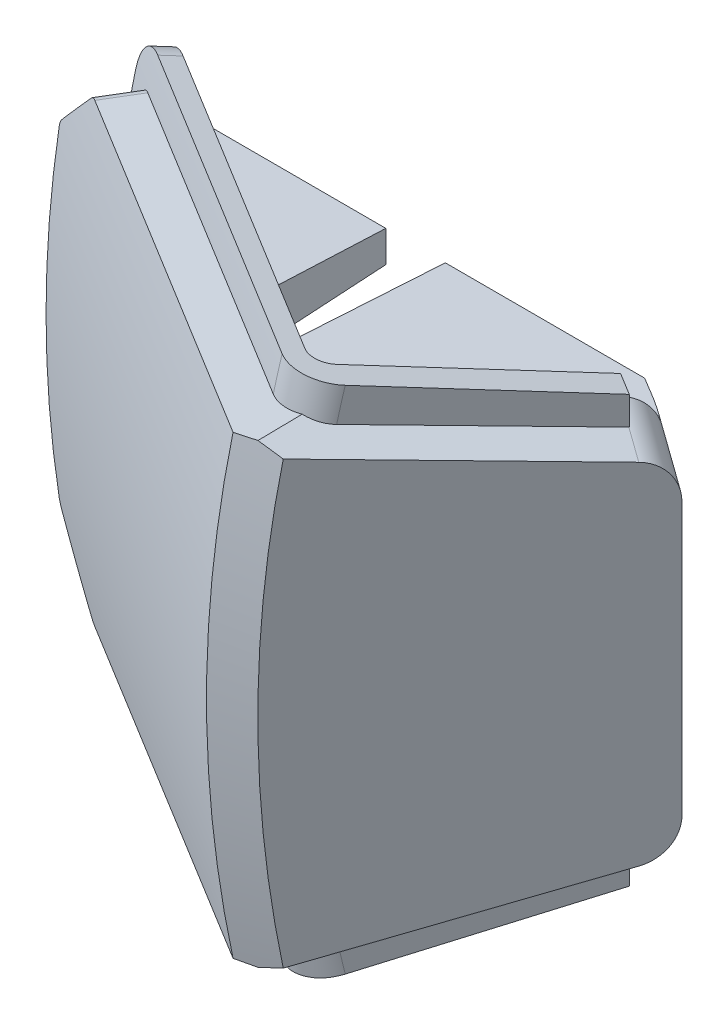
ISO-10303-21;
HEADER;
FILE_DESCRIPTION(('STEP AP214'),'2;1');
FILE_NAME('part.step','',(''),(''),'','','');
FILE_SCHEMA(('AUTOMOTIVE_DESIGN { 1 0 10303 214 1 1 1 1 }'));
ENDSEC;
DATA;
#1=APPLICATION_CONTEXT('core data for automotive mechanical design processes');
#2=APPLICATION_PROTOCOL_DEFINITION('international standard','automotive_design',2000,#1);
#3=PRODUCT_CONTEXT('',#1,'mechanical');
#4=PRODUCT('Part','Part','',(#3));
#5=PRODUCT_RELATED_PRODUCT_CATEGORY('part','',(#4));
#6=PRODUCT_DEFINITION_FORMATION('','',#4);
#7=PRODUCT_DEFINITION_CONTEXT('part definition',#1,'design');
#8=PRODUCT_DEFINITION('design','',#6,#7);
#9=PRODUCT_DEFINITION_SHAPE('','',#8);
#10=(LENGTH_UNIT() NAMED_UNIT(*) SI_UNIT(.MILLI.,.METRE.));
#11=(NAMED_UNIT(*) PLANE_ANGLE_UNIT() SI_UNIT($,.RADIAN.));
#12=(NAMED_UNIT(*) SI_UNIT($,.STERADIAN.) SOLID_ANGLE_UNIT());
#13=UNCERTAINTY_MEASURE_WITH_UNIT(LENGTH_MEASURE(1.E-05),#10,'distance_accuracy_value','');
#14=(GEOMETRIC_REPRESENTATION_CONTEXT(3) GLOBAL_UNCERTAINTY_ASSIGNED_CONTEXT((#13)) GLOBAL_UNIT_ASSIGNED_CONTEXT((#10,
#11,#12)) REPRESENTATION_CONTEXT('',''));
#15=CARTESIAN_POINT('',(0.,0.,0.));
#16=DIRECTION('',(0.,0.,1.));
#17=DIRECTION('',(1.,0.,0.));
#18=AXIS2_PLACEMENT_3D('',#15,#16,#17);
#19=CARTESIAN_POINT('',(2.304700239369,-62.30740122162,2.140921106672));
#20=DIRECTION('',(0.999961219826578,-0.00118592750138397,-0.0087265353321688));
#21=DIRECTION('',(-0.00872654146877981,0.,-0.999961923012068));
#22=AXIS2_PLACEMENT_3D('',#19,#20,#21);
#23=PLANE('',#22);
#24=DIRECTION('',(0.00865281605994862,-0.0521542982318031,0.998601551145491));
#25=VECTOR('',#24,1.);
#26=CARTESIAN_POINT('',(2.28592886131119,-62.724840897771,0.0466653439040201));
#27=LINE('',#26,#25);
#28=CARTESIAN_POINT('',(2.28552451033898,-62.7224036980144,1.30491124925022E-07));
#29=VERTEX_POINT('',#28);
#30=CARTESIAN_POINT('',(2.32378703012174,-62.9530286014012,4.41578931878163));
#31=VERTEX_POINT('',#30);
#32=EDGE_CURVE('E383',#29,#31,#27,.T.);
#33=ORIENTED_EDGE('',*,*,#32,.F.);
#34=DIRECTION('',(0.00118597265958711,0.999999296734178,0.));
#35=VECTOR('',#34,1.);
#36=CARTESIAN_POINT('',(2.25166634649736,-91.2712396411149,0.));
#37=LINE('',#36,#35);
#38=CARTESIAN_POINT('',(2.28651715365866,-61.8854166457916,0.));
#39=VERTEX_POINT('',#38);
#40=EDGE_CURVE('E1021',#29,#39,#37,.T.);
#41=ORIENTED_EDGE('',*,*,#40,.T.);
#42=DIRECTION('',(-0.00877663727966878,-0.0523234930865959,-0.998591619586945));
#43=VECTOR('',#42,1.);
#44=CARTESIAN_POINT('',(2.29095907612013,-61.858935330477,0.50539476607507));
#45=LINE('',#44,#43);
#46=CARTESIAN_POINT('',(2.32377871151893,-61.6632255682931,4.24049070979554));
#47=VERTEX_POINT('',#46);
#48=EDGE_CURVE('E367',#47,#39,#45,.T.);
#49=ORIENTED_EDGE('',*,*,#48,.F.);
#50=CARTESIAN_POINT('',(1.96655386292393,-66.27944113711,-36.066992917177));
#51=DIRECTION('',(0.999961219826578,-0.00118592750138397,-0.0087265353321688));
#52=DIRECTION('',(0.00872877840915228,0.0018995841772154,0.999960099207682));
#53=AXIS2_PLACEMENT_3D('',#50,#51,#52);
#54=ELLIPSE('',#53,40.6714137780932,34.5);
#55=EDGE_CURVE('E379',#47,#31,#54,.T.);
#56=ORIENTED_EDGE('',*,*,#55,.T.);
#57=EDGE_LOOP('',(#33,#41,#49,#56));
#58=FACE_BOUND('',#57,.T.);
#59=ADVANCED_FACE('F17',(#58),#23,.T.);
#60=CARTESIAN_POINT('',(9.167078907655,-91.27944113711,0.));
#61=DIRECTION('',(0.,0.,1.));
#62=DIRECTION('',(1.,0.,0.));
#63=AXIS2_PLACEMENT_3D('',#60,#61,#62);
#64=PLANE('',#63);
#65=ORIENTED_EDGE('',*,*,#40,.F.);
#66=DIRECTION('',(0.999750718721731,0.022327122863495,1.4062884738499E-07));
#67=VECTOR('',#66,1.);
#68=CARTESIAN_POINT('',(-2.15433248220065,-62.8215576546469,-3.63545404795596E-07));
#69=LINE('',#68,#67);
#70=CARTESIAN_POINT('',(-2.15436644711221,-62.8215584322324,0.));
#71=VERTEX_POINT('',#70);
#72=EDGE_CURVE('E386',#71,#29,#69,.T.);
#73=ORIENTED_EDGE('',*,*,#72,.F.);
#74=DIRECTION('',(0.72348125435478,0.690344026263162,0.));
#75=VECTOR('',#74,1.);
#76=CARTESIAN_POINT('',(-2.62662809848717,-63.2721893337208,0.));
#77=LINE('',#76,#75);
#78=CARTESIAN_POINT('',(-2.32377633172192,-62.9831927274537,-3.63408841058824E-08));
#79=VERTEX_POINT('',#78);
#80=EDGE_CURVE('E378',#79,#71,#77,.T.);
#81=ORIENTED_EDGE('',*,*,#80,.F.);
#82=DIRECTION('',(0.,1.,0.));
#83=VECTOR('',#82,1.);
#84=CARTESIAN_POINT('',(-2.32378700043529,-66.27944113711,-4.84879358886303E-08));
#85=LINE('',#84,#83);
#86=CARTESIAN_POINT('',(-2.32378698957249,-61.8798939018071,-6.62305197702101E-08));
#87=VERTEX_POINT('',#86);
#88=EDGE_CURVE('E358',#87,#79,#85,.F.);
#89=ORIENTED_EDGE('',*,*,#88,.F.);
#90=DIRECTION('',(-0.99999928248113,0.00119793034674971,3.30061529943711E-07));
#91=VECTOR('',#90,1.);
#92=CARTESIAN_POINT('',(2.28642238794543,-61.8854166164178,-1.60562695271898E-06));
#93=LINE('',#92,#91);
#94=EDGE_CURVE('E375',#39,#87,#93,.T.);
#95=ORIENTED_EDGE('',*,*,#94,.F.);
#96=EDGE_LOOP('',(#65,#73,#81,#89,#95));
#97=FACE_BOUND('',#96,.T.);
#98=ADVANCED_FACE('F374',(#97),#64,.F.);
#99=CARTESIAN_POINT('',(2.304700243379,-70.25148106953,2.14092156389));
#100=DIRECTION('',(0.999961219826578,0.00118592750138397,-0.0087265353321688));
#101=DIRECTION('',(-0.00872654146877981,0.,-0.999961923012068));
#102=AXIS2_PLACEMENT_3D('',#99,#100,#101);
#103=PLANE('',#102);
#104=DIRECTION('',(-0.00865281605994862,-0.0521542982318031,-0.998601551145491));
#105=VECTOR('',#104,1.);
#106=CARTESIAN_POINT('',(2.28600117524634,-69.833605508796,0.0550109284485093));
#107=LINE('',#106,#105);
#108=CARTESIAN_POINT('',(2.3237870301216,-69.6058536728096,4.41578931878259));
#109=VERTEX_POINT('',#108);
#110=CARTESIAN_POINT('',(2.28552450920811,-69.8364785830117,0.));
#111=VERTEX_POINT('',#110);
#112=EDGE_CURVE('E1014',#109,#111,#107,.T.);
#113=ORIENTED_EDGE('',*,*,#112,.F.);
#114=CARTESIAN_POINT('',(1.96655386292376,-66.27944113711,-36.0669929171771));
#115=DIRECTION('',(0.999961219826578,0.00118592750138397,-0.0087265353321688));
#116=DIRECTION('',(0.00872877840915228,-0.0018995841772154,0.999960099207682));
#117=AXIS2_PLACEMENT_3D('',#114,#115,#116);
#118=ELLIPSE('',#117,40.6714137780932,34.5);
#119=CARTESIAN_POINT('',(2.32377877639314,-70.895656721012,4.24049079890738));
#120=VERTEX_POINT('',#119);
#121=EDGE_CURVE('E1022',#109,#120,#118,.T.);
#122=ORIENTED_EDGE('',*,*,#121,.T.);
#123=DIRECTION('',(-0.00877663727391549,0.0523234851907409,-0.998591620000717));
#124=VECTOR('',#123,1.);
#125=CARTESIAN_POINT('',(2.32378684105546,-70.8956555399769,4.24048485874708));
#126=LINE('',#125,#124);
#127=CARTESIAN_POINT('',(2.28651715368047,-70.673465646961,0.));
#128=VERTEX_POINT('',#127);
#129=EDGE_CURVE('E1006',#120,#128,#126,.T.);
#130=ORIENTED_EDGE('',*,*,#129,.T.);
#131=DIRECTION('',(-0.00118597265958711,0.999999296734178,0.));
#132=VECTOR('',#131,1.);
#133=CARTESIAN_POINT('',(2.31096493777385,-91.2875723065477,0.));
#134=LINE('',#133,#132);
#135=EDGE_CURVE('E1146',#128,#111,#134,.T.);
#136=ORIENTED_EDGE('',*,*,#135,.T.);
#137=EDGE_LOOP('',(#113,#122,#130,#136));
#138=FACE_BOUND('',#137,.T.);
#139=ADVANCED_FACE('F705',(#138),#103,.T.);
#140=CARTESIAN_POINT('',(9.167078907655,-91.27944113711,0.));
#141=DIRECTION('',(0.,0.,1.));
#142=DIRECTION('',(1.,0.,0.));
#143=AXIS2_PLACEMENT_3D('',#140,#141,#142);
#144=PLANE('',#143);
#145=ORIENTED_EDGE('',*,*,#135,.F.);
#146=DIRECTION('',(-0.999999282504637,-0.0011979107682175,-4.35194107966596E-08));
#147=VECTOR('',#146,1.);
#148=CARTESIAN_POINT('',(2.28643816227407,-70.6734656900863,-6.29049389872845E-07));
#149=LINE('',#148,#147);
#150=CARTESIAN_POINT('',(-2.32378677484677,-70.6789884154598,-4.1591558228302E-07));
#151=VERTEX_POINT('',#150);
#152=EDGE_CURVE('E391',#128,#151,#149,.T.);
#153=ORIENTED_EDGE('',*,*,#152,.T.);
#154=DIRECTION('',(0.,-1.,0.));
#155=VECTOR('',#154,1.);
#156=CARTESIAN_POINT('',(-2.32378703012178,-91.27944113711,0.));
#157=LINE('',#156,#155);
#158=CARTESIAN_POINT('',(-2.32377229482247,-69.5756927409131,-4.65376491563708E-06));
#159=VERTEX_POINT('',#158);
#160=EDGE_CURVE('E1148',#159,#151,#157,.T.);
#161=ORIENTED_EDGE('',*,*,#160,.F.);
#162=DIRECTION('',(-0.723481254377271,0.690344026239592,0.));
#163=VECTOR('',#162,1.);
#164=CARTESIAN_POINT('',(14.5307937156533,-85.6582624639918,0.));
#165=LINE('',#164,#163);
#166=CARTESIAN_POINT('',(-2.1543664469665,-69.7373238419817,0.));
#167=VERTEX_POINT('',#166);
#168=EDGE_CURVE('E1025',#167,#159,#165,.T.);
#169=ORIENTED_EDGE('',*,*,#168,.F.);
#170=DIRECTION('',(-0.999750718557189,0.022327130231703,0.));
#171=VECTOR('',#170,1.);
#172=CARTESIAN_POINT('',(9.64228891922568,-70.00077497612,0.));
#173=LINE('',#172,#171);
#174=EDGE_CURVE('E1009',#111,#167,#173,.T.);
#175=ORIENTED_EDGE('',*,*,#174,.F.);
#176=EDGE_LOOP('',(#145,#153,#161,#169,#175));
#177=FACE_BOUND('',#176,.T.);
#178=ADVANCED_FACE('F708',(#177),#144,.F.);
#179=CARTESIAN_POINT('',(3.846856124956,-70.26716970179,2.600129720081));
#180=DIRECTION('',(0.999961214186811,-0.00119067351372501,0.00872653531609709));
#181=DIRECTION('',(0.00872654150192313,0.,-0.999961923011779));
#182=AXIS2_PLACEMENT_3D('',#179,#180,#181);
#183=PLANE('',#182);
#184=DIRECTION('',(-0.00877690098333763,-0.0523444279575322,0.998590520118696));
#185=VECTOR('',#184,1.);
#186=CARTESIAN_POINT('',(3.86906560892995,-70.6715745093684,-1.46971671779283E-06));
#187=LINE('',#186,#185);
#188=CARTESIAN_POINT('',(3.86906559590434,-70.6715746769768,0.));
#189=VERTEX_POINT('',#188);
#190=CARTESIAN_POINT('',(3.82378703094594,-70.9416107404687,5.1515615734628));
#191=VERTEX_POINT('',#190);
#192=EDGE_CURVE('E1001',#189,#191,#187,.T.);
#193=ORIENTED_EDGE('',*,*,#192,.T.);
#194=CARTESIAN_POINT('',(4.17723585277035,-66.27944113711,-34.7135141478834));
#195=DIRECTION('',(0.999961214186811,-0.00119067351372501,0.00872653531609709));
#196=DIRECTION('',(-0.00872416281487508,0.00198342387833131,0.999959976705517));
#197=AXIS2_PLACEMENT_3D('',#194,#195,#196);
#198=ELLIPSE('',#197,40.23911037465,34.5);
#199=CARTESIAN_POINT('',(3.82378703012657,-69.5911236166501,5.33582600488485));
#200=VERTEX_POINT('',#199);
#201=EDGE_CURVE('E1144',#200,#191,#198,.T.);
#202=ORIENTED_EDGE('',*,*,#201,.F.);
#203=DIRECTION('',(-0.00865193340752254,0.0525397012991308,0.998581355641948));
#204=VECTOR('',#203,1.);
#205=CARTESIAN_POINT('',(3.84773155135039,-69.73652903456,2.57221799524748));
#206=LINE('',#205,#204);
#207=CARTESIAN_POINT('',(3.87001782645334,-69.8718645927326,0.));
#208=VERTEX_POINT('',#207);
#209=EDGE_CURVE('E647',#208,#200,#206,.T.);
#210=ORIENTED_EDGE('',*,*,#209,.F.);
#211=DIRECTION('',(-0.00119071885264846,-0.999999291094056,0.));
#212=VECTOR('',#211,1.);
#213=CARTESIAN_POINT('',(3.8695470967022,-70.267196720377,0.));
#214=LINE('',#213,#212);
#215=EDGE_CURVE('E1139',#208,#189,#214,.T.);
#216=ORIENTED_EDGE('',*,*,#215,.T.);
#217=EDGE_LOOP('',(#193,#202,#210,#216));
#218=FACE_BOUND('',#217,.T.);
#219=ADVANCED_FACE('F712',(#218),#183,.F.);
#220=CARTESIAN_POINT('',(9.167078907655,-91.27944113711,0.));
#221=DIRECTION('',(0.,0.,1.));
#222=DIRECTION('',(1.,0.,0.));
#223=AXIS2_PLACEMENT_3D('',#220,#221,#222);
#224=PLANE('',#223);
#225=DIRECTION('',(-0.999750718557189,0.022327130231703,0.));
#226=VECTOR('',#225,1.);
#227=CARTESIAN_POINT('',(9.64228891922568,-70.00077497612,0.));
#228=LINE('',#227,#226);
#229=CARTESIAN_POINT('',(9.16707890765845,-69.9901622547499,0.));
#230=VERTEX_POINT('',#229);
#231=EDGE_CURVE('E641',#230,#208,#228,.T.);
#232=ORIENTED_EDGE('',*,*,#231,.F.);
#233=DIRECTION('',(0.,1.,0.));
#234=VECTOR('',#233,1.);
#235=CARTESIAN_POINT('',(9.16707890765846,-91.27944113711,0.));
#236=LINE('',#235,#234);
#237=CARTESIAN_POINT('',(9.16707897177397,-70.6652703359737,3.13818300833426E-08));
#238=VERTEX_POINT('',#237);
#239=EDGE_CURVE('E1142',#238,#230,#236,.T.);
#240=ORIENTED_EDGE('',*,*,#239,.F.);
#241=DIRECTION('',(-0.999999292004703,-0.00118995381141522,-1.3484748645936E-07));
#242=VECTOR('',#241,1.);
#243=CARTESIAN_POINT('',(9.16707903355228,-70.6652703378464,6.65810985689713E-08));
#244=LINE('',#243,#242);
#245=EDGE_CURVE('E995',#238,#189,#244,.T.);
#246=ORIENTED_EDGE('',*,*,#245,.T.);
#247=ORIENTED_EDGE('',*,*,#215,.F.);
#248=EDGE_LOOP('',(#232,#240,#246,#247));
#249=FACE_BOUND('',#248,.T.);
#250=ADVANCED_FACE('F716',(#249),#224,.F.);
#251=CARTESIAN_POINT('',(7.849819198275,-65.77944113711,3.603975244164));
#252=DIRECTION('',(0.80409723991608,0.,0.594497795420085));
#253=DIRECTION('',(0.594497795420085,0.,-0.80409723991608));
#254=AXIS2_PLACEMENT_3D('',#251,#252,#253);
#255=PLANE('',#254);
#256=DIRECTION('',(0.,1.,0.));
#257=VECTOR('',#256,1.);
#258=CARTESIAN_POINT('',(9.497776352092,-65.77944113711,1.375005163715));
#259=LINE('',#258,#257);
#260=CARTESIAN_POINT('',(9.49777635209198,-65.8459167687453,1.37500516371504));
#261=VERTEX_POINT('',#260);
#262=CARTESIAN_POINT('',(9.49777635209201,-66.7129655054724,1.37500516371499));
#263=VERTEX_POINT('',#262);
#264=EDGE_CURVE('E982',#261,#263,#259,.F.);
#265=ORIENTED_EDGE('',*,*,#264,.T.);
#266=DIRECTION('',(0.594466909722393,0.0101932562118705,-0.804055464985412));
#267=VECTOR('',#266,1.);
#268=CARTESIAN_POINT('',(7.84981919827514,-66.7412228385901,3.6039752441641));
#269=LINE('',#268,#267);
#270=CARTESIAN_POINT('',(7.8498191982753,-66.7412228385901,3.60397524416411));
#271=VERTEX_POINT('',#270);
#272=EDGE_CURVE('E985',#271,#263,#269,.T.);
#273=ORIENTED_EDGE('',*,*,#272,.F.);
#274=DIRECTION('',(0.,-1.,0.));
#275=VECTOR('',#274,1.);
#276=CARTESIAN_POINT('',(7.84981919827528,-65.77944113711,3.6039752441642));
#277=LINE('',#276,#275);
#278=CARTESIAN_POINT('',(7.84981919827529,-65.8176594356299,3.60397524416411));
#279=VERTEX_POINT('',#278);
#280=EDGE_CURVE('E1141',#271,#279,#277,.F.);
#281=ORIENTED_EDGE('',*,*,#280,.T.);
#282=DIRECTION('',(-0.594466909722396,0.0101932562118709,0.80405546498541));
#283=VECTOR('',#282,1.);
#284=CARTESIAN_POINT('',(9.49777635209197,-65.8459167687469,1.37500516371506));
#285=LINE('',#284,#283);
#286=EDGE_CURVE('E967',#261,#279,#285,.T.);
#287=ORIENTED_EDGE('',*,*,#286,.F.);
#288=EDGE_LOOP('',(#265,#273,#281,#287));
#289=FACE_BOUND('',#288,.T.);
#290=ADVANCED_FACE('F720',(#289),#255,.F.);
#291=CARTESIAN_POINT('',(5.437527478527,-65.77944113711,1.820481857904));
#292=DIRECTION('',(0.,-1.,0.));
#293=DIRECTION('',(0.,0.,-1.));
#294=AXIS2_PLACEMENT_3D('',#291,#292,#293);
#295=CYLINDRICAL_SURFACE('',#294,3.);
#296=ORIENTED_EDGE('',*,*,#280,.F.);
#297=CARTESIAN_POINT('',(5.437527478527,-66.7385473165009,1.820481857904));
#298=DIRECTION('',(0.00534277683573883,-0.999947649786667,-0.00872653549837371));
#299=DIRECTION('',(-0.522126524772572,-0.0102321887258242,0.852806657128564));
#300=AXIS2_PLACEMENT_3D('',#297,#298,#299);
#301=ELLIPSE('',#300,3.00015705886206,3.);
#302=CARTESIAN_POINT('',(3.87106589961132,-66.7692454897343,4.37903577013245));
#303=VERTEX_POINT('',#302);
#304=EDGE_CURVE('E636',#303,#271,#301,.F.);
#305=ORIENTED_EDGE('',*,*,#304,.F.);
#306=DIRECTION('',(0.,1.,0.));
#307=VECTOR('',#306,1.);
#308=CARTESIAN_POINT('',(3.87106589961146,-65.77944113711,4.37903577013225));
#309=LINE('',#308,#307);
#310=CARTESIAN_POINT('',(3.87106589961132,-65.7896367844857,4.37903577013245));
#311=VERTEX_POINT('',#310);
#312=EDGE_CURVE('E1138',#303,#311,#309,.T.);
#313=ORIENTED_EDGE('',*,*,#312,.T.);
#314=CARTESIAN_POINT('',(5.437527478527,-65.8203349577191,1.820481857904));
#315=DIRECTION('',(0.00534277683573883,0.999947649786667,-0.00872653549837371));
#316=DIRECTION('',(0.522126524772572,-0.0102321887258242,-0.852806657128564));
#317=AXIS2_PLACEMENT_3D('',#314,#315,#316);
#318=ELLIPSE('',#317,3.00015705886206,3.);
#319=EDGE_CURVE('E611',#279,#311,#318,.F.);
#320=ORIENTED_EDGE('',*,*,#319,.F.);
#321=EDGE_LOOP('',(#296,#305,#313,#320));
#322=FACE_BOUND('',#321,.T.);
#323=ADVANCED_FACE('F724',(#322),#295,.F.);
#324=CARTESIAN_POINT('',(0.2295453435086,-65.77944113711,2.149533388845));
#325=DIRECTION('',(-0.522153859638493,0.,0.852851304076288));
#326=DIRECTION('',(0.852851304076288,0.,0.522153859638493));
#327=AXIS2_PLACEMENT_3D('',#324,#325,#326);
#328=PLANE('',#327);
#329=ORIENTED_EDGE('',*,*,#312,.F.);
#330=DIRECTION('',(0.852851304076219,0.,0.522153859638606));
#331=VECTOR('',#330,1.);
#332=CARTESIAN_POINT('',(0.229545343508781,-66.7692454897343,2.14953338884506));
#333=LINE('',#332,#331);
#334=CARTESIAN_POINT('',(0.229545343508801,-66.7692454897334,2.14953338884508));
#335=VERTEX_POINT('',#334);
#336=EDGE_CURVE('E990',#335,#303,#333,.T.);
#337=ORIENTED_EDGE('',*,*,#336,.F.);
#338=DIRECTION('',(0.,1.,0.));
#339=VECTOR('',#338,1.);
#340=CARTESIAN_POINT('',(0.229545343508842,-65.77944113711,2.14953338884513));
#341=LINE('',#340,#339);
#342=CARTESIAN_POINT('',(0.22954534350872,-65.7896367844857,2.1495333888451));
#343=VERTEX_POINT('',#342);
#344=EDGE_CURVE('E1127',#335,#343,#341,.T.);
#345=ORIENTED_EDGE('',*,*,#344,.T.);
#346=DIRECTION('',(-0.852851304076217,0.,-0.52215385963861));
#347=VECTOR('',#346,1.);
#348=CARTESIAN_POINT('',(3.87106589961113,-65.7896367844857,4.37903577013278));
#349=LINE('',#348,#347);
#350=EDGE_CURVE('E610',#311,#343,#349,.T.);
#351=ORIENTED_EDGE('',*,*,#350,.F.);
#352=EDGE_LOOP('',(#329,#337,#345,#351));
#353=FACE_BOUND('',#352,.T.);
#354=ADVANCED_FACE('F728',(#353),#328,.F.);
#355=CARTESIAN_POINT('',(3.846856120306,-62.29171255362,2.600130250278));
#356=DIRECTION('',(0.999961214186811,0.00119067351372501,0.00872653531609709));
#357=DIRECTION('',(0.00872654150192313,0.,-0.999961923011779));
#358=AXIS2_PLACEMENT_3D('',#355,#356,#357);
#359=PLANE('',#358);
#360=DIRECTION('',(-0.00877690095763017,0.0523443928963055,0.998590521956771));
#361=VECTOR('',#360,1.);
#362=CARTESIAN_POINT('',(3.84646075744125,-61.7524949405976,2.57186191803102));
#363=LINE('',#362,#361);
#364=CARTESIAN_POINT('',(3.86906559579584,-61.8873075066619,0.));
#365=VERTEX_POINT('',#364);
#366=CARTESIAN_POINT('',(3.82378702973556,-61.617271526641,5.15156171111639));
#367=VERTEX_POINT('',#366);
#368=EDGE_CURVE('E396',#365,#367,#363,.T.);
#369=ORIENTED_EDGE('',*,*,#368,.F.);
#370=DIRECTION('',(0.00119071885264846,-0.999999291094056,0.));
#371=VECTOR('',#370,1.);
#372=CARTESIAN_POINT('',(3.86954709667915,-62.2916855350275,0.));
#373=LINE('',#372,#371);
#374=CARTESIAN_POINT('',(3.87001782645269,-62.6870176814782,0.));
#375=VERTEX_POINT('',#374);
#376=EDGE_CURVE('E1130',#365,#375,#373,.T.);
#377=ORIENTED_EDGE('',*,*,#376,.T.);
#378=DIRECTION('',(0.00865193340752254,0.0525397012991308,-0.998581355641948));
#379=VECTOR('',#378,1.);
#380=CARTESIAN_POINT('',(3.84773154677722,-62.8223532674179,2.572218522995));
#381=LINE('',#380,#379);
#382=CARTESIAN_POINT('',(3.82378703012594,-62.9677586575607,5.33582600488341));
#383=VERTEX_POINT('',#382);
#384=EDGE_CURVE('E576',#383,#375,#381,.T.);
#385=ORIENTED_EDGE('',*,*,#384,.F.);
#386=CARTESIAN_POINT('',(4.17723585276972,-66.27944113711,-34.7135141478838));
#387=DIRECTION('',(0.999961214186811,0.00119067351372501,0.00872653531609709));
#388=DIRECTION('',(-0.00872416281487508,-0.00198342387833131,0.999959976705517));
#389=AXIS2_PLACEMENT_3D('',#386,#387,#388);
#390=ELLIPSE('',#389,40.23911037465,34.5);
#391=EDGE_CURVE('E1136',#367,#383,#390,.T.);
#392=ORIENTED_EDGE('',*,*,#391,.F.);
#393=EDGE_LOOP('',(#369,#377,#385,#392));
#394=FACE_BOUND('',#393,.T.);
#395=ADVANCED_FACE('F732',(#394),#359,.F.);
#396=CARTESIAN_POINT('',(9.167078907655,-91.27944113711,0.));
#397=DIRECTION('',(0.,0.,1.));
#398=DIRECTION('',(1.,0.,0.));
#399=AXIS2_PLACEMENT_3D('',#396,#397,#398);
#400=PLANE('',#399);
#401=ORIENTED_EDGE('',*,*,#376,.F.);
#402=DIRECTION('',(-0.999999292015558,0.00118994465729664,-3.09575035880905E-07));
#403=VECTOR('',#402,1.);
#404=CARTESIAN_POINT('',(9.16707903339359,-61.8936119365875,6.2548527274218E-08));
#405=LINE('',#404,#403);
#406=CARTESIAN_POINT('',(9.16707897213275,-61.8936119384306,2.86499336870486E-08));
#407=VERTEX_POINT('',#406);
#408=EDGE_CURVE('E393',#407,#365,#405,.T.);
#409=ORIENTED_EDGE('',*,*,#408,.F.);
#410=DIRECTION('',(0.,1.,0.));
#411=VECTOR('',#410,1.);
#412=CARTESIAN_POINT('',(9.16707890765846,-91.27944113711,0.));
#413=LINE('',#412,#411);
#414=CARTESIAN_POINT('',(9.16707890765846,-62.568720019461,0.));
#415=VERTEX_POINT('',#414);
#416=EDGE_CURVE('E1134',#415,#407,#413,.T.);
#417=ORIENTED_EDGE('',*,*,#416,.F.);
#418=DIRECTION('',(0.999750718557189,0.022327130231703,0.));
#419=VECTOR('',#418,1.);
#420=CARTESIAN_POINT('',(8.52621069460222,-62.58303233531,0.));
#421=LINE('',#420,#419);
#422=EDGE_CURVE('E573',#375,#415,#421,.T.);
#423=ORIENTED_EDGE('',*,*,#422,.F.);
#424=EDGE_LOOP('',(#401,#409,#417,#423));
#425=FACE_BOUND('',#424,.T.);
#426=ADVANCED_FACE('F735',(#425),#400,.F.);
#427=CARTESIAN_POINT('',(-0.5245040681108,-65.77944113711,3.381147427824));
#428=DIRECTION('',(0.852851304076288,0.,0.522153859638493));
#429=DIRECTION('',(0.522153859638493,0.,-0.852851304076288));
#430=AXIS2_PLACEMENT_3D('',#427,#428,#429);
#431=PLANE('',#430);
#432=DIRECTION('',(0.52212652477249,0.0102321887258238,-0.852806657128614));
#433=VECTOR('',#432,1.);
#434=CARTESIAN_POINT('',(-0.290716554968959,-66.77944113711,2.99929448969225));
#435=LINE('',#434,#433);
#436=CARTESIAN_POINT('',(-0.290716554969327,-66.7794411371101,2.99929448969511));
#437=VERTEX_POINT('',#436);
#438=EDGE_CURVE('E634',#437,#335,#435,.T.);
#439=ORIENTED_EDGE('',*,*,#438,.F.);
#440=CARTESIAN_POINT('',(17.7216996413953,-66.27944113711,-26.4209852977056));
#441=DIRECTION('',(0.852851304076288,0.,0.522153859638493));
#442=DIRECTION('',(0.522153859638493,0.,-0.852851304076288));
#443=AXIS2_PLACEMENT_3D('',#440,#441,#442);
#444=CIRCLE('',#443,34.5);
#445=CARTESIAN_POINT('',(-0.290716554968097,-65.7794411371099,2.99929448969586));
#446=VERTEX_POINT('',#445);
#447=EDGE_CURVE('E533',#437,#446,#444,.F.);
#448=ORIENTED_EDGE('',*,*,#447,.T.);
#449=DIRECTION('',(-0.522126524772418,0.0102321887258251,0.852806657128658));
#450=VECTOR('',#449,1.);
#451=CARTESIAN_POINT('',(0.229545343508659,-65.7896367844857,2.14953338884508));
#452=LINE('',#451,#450);
#453=EDGE_CURVE('E534',#343,#446,#452,.T.);
#454=ORIENTED_EDGE('',*,*,#453,.F.);
#455=ORIENTED_EDGE('',*,*,#344,.F.);
#456=EDGE_LOOP('',(#439,#448,#454,#455));
#457=FACE_BOUND('',#456,.T.);
#458=ADVANCED_FACE('F685',(#457),#431,.F.);
#459=CARTESIAN_POINT('',(7.141902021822,-61.68712629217,3.893994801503));
#460=DIRECTION('',(0.00118833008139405,0.998628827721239,-0.0523359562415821));
#461=DIRECTION('',(0.,0.0523359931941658,0.998629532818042));
#462=AXIS2_PLACEMENT_3D('',#459,#460,#461);
#463=PLANE('',#462);
#464=ORIENTED_EDGE('',*,*,#368,.T.);
#465=CARTESIAN_POINT('',(-79.0849805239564,-66.27944113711,-85.690381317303));
#466=DIRECTION('',(0.00118833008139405,0.998628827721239,-0.0523359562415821));
#467=DIRECTION('',(0.853178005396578,0.026286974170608,0.520957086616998));
#468=AXIS2_PLACEMENT_3D('',#465,#466,#467);
#469=ELLIPSE('',#468,1311.09151128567,34.5);
#470=CARTESIAN_POINT('',(6.27440958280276,-61.5421903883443,6.63983752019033));
#471=VERTEX_POINT('',#470);
#472=EDGE_CURVE('E962',#367,#471,#469,.T.);
#473=ORIENTED_EDGE('',*,*,#472,.T.);
#474=CARTESIAN_POINT('',(6.27440962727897,-61.5421904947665,6.63983744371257));
#475=CARTESIAN_POINT('',(6.29841418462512,-61.5414535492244,6.65444298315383));
#476=CARTESIAN_POINT('',(6.32367148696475,-61.5408268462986,6.66697415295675));
#477=CARTESIAN_POINT('',(6.37590590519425,-61.5398065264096,6.68762865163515));
#478=CARTESIAN_POINT('',(6.40288134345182,-61.5394126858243,6.6957562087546));
#479=CARTESIAN_POINT('',(6.45782614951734,-61.5388691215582,6.70737569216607));
#480=CARTESIAN_POINT('',(6.48579589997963,-61.5387194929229,6.71086581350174));
#481=CARTESIAN_POINT('',(6.54192110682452,-61.5386679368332,6.71312390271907));
#482=CARTESIAN_POINT('',(6.57007654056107,-61.53876597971,6.71189243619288));
#483=CARTESIAN_POINT('',(6.62587077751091,-61.5392071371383,6.70474151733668));
#484=CARTESIAN_POINT('',(6.65350774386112,-61.5395509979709,6.69880778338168));
#485=CARTESIAN_POINT('',(6.70740528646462,-61.5404745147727,6.68240983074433));
#486=CARTESIAN_POINT('',(6.73366557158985,-61.5410542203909,6.67194465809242));
#487=CARTESIAN_POINT('',(6.7841822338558,-61.542435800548,6.64672957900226));
#488=CARTESIAN_POINT('',(6.80842894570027,-61.5432386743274,6.631960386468));
#489=CARTESIAN_POINT('',(6.85409584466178,-61.5450425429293,6.59857745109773));
#490=CARTESIAN_POINT('',(6.87551762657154,-61.5460434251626,6.57996589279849));
#491=CARTESIAN_POINT('',(6.90823841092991,-61.5478455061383,6.54632311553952));
#492=CARTESIAN_POINT('',(6.92050688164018,-61.5485993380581,6.53221772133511));
#493=CARTESIAN_POINT('',(6.94338936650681,-61.5501704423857,6.50275885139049));
#494=CARTESIAN_POINT('',(6.95400570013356,-61.5509876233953,6.48740717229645));
#495=CARTESIAN_POINT('',(6.96373834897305,-61.551832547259,6.47150606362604));
#496=B_SPLINE_CURVE_WITH_KNOTS('',3,(#474,#475,#476,#477,#478,#479,#480,#481,#482,#483,#484,
#485,#486,#487,#488,#489,#490,#491,#492,#493,#494,#495),.UNSPECIFIED.,.F.,.F.,(4,2,2,2,2,2,2,2,
2,2,4),(0.,0.0842100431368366,0.168339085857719,0.252500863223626,0.336652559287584,
0.421060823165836,0.505486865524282,0.590297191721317,0.675059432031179,0.731080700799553,
0.7870225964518),.UNSPECIFIED.);
#497=CARTESIAN_POINT('',(6.96373833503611,-61.55183271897,6.471506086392));
#498=VERTEX_POINT('',#497);
#499=EDGE_CURVE('E368',#471,#498,#496,.T.);
#500=ORIENTED_EDGE('',*,*,#499,.T.);
#501=DIRECTION('',(-0.521618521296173,0.0452708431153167,0.851976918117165));
#502=VECTOR('',#501,1.);
#503=CARTESIAN_POINT('',(10.4200014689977,-61.8517991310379,0.826276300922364));
#504=LINE('',#503,#502);
#505=CARTESIAN_POINT('',(10.4200015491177,-61.8517993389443,0.826276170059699));
#506=VERTEX_POINT('',#505);
#507=EDGE_CURVE('E572',#506,#498,#504,.T.);
#508=ORIENTED_EDGE('',*,*,#507,.F.);
#509=CARTESIAN_POINT('',(9.01589105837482,-61.8368329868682,1.07997335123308));
#510=DIRECTION('',(0.00118833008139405,0.998628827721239,-0.0523359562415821));
#511=DIRECTION('',(-0.860794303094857,-0.02561500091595,-0.508308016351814));
#512=AXIS2_PLACEMENT_3D('',#509,#510,#511);
#513=ELLIPSE('',#512,3.00739558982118,1.);
#514=CARTESIAN_POINT('',(9.64847927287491,-61.8787383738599,0.294734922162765));
#515=VERTEX_POINT('',#514);
#516=EDGE_CURVE('E1123',#506,#515,#513,.T.);
#517=ORIENTED_EDGE('',*,*,#516,.T.);
#518=DIRECTION('',(-0.852555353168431,-0.0263409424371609,-0.521972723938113));
#519=VECTOR('',#518,1.);
#520=CARTESIAN_POINT('',(9.6484783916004,-61.878738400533,0.294734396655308));
#521=LINE('',#520,#519);
#522=EDGE_CURVE('E397',#515,#407,#521,.T.);
#523=ORIENTED_EDGE('',*,*,#522,.T.);
#524=ORIENTED_EDGE('',*,*,#408,.T.);
#525=EDGE_LOOP('',(#464,#473,#500,#508,#517,#523,#524));
#526=FACE_BOUND('',#525,.T.);
#527=ADVANCED_FACE('F681',(#526),#463,.T.);
#528=CARTESIAN_POINT('',(24.1180844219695,-66.2794411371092,-22.5048313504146));
#529=DIRECTION('',(-0.852851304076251,0.,-0.522153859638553));
#530=DIRECTION('',(-0.522153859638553,0.,0.852851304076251));
#531=AXIS2_PLACEMENT_3D('',#528,#529,#530);
#532=TOROIDAL_SURFACE('',#531,33.999999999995,0.500000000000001);
#533=CARTESIAN_POINT('',(24.1180844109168,-66.27944113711,-22.5048313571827));
#534=DIRECTION('',(0.852851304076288,0.,0.522153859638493));
#535=DIRECTION('',(0.522153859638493,0.,-0.852851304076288));
#536=AXIS2_PLACEMENT_3D('',#533,#534,#535);
#537=CIRCLE('',#536,34.5);
#538=CARTESIAN_POINT('',(6.46541881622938,-59.4012473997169,6.32785579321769));
#539=VERTEX_POINT('',#538);
#540=EDGE_CURVE('E958',#471,#539,#537,.F.);
#541=ORIENTED_EDGE('',*,*,#540,.T.);
#542=CARTESIAN_POINT('',(6.72125455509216,-59.5009313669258,5.90999076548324));
#543=DIRECTION('',(-0.10410073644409,-0.979924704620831,0.170031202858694));
#544=DIRECTION('',(0.,-0.17096007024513,-0.985277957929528));
#545=AXIS2_PLACEMENT_3D('',#542,#543,#544);
#546=CIRCLE('',#545,0.500000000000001);
#547=CARTESIAN_POINT('',(7.14768020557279,-59.5009313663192,6.17106769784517));
#548=VERTEX_POINT('',#547);
#549=EDGE_CURVE('E693',#548,#539,#546,.T.);
#550=ORIENTED_EDGE('',*,*,#549,.F.);
#551=CARTESIAN_POINT('',(24.5445100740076,-66.2794411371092,-22.2437544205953));
#552=DIRECTION('',(-0.852851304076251,0.,-0.522153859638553));
#553=DIRECTION('',(-0.522153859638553,0.,0.852851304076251));
#554=AXIS2_PLACEMENT_3D('',#551,#552,#553);
#555=CIRCLE('',#554,34.0000000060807);
#556=EDGE_CURVE('E569',#498,#548,#555,.T.);
#557=ORIENTED_EDGE('',*,*,#556,.F.);
#558=ORIENTED_EDGE('',*,*,#499,.F.);
#559=EDGE_LOOP('',(#541,#550,#557,#558));
#560=FACE_BOUND('',#559,.T.);
#561=ADVANCED_FACE('F680',(#560),#532,.F.);
#562=CARTESIAN_POINT('',(-0.3159922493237,-61.85462347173,0.5280813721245));
#563=DIRECTION('',(0.00119627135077,0.998628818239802,-0.0523359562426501));
#564=DIRECTION('',(0.,0.0523359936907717,0.998629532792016));
#565=AXIS2_PLACEMENT_3D('',#562,#563,#564);
#566=PLANE('',#565);
#567=ORIENTED_EDGE('',*,*,#48,.T.);
#568=ORIENTED_EDGE('',*,*,#94,.T.);
#569=DIRECTION('',(-0.521618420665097,0.0452750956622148,0.851976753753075));
#570=VECTOR('',#569,1.);
#571=CARTESIAN_POINT('',(-2.01277435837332,-61.9068889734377,-0.507987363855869));
#572=LINE('',#571,#570);
#573=CARTESIAN_POINT('',(-2.9562330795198,-61.8249992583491,1.03299521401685));
#574=VERTEX_POINT('',#573);
#575=EDGE_CURVE('E353',#87,#574,#572,.T.);
#576=ORIENTED_EDGE('',*,*,#575,.T.);
#577=CARTESIAN_POINT('',(-79.1061769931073,-66.27944113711,-85.7033587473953));
#578=DIRECTION('',(0.00119627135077,0.998628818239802,-0.0523359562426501));
#579=DIRECTION('',(0.853178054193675,0.0262802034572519,0.520957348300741));
#580=AXIS2_PLACEMENT_3D('',#577,#578,#579);
#581=ELLIPSE('',#580,1311.42904870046,34.5);
#582=EDGE_CURVE('E961',#574,#47,#581,.T.);
#583=ORIENTED_EDGE('',*,*,#582,.T.);
#584=EDGE_LOOP('',(#567,#568,#576,#583));
#585=FACE_BOUND('',#584,.T.);
#586=ADVANCED_FACE('F381',(#585),#566,.T.);
#587=CARTESIAN_POINT('',(8.526210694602,-62.58303233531,0.));
#588=DIRECTION('',(0.0222965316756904,-0.998380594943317,-0.0523359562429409));
#589=DIRECTION('',(0.,0.052348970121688,-0.998628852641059));
#590=AXIS2_PLACEMENT_3D('',#587,#588,#589);
#591=PLANE('',#590);
#592=DIRECTION('',(-0.0214470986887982,0.0518592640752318,-0.998424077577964));
#593=VECTOR('',#592,1.);
#594=CARTESIAN_POINT('',(-2.14971891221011,-62.8327962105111,0.216356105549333));
#595=LINE('',#594,#593);
#596=CARTESIAN_POINT('',(-2.11803530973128,-62.9094074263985,1.69131885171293));
#597=VERTEX_POINT('',#596);
#598=EDGE_CURVE('E565',#597,#71,#595,.T.);
#599=ORIENTED_EDGE('',*,*,#598,.T.);
#600=ORIENTED_EDGE('',*,*,#72,.T.);
#601=ORIENTED_EDGE('',*,*,#32,.T.);
#602=CARTESIAN_POINT('',(559.305647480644,-66.27944113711,305.161023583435));
#603=DIRECTION('',(0.0222965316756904,-0.998380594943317,-0.0523359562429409));
#604=DIRECTION('',(0.853066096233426,-0.00829862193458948,0.52173687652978));
#605=AXIS2_PLACEMENT_3D('',#602,#603,#604);
#606=ELLIPSE('',#605,4150.72775471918,34.5);
#607=EDGE_CURVE('E1037',#31,#597,#606,.T.);
#608=ORIENTED_EDGE('',*,*,#607,.T.);
#609=EDGE_LOOP('',(#599,#600,#601,#608));
#610=FACE_BOUND('',#609,.T.);
#611=ADVANCED_FACE('F673',(#610),#591,.T.);
#612=CARTESIAN_POINT('',(9.642288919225,-70.00077497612,0.));
#613=DIRECTION('',(0.0222965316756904,0.998380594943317,-0.0523359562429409));
#614=DIRECTION('',(0.,0.052348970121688,0.998628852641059));
#615=AXIS2_PLACEMENT_3D('',#612,#613,#614);
#616=PLANE('',#615);
#617=DIRECTION('',(-0.0214470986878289,-0.0518592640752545,-0.998424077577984));
#618=VECTOR('',#617,1.);
#619=CARTESIAN_POINT('',(-2.14923326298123,-69.7249117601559,0.23896446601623));
#620=LINE('',#619,#618);
#621=CARTESIAN_POINT('',(-2.11803530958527,-69.6494748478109,1.69131885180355));
#622=VERTEX_POINT('',#621);
#623=EDGE_CURVE('E562',#622,#167,#620,.T.);
#624=ORIENTED_EDGE('',*,*,#623,.F.);
#625=CARTESIAN_POINT('',(559.305647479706,-66.27944113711,305.161023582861));
#626=DIRECTION('',(0.0222965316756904,0.998380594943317,-0.0523359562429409));
#627=DIRECTION('',(0.853066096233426,0.00829862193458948,0.52173687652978));
#628=AXIS2_PLACEMENT_3D('',#625,#626,#627);
#629=ELLIPSE('',#628,4150.72775471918,34.5);
#630=EDGE_CURVE('E1170',#622,#109,#629,.T.);
#631=ORIENTED_EDGE('',*,*,#630,.T.);
#632=ORIENTED_EDGE('',*,*,#112,.T.);
#633=ORIENTED_EDGE('',*,*,#174,.T.);
#634=EDGE_LOOP('',(#624,#631,#632,#633));
#635=FACE_BOUND('',#634,.T.);
#636=ADVANCED_FACE('F669',(#635),#616,.T.);
#637=CARTESIAN_POINT('',(-0.3159922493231,-70.70425880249,0.5280813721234));
#638=DIRECTION('',(-0.00119627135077,0.998628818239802,0.0523359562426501));
#639=DIRECTION('',(0.,-0.0523359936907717,0.998629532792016));
#640=AXIS2_PLACEMENT_3D('',#637,#638,#639);
#641=PLANE('',#640);
#642=DIRECTION('',(-0.521618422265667,-0.0452750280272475,0.851976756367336));
#643=VECTOR('',#642,1.);
#644=CARTESIAN_POINT('',(-2.32378552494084,-70.6789883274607,-2.45846220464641E-06));
#645=LINE('',#644,#643);
#646=CARTESIAN_POINT('',(-2.95623307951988,-70.7338830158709,1.03299521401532));
#647=VERTEX_POINT('',#646);
#648=EDGE_CURVE('E996',#151,#647,#645,.T.);
#649=ORIENTED_EDGE('',*,*,#648,.F.);
#650=ORIENTED_EDGE('',*,*,#152,.F.);
#651=ORIENTED_EDGE('',*,*,#129,.F.);
#652=CARTESIAN_POINT('',(-79.1061769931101,-66.27944113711,-85.703358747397));
#653=DIRECTION('',(-0.00119627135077,0.998628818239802,0.0523359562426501));
#654=DIRECTION('',(0.853178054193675,-0.0262802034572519,0.520957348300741));
#655=AXIS2_PLACEMENT_3D('',#652,#653,#654);
#656=ELLIPSE('',#655,1311.42904870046,34.5);
#657=EDGE_CURVE('E941',#120,#647,#656,.F.);
#658=ORIENTED_EDGE('',*,*,#657,.T.);
#659=EDGE_LOOP('',(#649,#650,#651,#658));
#660=FACE_BOUND('',#659,.T.);
#661=ADVANCED_FACE('F665',(#660),#641,.F.);
#662=CARTESIAN_POINT('',(7.141902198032,-70.87190424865,3.89682389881));
#663=DIRECTION('',(-0.00118833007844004,0.998628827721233,0.0523359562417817));
#664=DIRECTION('',(0.,-0.0523359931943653,0.998629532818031));
#665=AXIS2_PLACEMENT_3D('',#662,#663,#664);
#666=PLANE('',#665);
#667=DIRECTION('',(0.521618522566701,0.0452707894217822,-0.851976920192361));
#668=VECTOR('',#667,1.);
#669=CARTESIAN_POINT('',(6.96373832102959,-71.0070492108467,6.47150610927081));
#670=LINE('',#669,#668);
#671=CARTESIAN_POINT('',(6.96373832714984,-71.0070494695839,6.47150609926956));
#672=VERTEX_POINT('',#671);
#673=CARTESIAN_POINT('',(10.4200015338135,-70.707083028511,0.826276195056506));
#674=VERTEX_POINT('',#673);
#675=EDGE_CURVE('E938',#672,#674,#670,.T.);
#676=ORIENTED_EDGE('',*,*,#675,.F.);
#677=CARTESIAN_POINT('',(6.96373850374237,-71.0070495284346,6.47150620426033));
#678=CARTESIAN_POINT('',(6.94895092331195,-71.0083353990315,6.4957037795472));
#679=CARTESIAN_POINT('',(6.93208354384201,-71.0095566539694,6.51862267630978));
#680=CARTESIAN_POINT('',(6.89476282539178,-71.0118381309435,6.56130766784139));
#681=CARTESIAN_POINT('',(6.87431211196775,-71.0128984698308,6.58107605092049));
#682=CARTESIAN_POINT('',(6.83036484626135,-71.0148287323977,6.61690997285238));
#683=CARTESIAN_POINT('',(6.80686687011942,-71.0156985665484,6.63297377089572));
#684=CARTESIAN_POINT('',(6.75750771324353,-71.0172224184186,6.66092978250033));
#685=CARTESIAN_POINT('',(6.73164697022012,-71.0178764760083,6.67282276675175));
#686=CARTESIAN_POINT('',(6.67830487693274,-71.0189497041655,6.69209000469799));
#687=CARTESIAN_POINT('',(6.65082443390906,-71.0193690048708,6.69946676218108));
#688=CARTESIAN_POINT('',(6.59500484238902,-71.0199608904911,6.70949317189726));
#689=CARTESIAN_POINT('',(6.56666552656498,-71.0201334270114,6.71214189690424));
#690=CARTESIAN_POINT('',(6.51003484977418,-71.0202260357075,6.71262313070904));
#691=CARTESIAN_POINT('',(6.48174360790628,-71.0201468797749,6.71047037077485));
#692=CARTESIAN_POINT('',(6.42593893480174,-71.0197393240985,6.70142666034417));
#693=CARTESIAN_POINT('',(6.39842498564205,-71.0194110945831,6.69453894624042));
#694=CARTESIAN_POINT('',(6.35471807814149,-71.0186785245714,6.67956828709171));
#695=CARTESIAN_POINT('',(6.33804970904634,-71.0183453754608,6.67283295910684));
#696=CARTESIAN_POINT('',(6.30555880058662,-71.0175868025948,6.65762080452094));
#697=CARTESIAN_POINT('',(6.28973509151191,-71.017161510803,6.64914646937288));
#698=CARTESIAN_POINT('',(6.27440960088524,-71.016691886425,6.63983753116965));
#699=B_SPLINE_CURVE_WITH_KNOTS('',3,(#677,#678,#679,#680,#681,#682,#683,#684,#685,#686,#687,
#688,#689,#690,#691,#692,#693,#694,#695,#696,#697,#698),.UNSPECIFIED.,.F.,.F.,(4,2,2,2,2,2,2,2,
2,2,4),(0.,0.0850489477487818,0.170035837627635,0.255062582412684,0.3400736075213,
0.425037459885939,0.510017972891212,0.594738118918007,0.679400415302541,0.7332462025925,
0.78701537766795),.UNSPECIFIED.);
#700=CARTESIAN_POINT('',(6.27440959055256,-71.0166918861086,6.63983752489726));
#701=VERTEX_POINT('',#700);
#702=EDGE_CURVE('E651',#672,#701,#699,.T.);
#703=ORIENTED_EDGE('',*,*,#702,.T.);
#704=CARTESIAN_POINT('',(-79.0849805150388,-66.27944113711,-85.6903813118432));
#705=DIRECTION('',(-0.00118833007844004,0.998628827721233,0.0523359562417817));
#706=DIRECTION('',(0.853178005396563,-0.0262869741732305,0.520957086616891));
#707=AXIS2_PLACEMENT_3D('',#704,#705,#706);
#708=ELLIPSE('',#707,1311.09151115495,34.5);
#709=EDGE_CURVE('E552',#701,#191,#708,.F.);
#710=ORIENTED_EDGE('',*,*,#709,.T.);
#711=ORIENTED_EDGE('',*,*,#192,.F.);
#712=ORIENTED_EDGE('',*,*,#245,.F.);
#713=DIRECTION('',(-0.852555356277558,0.0263409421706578,-0.521972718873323));
#714=VECTOR('',#713,1.);
#715=CARTESIAN_POINT('',(9.64847839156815,-70.6801438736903,0.294734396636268));
#716=LINE('',#715,#714);
#717=CARTESIAN_POINT('',(9.64847908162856,-70.6801438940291,0.294734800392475));
#718=VERTEX_POINT('',#717);
#719=EDGE_CURVE('E994',#718,#238,#716,.T.);
#720=ORIENTED_EDGE('',*,*,#719,.F.);
#721=CARTESIAN_POINT('',(9.01589105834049,-70.7220492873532,1.07997335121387));
#722=DIRECTION('',(-0.00118833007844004,0.998628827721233,0.0523359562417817));
#723=DIRECTION('',(-0.860794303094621,0.0256150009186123,-0.508308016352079));
#724=AXIS2_PLACEMENT_3D('',#721,#722,#723);
#725=ELLIPSE('',#724,3.00739558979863,1.);
#726=EDGE_CURVE('E656',#674,#718,#725,.T.);
#727=ORIENTED_EDGE('',*,*,#726,.F.);
#728=EDGE_LOOP('',(#676,#703,#710,#711,#712,#720,#727));
#729=FACE_BOUND('',#728,.T.);
#730=ADVANCED_FACE('F661',(#729),#666,.F.);
#731=CARTESIAN_POINT('',(24.1180844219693,-66.27944113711,-22.5048313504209));
#732=DIRECTION('',(-0.852851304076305,0.,-0.522153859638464));
#733=DIRECTION('',(-0.522153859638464,0.,0.852851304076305));
#734=AXIS2_PLACEMENT_3D('',#731,#732,#733);
#735=TOROIDAL_SURFACE('',#734,34.0000000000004,0.499999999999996);
#736=CARTESIAN_POINT('',(24.1180844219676,-66.27944113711,-22.5048313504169));
#737=DIRECTION('',(0.852851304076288,0.,0.522153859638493));
#738=DIRECTION('',(0.522153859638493,0.,-0.852851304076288));
#739=AXIS2_PLACEMENT_3D('',#736,#737,#738);
#740=CIRCLE('',#739,34.5);
#741=CARTESIAN_POINT('',(6.46541882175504,-73.157634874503,6.32785579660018));
#742=VERTEX_POINT('',#741);
#743=EDGE_CURVE('E558',#742,#701,#740,.F.);
#744=ORIENTED_EDGE('',*,*,#743,.T.);
#745=ORIENTED_EDGE('',*,*,#702,.F.);
#746=CARTESIAN_POINT('',(24.5445100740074,-66.27944113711,-22.2437544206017));
#747=DIRECTION('',(-0.852851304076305,0.,-0.522153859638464));
#748=DIRECTION('',(-0.522153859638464,0.,0.852851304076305));
#749=AXIS2_PLACEMENT_3D('',#746,#747,#748);
#750=CIRCLE('',#749,34.0000000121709);
#751=CARTESIAN_POINT('',(7.14768020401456,-73.0579509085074,6.17106770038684));
#752=VERTEX_POINT('',#751);
#753=EDGE_CURVE('E935',#752,#672,#750,.T.);
#754=ORIENTED_EDGE('',*,*,#753,.F.);
#755=CARTESIAN_POINT('',(6.72125455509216,-73.0579509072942,5.90999076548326));
#756=DIRECTION('',(0.104100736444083,-0.979924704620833,-0.170031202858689));
#757=DIRECTION('',(0.,0.170960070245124,-0.985277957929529));
#758=AXIS2_PLACEMENT_3D('',#755,#756,#757);
#759=CIRCLE('',#758,0.499999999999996);
#760=EDGE_CURVE('E649',#742,#752,#759,.F.);
#761=ORIENTED_EDGE('',*,*,#760,.F.);
#762=EDGE_LOOP('',(#744,#745,#754,#761));
#763=FACE_BOUND('',#762,.T.);
#764=ADVANCED_FACE('F658',(#763),#735,.F.);
#765=CARTESIAN_POINT('',(9.642288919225,-70.00077497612,0.));
#766=DIRECTION('',(0.0222965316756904,0.998380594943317,-0.0523359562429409));
#767=DIRECTION('',(0.,0.052348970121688,0.998628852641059));
#768=AXIS2_PLACEMENT_3D('',#765,#766,#767);
#769=PLANE('',#768);
#770=DIRECTION('',(-0.852821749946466,-0.00832498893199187,-0.522135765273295));
#771=VECTOR('',#770,1.);
#772=CARTESIAN_POINT('',(9.51262614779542,-69.9867891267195,0.211559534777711));
#773=LINE('',#772,#771);
#774=CARTESIAN_POINT('',(10.4463558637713,-69.9776759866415,0.783230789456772));
#775=VERTEX_POINT('',#774);
#776=EDGE_CURVE('E644',#775,#230,#773,.T.);
#777=ORIENTED_EDGE('',*,*,#776,.T.);
#778=ORIENTED_EDGE('',*,*,#231,.T.);
#779=ORIENTED_EDGE('',*,*,#209,.T.);
#780=CARTESIAN_POINT('',(559.305647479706,-66.27944113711,305.161023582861));
#781=DIRECTION('',(0.0222965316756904,0.998380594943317,-0.0523359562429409));
#782=DIRECTION('',(0.853066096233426,0.00829862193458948,0.52173687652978));
#783=AXIS2_PLACEMENT_3D('',#780,#781,#782);
#784=ELLIPSE('',#783,4150.72775471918,34.5);
#785=CARTESIAN_POINT('',(6.18719038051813,-69.5679157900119,6.78542102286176));
#786=VERTEX_POINT('',#785);
#787=EDGE_CURVE('E548',#200,#786,#784,.T.);
#788=ORIENTED_EDGE('',*,*,#787,.T.);
#789=CARTESIAN_POINT('',(6.18719123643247,-69.5679158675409,6.78541997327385));
#790=CARTESIAN_POINT('',(6.21098344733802,-69.5676863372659,6.79993466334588));
#791=CARTESIAN_POINT('',(6.23601869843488,-69.5675923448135,6.81239337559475));
#792=CARTESIAN_POINT('',(6.28779277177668,-69.567671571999,6.83293914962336));
#793=CARTESIAN_POINT('',(6.31452973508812,-69.5678445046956,6.84103089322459));
#794=CARTESIAN_POINT('',(6.36898986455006,-69.5684533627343,6.85261757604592));
#795=CARTESIAN_POINT('',(6.39671341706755,-69.5688893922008,6.85611069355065));
#796=CARTESIAN_POINT('',(6.45234511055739,-69.5700106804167,6.8584211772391));
#797=CARTESIAN_POINT('',(6.48025323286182,-69.5706959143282,6.85723900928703));
#798=CARTESIAN_POINT('',(6.53559700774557,-69.5722987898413,6.85023989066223));
#799=CARTESIAN_POINT('',(6.56303009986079,-69.5732174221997,6.84440294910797));
#800=CARTESIAN_POINT('',(6.61654416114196,-69.5752588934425,6.8282575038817));
#801=CARTESIAN_POINT('',(6.64262483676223,-69.5763817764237,6.81794803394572));
#802=CARTESIAN_POINT('',(6.69298583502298,-69.5788123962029,6.79303575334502));
#803=CARTESIAN_POINT('',(6.71724384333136,-69.5801219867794,6.77838807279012));
#804=CARTESIAN_POINT('',(6.76297856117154,-69.5828793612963,6.74527157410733));
#805=CARTESIAN_POINT('',(6.78445644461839,-69.5843270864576,6.72680437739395));
#806=CARTESIAN_POINT('',(6.81786761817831,-69.5868522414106,6.6928676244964));
#807=CARTESIAN_POINT('',(6.83068913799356,-69.5879044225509,6.67825813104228));
#808=CARTESIAN_POINT('',(6.85456962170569,-69.5900396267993,6.64769989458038));
#809=CARTESIAN_POINT('',(6.86563112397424,-69.5911226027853,6.6317531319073));
#810=CARTESIAN_POINT('',(6.87574984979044,-69.5922152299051,6.61522061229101));
#811=B_SPLINE_CURVE_WITH_KNOTS('',3,(#789,#790,#791,#792,#793,#794,#795,#796,#797,#798,#799,
#800,#801,#802,#803,#804,#805,#806,#807,#808,#809,#810),.UNSPECIFIED.,.F.,.F.,(4,2,2,2,2,2,2,2,
2,2,4),(0.,0.0834991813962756,0.166908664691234,0.250351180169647,0.333785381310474,
0.417579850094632,0.501392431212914,0.586104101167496,0.670779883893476,0.729060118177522,
0.787255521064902),.UNSPECIFIED.);
#812=CARTESIAN_POINT('',(6.87574984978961,-69.5922152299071,6.61522061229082));
#813=VERTEX_POINT('',#812);
#814=EDGE_CURVE('E635',#786,#813,#811,.T.);
#815=ORIENTED_EDGE('',*,*,#814,.T.);
#816=DIRECTION('',(-0.521326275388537,0.056279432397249,0.851499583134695));
#817=VECTOR('',#816,1.);
#818=CARTESIAN_POINT('',(10.446386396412,-69.9776809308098,0.783180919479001));
#819=LINE('',#818,#817);
#820=EDGE_CURVE('E905',#775,#813,#819,.T.);
#821=ORIENTED_EDGE('',*,*,#820,.F.);
#822=EDGE_LOOP('',(#777,#778,#779,#788,#815,#821));
#823=FACE_BOUND('',#822,.T.);
#824=ADVANCED_FACE('F625',(#823),#769,.T.);
#825=CARTESIAN_POINT('',(24.1180844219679,-66.27944113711,-22.5048313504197));
#826=DIRECTION('',(-0.852851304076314,0.,-0.522153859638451));
#827=DIRECTION('',(-0.522153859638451,0.,0.852851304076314));
#828=AXIS2_PLACEMENT_3D('',#825,#826,#827);
#829=TOROIDAL_SURFACE('',#828,33.9999999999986,0.499999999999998);
#830=CARTESIAN_POINT('',(6.18719299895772,-69.5679757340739,6.78541746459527));
#831=CARTESIAN_POINT('',(6.18134173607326,-69.4521091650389,6.7948442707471));
#832=CARTESIAN_POINT('',(6.17579666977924,-69.3361864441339,6.80377095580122));
#833=CARTESIAN_POINT('',(6.16531944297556,-69.1042405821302,6.82062324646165));
#834=CARTESIAN_POINT('',(6.16038728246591,-68.9882174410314,6.82854885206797));
#835=CARTESIAN_POINT('',(6.15113637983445,-68.7560826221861,6.84339814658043));
#836=CARTESIAN_POINT('',(6.14681763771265,-68.6399709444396,6.85032183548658));
#837=CARTESIAN_POINT('',(6.13879400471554,-68.4076709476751,6.86316658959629));
#838=CARTESIAN_POINT('',(6.13508911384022,-68.2914826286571,6.86908765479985));
#839=CARTESIAN_POINT('',(6.12829355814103,-68.0590412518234,6.87992654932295));
#840=CARTESIAN_POINT('',(6.12520289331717,-67.9427881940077,6.88484437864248));
#841=CARTESIAN_POINT('',(6.11963609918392,-67.7102292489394,6.89367629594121));
#842=CARTESIAN_POINT('',(6.11715996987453,-67.5939233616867,6.8975903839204));
#843=CARTESIAN_POINT('',(6.11282249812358,-67.3612706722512,6.90441440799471));
#844=CARTESIAN_POINT('',(6.11096115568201,-67.2449238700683,6.90732434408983));
#845=CARTESIAN_POINT('',(6.10785342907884,-67.0122012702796,6.91213978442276));
#846=CARTESIAN_POINT('',(6.10660704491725,-66.8958254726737,6.91404528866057));
#847=CARTESIAN_POINT('',(6.10566822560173,-66.7794411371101,6.91544843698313));
#848=B_SPLINE_CURVE_WITH_KNOTS('',3,(#830,#831,#832,#833,#834,#835,#836,#837,#838,#839,#840,
#841,#842,#843,#844,#845,#846,#847),.UNSPECIFIED.,.F.,.F.,(4,2,2,2,2,2,2,2,4),(0.,
0.34918824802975,0.698376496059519,1.04756474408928,1.39675299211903,1.7459412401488,
2.09512948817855,2.44431773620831,2.79350598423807),.UNSPECIFIED.);
#849=CARTESIAN_POINT('',(6.10566822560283,-66.77944113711,6.9154484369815));
#850=VERTEX_POINT('',#849);
#851=EDGE_CURVE('E515',#786,#850,#848,.T.);
#852=ORIENTED_EDGE('',*,*,#851,.T.);
#853=CARTESIAN_POINT('',(6.79315954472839,-66.7743249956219,6.75011811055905));
#854=CARTESIAN_POINT('',(6.77849271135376,-66.7746128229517,6.77411969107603));
#855=CARTESIAN_POINT('',(6.76176559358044,-66.7749005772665,6.79685150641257));
#856=CARTESIAN_POINT('',(6.72476027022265,-66.7754677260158,6.8391830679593));
#857=CARTESIAN_POINT('',(6.70448485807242,-66.7757471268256,6.85878525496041));
#858=CARTESIAN_POINT('',(6.66091723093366,-66.7762899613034,6.89431297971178));
#859=CARTESIAN_POINT('',(6.63762357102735,-66.7765533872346,6.91023674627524));
#860=CARTESIAN_POINT('',(6.58869842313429,-66.7770566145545,6.93794589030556));
#861=CARTESIAN_POINT('',(6.5630673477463,-66.7772964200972,6.94973199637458));
#862=CARTESIAN_POINT('',(6.51019037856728,-66.7777456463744,6.96883383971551));
#863=CARTESIAN_POINT('',(6.48294450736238,-66.7779550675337,6.97614963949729));
#864=CARTESIAN_POINT('',(6.42760506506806,-66.7783376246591,6.98610442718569));
#865=CARTESIAN_POINT('',(6.3995113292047,-66.7785107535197,6.98874249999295));
#866=CARTESIAN_POINT('',(6.34327662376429,-66.7788157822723,6.98926542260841));
#867=CARTESIAN_POINT('',(6.31513564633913,-66.7789476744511,6.98714938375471));
#868=CARTESIAN_POINT('',(6.25961586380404,-66.7791663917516,6.97821984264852));
#869=CARTESIAN_POINT('',(6.23223662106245,-66.7792532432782,6.97140909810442));
#870=CARTESIAN_POINT('',(6.18816324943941,-66.7793578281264,6.95640946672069));
#871=CARTESIAN_POINT('',(6.17102451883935,-66.7793890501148,6.94949400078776));
#872=CARTESIAN_POINT('',(6.13763813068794,-66.7794307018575,6.93382610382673));
#873=CARTESIAN_POINT('',(6.12138924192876,-66.7794411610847,6.92507629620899));
#874=CARTESIAN_POINT('',(6.10566822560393,-66.77944113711,6.91544843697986));
#875=B_SPLINE_CURVE_WITH_KNOTS('',3,(#853,#854,#855,#856,#857,#858,#859,#860,#861,#862,#863,
#864,#865,#866,#867,#868,#869,#870,#871,#872,#873,#874),.UNSPECIFIED.,.F.,.F.,(4,2,2,2,2,2,2,2,
2,2,4),(0.,0.084276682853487,0.168487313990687,0.252738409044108,0.336974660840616,
0.42120973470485,0.505461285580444,0.589728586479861,0.673946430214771,0.729285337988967,
0.784545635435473),.UNSPECIFIED.);
#876=CARTESIAN_POINT('',(6.79315954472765,-66.7743249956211,6.75011811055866));
#877=VERTEX_POINT('',#876);
#878=EDGE_CURVE('E629',#877,#850,#875,.T.);
#879=ORIENTED_EDGE('',*,*,#878,.F.);
#880=CARTESIAN_POINT('',(24.544510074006,-66.27944113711,-22.2437544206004));
#881=DIRECTION('',(-0.852851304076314,0.,-0.522153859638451));
#882=DIRECTION('',(-0.522153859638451,0.,0.852851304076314));
#883=AXIS2_PLACEMENT_3D('',#880,#881,#882);
#884=CIRCLE('',#883,33.9999999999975);
#885=EDGE_CURVE('E902',#813,#877,#884,.T.);
#886=ORIENTED_EDGE('',*,*,#885,.F.);
#887=ORIENTED_EDGE('',*,*,#814,.F.);
#888=EDGE_LOOP('',(#852,#879,#886,#887));
#889=FACE_BOUND('',#888,.T.);
#890=ADVANCED_FACE('F599',(#889),#829,.F.);
#891=CARTESIAN_POINT('',(7.811370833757,-66.77944113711,7.959756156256));
#892=DIRECTION('',(0.00534277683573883,-0.999947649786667,-0.00872653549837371));
#893=DIRECTION('',(0.,0.00872666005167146,-0.999961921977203));
#894=AXIS2_PLACEMENT_3D('',#891,#892,#893);
#895=PLANE('',#894);
#896=ORIENTED_EDGE('',*,*,#304,.T.);
#897=ORIENTED_EDGE('',*,*,#272,.T.);
#898=DIRECTION('',(0.852851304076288,0.,0.522153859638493));
#899=VECTOR('',#898,1.);
#900=CARTESIAN_POINT('',(9.497776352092,-66.7129655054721,1.375005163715));
#901=LINE('',#900,#899);
#902=CARTESIAN_POINT('',(9.92420200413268,-66.7129655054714,1.63608209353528));
#903=VERTEX_POINT('',#902);
#904=EDGE_CURVE('E538',#263,#903,#901,.T.);
#905=ORIENTED_EDGE('',*,*,#904,.T.);
#906=DIRECTION('',(0.522126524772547,0.0102321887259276,-0.852806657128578));
#907=VECTOR('',#906,1.);
#908=CARTESIAN_POINT('',(6.79315954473,-66.7743249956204,6.75011811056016));
#909=LINE('',#908,#907);
#910=EDGE_CURVE('E899',#877,#903,#909,.T.);
#911=ORIENTED_EDGE('',*,*,#910,.F.);
#912=ORIENTED_EDGE('',*,*,#878,.T.);
#913=DIRECTION('',(0.852851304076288,0.,0.522153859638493));
#914=VECTOR('',#913,1.);
#915=CARTESIAN_POINT('',(7.81137083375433,-66.7794411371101,7.95975615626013));
#916=LINE('',#915,#914);
#917=EDGE_CURVE('E540',#850,#437,#916,.F.);
#918=ORIENTED_EDGE('',*,*,#917,.T.);
#919=ORIENTED_EDGE('',*,*,#438,.T.);
#920=ORIENTED_EDGE('',*,*,#336,.T.);
#921=EDGE_LOOP('',(#896,#897,#905,#911,#912,#918,#919,#920));
#922=FACE_BOUND('',#921,.T.);
#923=ADVANCED_FACE('F620',(#922),#895,.T.);
#924=CARTESIAN_POINT('',(9.497776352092,-65.77944113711,1.375005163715));
#925=DIRECTION('',(-0.522153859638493,0.,0.852851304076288));
#926=DIRECTION('',(0.852851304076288,0.,0.522153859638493));
#927=AXIS2_PLACEMENT_3D('',#924,#925,#926);
#928=PLANE('',#927);
#929=DIRECTION('',(0.,1.,0.));
#930=VECTOR('',#929,1.);
#931=CARTESIAN_POINT('',(9.9242020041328,-66.27944113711,1.63608209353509));
#932=LINE('',#931,#930);
#933=CARTESIAN_POINT('',(9.92420200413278,-65.8459167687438,1.63608209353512));
#934=VERTEX_POINT('',#933);
#935=EDGE_CURVE('E896',#903,#934,#932,.T.);
#936=ORIENTED_EDGE('',*,*,#935,.F.);
#937=ORIENTED_EDGE('',*,*,#904,.F.);
#938=ORIENTED_EDGE('',*,*,#264,.F.);
#939=DIRECTION('',(-0.852851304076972,0.,-0.522153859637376));
#940=VECTOR('',#939,1.);
#941=CARTESIAN_POINT('',(9.92420200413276,-65.8459167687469,1.63608209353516));
#942=LINE('',#941,#940);
#943=EDGE_CURVE('E537',#934,#261,#942,.T.);
#944=ORIENTED_EDGE('',*,*,#943,.F.);
#945=EDGE_LOOP('',(#936,#937,#938,#944));
#946=FACE_BOUND('',#945,.T.);
#947=ADVANCED_FACE('F616',(#946),#928,.F.);
#948=CARTESIAN_POINT('',(7.811370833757,-65.77944113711,7.959756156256));
#949=DIRECTION('',(0.00534277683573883,0.999947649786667,-0.00872653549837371));
#950=DIRECTION('',(0.,0.00872666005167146,0.999961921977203));
#951=AXIS2_PLACEMENT_3D('',#948,#949,#950);
#952=PLANE('',#951);
#953=ORIENTED_EDGE('',*,*,#319,.T.);
#954=ORIENTED_EDGE('',*,*,#350,.T.);
#955=ORIENTED_EDGE('',*,*,#453,.T.);
#956=DIRECTION('',(0.852851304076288,0.,0.522153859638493));
#957=VECTOR('',#956,1.);
#958=CARTESIAN_POINT('',(7.81137083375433,-65.7794411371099,7.95975615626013));
#959=LINE('',#958,#957);
#960=CARTESIAN_POINT('',(6.105668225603,-65.77944113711,6.9154484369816));
#961=VERTEX_POINT('',#960);
#962=EDGE_CURVE('E525',#446,#961,#959,.T.);
#963=ORIENTED_EDGE('',*,*,#962,.T.);
#964=CARTESIAN_POINT('',(6.10566822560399,-65.77944113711,6.9154484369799));
#965=CARTESIAN_POINT('',(6.12964557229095,-65.7794408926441,6.93015645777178));
#966=CARTESIAN_POINT('',(6.15488042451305,-65.7794654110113,6.94279688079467));
#967=CARTESIAN_POINT('',(6.20708846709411,-65.7795621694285,6.96367373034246));
#968=CARTESIAN_POINT('',(6.23406027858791,-65.7796343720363,6.97191360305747));
#969=CARTESIAN_POINT('',(6.28901874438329,-65.7798247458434,6.98374727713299));
#970=CARTESIAN_POINT('',(6.3170058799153,-65.779942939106,6.98733884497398));
#971=CARTESIAN_POINT('',(6.3731803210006,-65.7802218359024,6.98977340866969));
#972=CARTESIAN_POINT('',(6.4013675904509,-65.7803825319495,6.98861724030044));
#973=CARTESIAN_POINT('',(6.45714765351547,-65.7807418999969,6.98158938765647));
#974=CARTESIAN_POINT('',(6.48474045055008,-65.7809405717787,6.97571773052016));
#975=CARTESIAN_POINT('',(6.53855426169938,-65.7813702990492,6.95942379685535));
#976=CARTESIAN_POINT('',(6.56477500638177,-65.7816013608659,6.94900063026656));
#977=CARTESIAN_POINT('',(6.61509753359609,-65.78208929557,6.92389935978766));
#978=CARTESIAN_POINT('',(6.63919888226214,-65.7823461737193,6.90922038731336));
#979=CARTESIAN_POINT('',(6.68458661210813,-65.7828783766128,6.87602525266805));
#980=CARTESIAN_POINT('',(6.70587463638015,-65.7831536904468,6.857511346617));
#981=CARTESIAN_POINT('',(6.73830849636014,-65.7836184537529,6.82411297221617));
#982=CARTESIAN_POINT('',(6.75042925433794,-65.783804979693,6.81016039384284));
#983=CARTESIAN_POINT('',(6.77304152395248,-65.7841800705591,6.78102409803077));
#984=CARTESIAN_POINT('',(6.78353532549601,-65.7843686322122,6.7658421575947));
#985=CARTESIAN_POINT('',(6.79315954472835,-65.7845572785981,6.75011811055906));
#986=B_SPLINE_CURVE_WITH_KNOTS('',3,(#964,#965,#966,#967,#968,#969,#970,#971,#972,#973,#974,
#975,#976,#977,#978,#979,#980,#981,#982,#983,#984,#985),.UNSPECIFIED.,.F.,.F.,(4,2,2,2,2,2,2,2,
2,2,4),(0.,0.084274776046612,0.168483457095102,0.252732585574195,0.336966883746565,
0.421200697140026,0.505450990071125,0.589718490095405,0.673936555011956,0.729280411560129,
0.784545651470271),.UNSPECIFIED.);
#987=CARTESIAN_POINT('',(6.79315954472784,-65.7845572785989,6.75011811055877));
#988=VERTEX_POINT('',#987);
#989=EDGE_CURVE('E605',#961,#988,#986,.T.);
#990=ORIENTED_EDGE('',*,*,#989,.T.);
#991=DIRECTION('',(-0.522126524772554,0.0102321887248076,0.852806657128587));
#992=VECTOR('',#991,1.);
#993=CARTESIAN_POINT('',(9.92420200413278,-65.8459167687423,1.63608209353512));
#994=LINE('',#993,#992);
#995=EDGE_CURVE('E893',#934,#988,#994,.T.);
#996=ORIENTED_EDGE('',*,*,#995,.F.);
#997=ORIENTED_EDGE('',*,*,#943,.T.);
#998=ORIENTED_EDGE('',*,*,#286,.T.);
#999=EDGE_LOOP('',(#953,#954,#955,#963,#990,#996,#997,#998));
#1000=FACE_BOUND('',#999,.T.);
#1001=ADVANCED_FACE('F597',(#1000),#952,.T.);
#1002=CARTESIAN_POINT('',(24.1180844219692,-66.27944113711,-22.504831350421));
#1003=DIRECTION('',(-0.852851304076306,0.,-0.522153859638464));
#1004=DIRECTION('',(-0.522153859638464,0.,0.852851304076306));
#1005=AXIS2_PLACEMENT_3D('',#1002,#1003,#1004);
#1006=TOROIDAL_SURFACE('',#1005,34.0000000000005,0.500000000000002);
#1007=CARTESIAN_POINT('',(6.10566822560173,-65.7794411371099,6.91544843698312));
#1008=CARTESIAN_POINT('',(6.10660705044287,-65.6630568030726,6.91404529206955));
#1009=CARTESIAN_POINT('',(6.10785344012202,-65.5466810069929,6.91213979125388));
#1010=CARTESIAN_POINT('',(6.11096117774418,-65.3139584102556,6.9073243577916));
#1011=CARTESIAN_POINT('',(6.11282252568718,-65.197611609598,6.90441442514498));
#1012=CARTESIAN_POINT('',(6.11716000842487,-64.9649589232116,6.897590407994));
#1013=CARTESIAN_POINT('',(6.11963614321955,-64.8486530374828,6.89367632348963));
#1014=CARTESIAN_POINT('',(6.12520294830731,-64.6160940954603,6.88484441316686));
#1015=CARTESIAN_POINT('',(6.12829361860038,-64.4998410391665,6.87992658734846));
#1016=CARTESIAN_POINT('',(6.13508918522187,-64.2673996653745,6.86908769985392));
#1017=CARTESIAN_POINT('',(6.1387940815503,-64.1512113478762,6.86316663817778));
#1018=CARTESIAN_POINT('',(6.14681772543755,-63.9189113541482,6.85032189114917));
#1019=CARTESIAN_POINT('',(6.15113647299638,-63.8027996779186,6.8433982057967));
#1020=CARTESIAN_POINT('',(6.16038738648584,-63.5706648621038,6.82854891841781));
#1021=CARTESIAN_POINT('',(6.16531955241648,-63.4546417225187,6.82062331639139));
#1022=CARTESIAN_POINT('',(6.17579679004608,-63.2226958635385,6.80377103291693));
#1023=CARTESIAN_POINT('',(6.18134186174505,-63.1067731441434,6.79484435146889));
#1024=CARTESIAN_POINT('',(6.18719313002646,-62.9909065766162,6.78541754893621));
#1025=B_SPLINE_CURVE_WITH_KNOTS('',3,(#1007,#1008,#1009,#1010,#1011,#1012,#1013,#1014,#1015,
#1016,#1017,#1018,#1019,#1020,#1021,#1022,#1023,#1024),.UNSPECIFIED.,.F.,.F.,(4,2,2,2,2,2,2,2,
4),(0.,0.349188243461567,0.69837648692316,1.04756473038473,1.39675297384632,1.7459412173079,
2.09512946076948,2.44431770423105,2.79350594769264),.UNSPECIFIED.);
#1026=CARTESIAN_POINT('',(6.18719073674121,-62.9909664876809,6.78542124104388));
#1027=VERTEX_POINT('',#1026);
#1028=EDGE_CURVE('E520',#961,#1027,#1025,.T.);
#1029=ORIENTED_EDGE('',*,*,#1028,.T.);
#1030=CARTESIAN_POINT('',(6.87574984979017,-62.9666670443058,6.61522061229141));
#1031=CARTESIAN_POINT('',(6.86081727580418,-62.9682813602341,6.63965423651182));
#1032=CARTESIAN_POINT('',(6.84379339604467,-62.969875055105,6.66280353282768));
#1033=CARTESIAN_POINT('',(6.8061224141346,-62.9729770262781,6.70592905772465));
#1034=CARTESIAN_POINT('',(6.78547674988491,-62.9744853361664,6.72590653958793));
#1035=CARTESIAN_POINT('',(6.74109485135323,-62.9773746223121,6.76211577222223));
#1036=CARTESIAN_POINT('',(6.71735667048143,-62.9787555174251,6.77834514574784));
#1037=CARTESIAN_POINT('',(6.66747788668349,-62.9813483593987,6.80655747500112));
#1038=CARTESIAN_POINT('',(6.64133798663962,-62.9825603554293,6.81854166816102));
#1039=CARTESIAN_POINT('',(6.58756190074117,-62.9847727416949,6.83783592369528));
#1040=CARTESIAN_POINT('',(6.55993607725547,-62.9857744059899,6.84517470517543));
#1041=CARTESIAN_POINT('',(6.50382460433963,-62.9875455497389,6.85505671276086));
#1042=CARTESIAN_POINT('',(6.47533880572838,-62.9883149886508,6.8575991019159));
#1043=CARTESIAN_POINT('',(6.41866716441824,-62.9895903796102,6.85778529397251));
#1044=CARTESIAN_POINT('',(6.39048153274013,-62.9900991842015,6.85548360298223));
#1045=CARTESIAN_POINT('',(6.33491383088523,-62.990850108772,6.846135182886));
#1046=CARTESIAN_POINT('',(6.30753116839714,-62.9910924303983,6.83909204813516));
#1047=CARTESIAN_POINT('',(6.26459894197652,-62.9912628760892,6.82405324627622));
#1048=CARTESIAN_POINT('',(6.24854360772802,-62.9912759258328,6.81746218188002));
#1049=CARTESIAN_POINT('',(6.21723420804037,-62.9911985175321,6.80264686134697));
#1050=CARTESIAN_POINT('',(6.20197900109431,-62.9911082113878,6.7944250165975));
#1051=CARTESIAN_POINT('',(6.18719137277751,-62.9909664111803,6.78542005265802));
#1052=B_SPLINE_CURVE_WITH_KNOTS('',3,(#1030,#1031,#1032,#1033,#1034,#1035,#1036,#1037,#1038,
#1039,#1040,#1041,#1042,#1043,#1044,#1045,#1046,#1047,#1048,#1049,#1050,#1051),.UNSPECIFIED.,
.F.,.F.,(4,2,2,2,2,2,2,2,2,2,4),(0.,0.0859335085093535,0.171832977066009,0.257786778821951,
0.343715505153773,0.429107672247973,0.514514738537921,0.598965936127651,0.683353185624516,
0.735332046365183,0.787234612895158),.UNSPECIFIED.);
#1053=CARTESIAN_POINT('',(6.87574984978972,-62.9666670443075,6.61522061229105));
#1054=VERTEX_POINT('',#1053);
#1055=EDGE_CURVE('E579',#1054,#1027,#1052,.T.);
#1056=ORIENTED_EDGE('',*,*,#1055,.F.);
#1057=CARTESIAN_POINT('',(24.5445100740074,-66.27944113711,-22.2437544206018));
#1058=DIRECTION('',(-0.852851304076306,0.,-0.522153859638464));
#1059=DIRECTION('',(-0.522153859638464,0.,0.852851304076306));
#1060=AXIS2_PLACEMENT_3D('',#1057,#1058,#1059);
#1061=CIRCLE('',#1060,33.9999999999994);
#1062=EDGE_CURVE('E892',#988,#1054,#1061,.T.);
#1063=ORIENTED_EDGE('',*,*,#1062,.F.);
#1064=ORIENTED_EDGE('',*,*,#989,.F.);
#1065=EDGE_LOOP('',(#1029,#1056,#1063,#1064));
#1066=FACE_BOUND('',#1065,.T.);
#1067=ADVANCED_FACE('F593',(#1066),#1006,.F.);
#1068=CARTESIAN_POINT('',(8.526210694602,-62.58303233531,0.));
#1069=DIRECTION('',(0.0222965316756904,-0.998380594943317,-0.0523359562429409));
#1070=DIRECTION('',(0.,0.052348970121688,-0.998628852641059));
#1071=AXIS2_PLACEMENT_3D('',#1068,#1069,#1070);
#1072=PLANE('',#1071);
#1073=ORIENTED_EDGE('',*,*,#384,.T.);
#1074=ORIENTED_EDGE('',*,*,#422,.T.);
#1075=DIRECTION('',(0.852821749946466,-0.00832498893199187,0.522135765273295));
#1076=VECTOR('',#1075,1.);
#1077=CARTESIAN_POINT('',(8.70107390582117,-62.5641710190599,-0.285309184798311));
#1078=LINE('',#1077,#1076);
#1079=CARTESIAN_POINT('',(10.4463558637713,-62.5812062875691,0.783230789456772));
#1080=VERTEX_POINT('',#1079);
#1081=EDGE_CURVE('E587',#415,#1080,#1078,.T.);
#1082=ORIENTED_EDGE('',*,*,#1081,.T.);
#1083=DIRECTION('',(0.521326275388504,0.0562794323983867,-0.85149958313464));
#1084=VECTOR('',#1083,1.);
#1085=CARTESIAN_POINT('',(6.87574984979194,-62.9666670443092,6.61522061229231));
#1086=LINE('',#1085,#1084);
#1087=EDGE_CURVE('E888',#1054,#1080,#1086,.T.);
#1088=ORIENTED_EDGE('',*,*,#1087,.F.);
#1089=ORIENTED_EDGE('',*,*,#1055,.T.);
#1090=CARTESIAN_POINT('',(559.305647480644,-66.27944113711,305.161023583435));
#1091=DIRECTION('',(0.0222965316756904,-0.998380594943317,-0.0523359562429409));
#1092=DIRECTION('',(0.853066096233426,-0.00829862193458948,0.52173687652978));
#1093=AXIS2_PLACEMENT_3D('',#1090,#1091,#1092);
#1094=ELLIPSE('',#1093,4150.72775471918,34.5);
#1095=EDGE_CURVE('E524',#1027,#383,#1094,.T.);
#1096=ORIENTED_EDGE('',*,*,#1095,.T.);
#1097=EDGE_LOOP('',(#1073,#1074,#1082,#1088,#1089,#1096));
#1098=FACE_BOUND('',#1097,.T.);
#1099=ADVANCED_FACE('F589',(#1098),#1072,.T.);
#1100=CARTESIAN_POINT('',(24.54451007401,-66.27944113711,-22.2437544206));
#1101=DIRECTION('',(-0.852851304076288,0.,-0.522153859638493));
#1102=DIRECTION('',(-0.522153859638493,0.,0.852851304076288));
#1103=AXIS2_PLACEMENT_3D('',#1100,#1101,#1102);
#1104=PLANE('',#1103);
#1105=ORIENTED_EDGE('',*,*,#507,.T.);
#1106=ORIENTED_EDGE('',*,*,#556,.T.);
#1107=DIRECTION('',(0.511671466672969,-0.199367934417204,-0.835730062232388));
#1108=VECTOR('',#1107,1.);
#1109=CARTESIAN_POINT('',(7.14768020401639,-59.5009313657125,6.1710677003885));
#1110=LINE('',#1109,#1108);
#1111=CARTESIAN_POINT('',(10.0148730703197,-60.6181058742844,1.48798601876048));
#1112=VERTEX_POINT('',#1111);
#1113=EDGE_CURVE('E879',#548,#1112,#1110,.T.);
#1114=ORIENTED_EDGE('',*,*,#1113,.T.);
#1115=DIRECTION('',(0.,1.,0.));
#1116=VECTOR('',#1115,1.);
#1117=CARTESIAN_POINT('',(10.0148730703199,-61.37290453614,1.48798601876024));
#1118=LINE('',#1117,#1116);
#1119=CARTESIAN_POINT('',(10.0148730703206,-61.1464058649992,1.48798601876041));
#1120=VERTEX_POINT('',#1119);
#1121=EDGE_CURVE('E568',#1112,#1120,#1118,.F.);
#1122=ORIENTED_EDGE('',*,*,#1121,.T.);
#1123=CARTESIAN_POINT('',(9.92420200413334,-62.181499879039,1.63608209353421));
#1124=DIRECTION('',(-0.852851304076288,0.,-0.522153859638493));
#1125=DIRECTION('',(0.,1.,-1.05018123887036E-13));
#1126=AXIS2_PLACEMENT_3D('',#1123,#1124,#1125);
#1127=ELLIPSE('',#1126,1.05106200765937,1.);
#1128=EDGE_CURVE('E918',#506,#1120,#1127,.F.);
#1129=ORIENTED_EDGE('',*,*,#1128,.F.);
#1130=EDGE_LOOP('',(#1105,#1106,#1114,#1122,#1129));
#1131=FACE_BOUND('',#1130,.T.);
#1132=ADVANCED_FACE('F1568',(#1131),#1104,.T.);
#1133=CARTESIAN_POINT('',(-1.498619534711,-61.37290453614,-5.56109108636));
#1134=DIRECTION('',(-0.522153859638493,0.,0.852851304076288));
#1135=DIRECTION('',(0.852851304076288,0.,0.522153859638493));
#1136=AXIS2_PLACEMENT_3D('',#1133,#1134,#1135);
#1137=PLANE('',#1136);
#1138=DIRECTION('',(-0.811418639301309,0.307900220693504,-0.496786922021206));
#1139=VECTOR('',#1138,1.);
#1140=CARTESIAN_POINT('',(10.6482628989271,-61.3867514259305,1.87577570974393));
#1141=LINE('',#1140,#1139);
#1142=CARTESIAN_POINT('',(10.611868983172,-61.3729414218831,1.8534937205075));
#1143=VERTEX_POINT('',#1142);
#1144=EDGE_CURVE('E915',#1120,#1143,#1141,.F.);
#1145=ORIENTED_EDGE('',*,*,#1144,.F.);
#1146=ORIENTED_EDGE('',*,*,#1121,.F.);
#1147=DIRECTION('',(0.852851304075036,4.75809867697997E-13,0.522153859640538));
#1148=VECTOR('',#1147,1.);
#1149=CARTESIAN_POINT('',(10.0148730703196,-60.6181058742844,1.4879860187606));
#1150=LINE('',#1149,#1148);
#1151=CARTESIAN_POINT('',(10.6118689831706,-60.618105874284,1.85349372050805));
#1152=VERTEX_POINT('',#1151);
#1153=EDGE_CURVE('E876',#1112,#1152,#1150,.T.);
#1154=ORIENTED_EDGE('',*,*,#1153,.T.);
#1155=DIRECTION('',(0.,1.,0.));
#1156=VECTOR('',#1155,1.);
#1157=CARTESIAN_POINT('',(10.6118689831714,-61.29524277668,1.85349372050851));
#1158=LINE('',#1157,#1156);
#1159=EDGE_CURVE('E944',#1152,#1143,#1158,.F.);
#1160=ORIENTED_EDGE('',*,*,#1159,.T.);
#1161=EDGE_LOOP('',(#1145,#1146,#1154,#1160));
#1162=FACE_BOUND('',#1161,.T.);
#1163=ADVANCED_FACE('F1561',(#1162),#1137,.F.);
#1164=CARTESIAN_POINT('',(-2.599986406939,-63.30010985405,0.736378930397));
#1165=DIRECTION('',(-0.689397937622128,0.722489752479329,0.0523358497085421));
#1166=DIRECTION('',(-0.72348125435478,-0.690344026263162,0.));
#1167=AXIS2_PLACEMENT_3D('',#1164,#1165,#1166);
#1168=PLANE('',#1167);
#1169=ORIENTED_EDGE('',*,*,#598,.F.);
#1170=CARTESIAN_POINT('',(-9.02724571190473,-66.27944113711,-42.797890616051));
#1171=DIRECTION('',(-0.689397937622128,0.722489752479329,0.0523358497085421));
#1172=DIRECTION('',(0.563185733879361,0.48914651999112,0.666001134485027));
#1173=AXIS2_PLACEMENT_3D('',#1170,#1171,#1172);
#1174=ELLIPSE('',#1173,61.5382898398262,34.5);
#1175=CARTESIAN_POINT('',(-3.05938219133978,-63.7721546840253,1.20147209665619));
#1176=VERTEX_POINT('',#1175);
#1177=EDGE_CURVE('E1188',#597,#1176,#1174,.F.);
#1178=ORIENTED_EDGE('',*,*,#1177,.T.);
#1179=DIRECTION('',(-0.455579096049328,-0.48861461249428,0.744112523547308));
#1180=VECTOR('',#1179,1.);
#1181=CARTESIAN_POINT('',(-2.70128756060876,-63.3880934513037,0.616584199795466));
#1182=LINE('',#1181,#1180);
#1183=EDGE_CURVE('E1181',#79,#1176,#1182,.T.);
#1184=ORIENTED_EDGE('',*,*,#1183,.F.);
#1185=ORIENTED_EDGE('',*,*,#80,.T.);
#1186=EDGE_LOOP('',(#1169,#1178,#1184,#1185));
#1187=FACE_BOUND('',#1186,.T.);
#1188=ADVANCED_FACE('F1187',(#1187),#1168,.F.);
#1189=CARTESIAN_POINT('',(-2.599988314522,-69.25877067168,0.7363779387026));
#1190=DIRECTION('',(0.689397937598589,0.722489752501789,-0.0523358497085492));
#1191=DIRECTION('',(-0.723481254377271,0.690344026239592,0.));
#1192=AXIS2_PLACEMENT_3D('',#1189,#1190,#1191);
#1193=PLANE('',#1192);
#1194=DIRECTION('',(0.455579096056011,-0.488614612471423,-0.744112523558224));
#1195=VECTOR('',#1194,1.);
#1196=CARTESIAN_POINT('',(10.0597222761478,-82.8571408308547,-20.2263985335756));
#1197=LINE('',#1196,#1195);
#1198=CARTESIAN_POINT('',(-3.05938219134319,-68.7867275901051,1.20147209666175));
#1199=VERTEX_POINT('',#1198);
#1200=EDGE_CURVE('E492',#1199,#159,#1197,.T.);
#1201=ORIENTED_EDGE('',*,*,#1200,.F.);
#1202=CARTESIAN_POINT('',(-9.02724571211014,-66.27944113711,-42.7978906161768));
#1203=DIRECTION('',(0.689397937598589,0.722489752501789,-0.0523358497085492));
#1204=DIRECTION('',(0.563185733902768,-0.489146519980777,0.666001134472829));
#1205=AXIS2_PLACEMENT_3D('',#1202,#1203,#1204);
#1206=ELLIPSE('',#1205,61.5382898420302,34.5);
#1207=EDGE_CURVE('E1189',#1199,#622,#1206,.T.);
#1208=ORIENTED_EDGE('',*,*,#1207,.T.);
#1209=ORIENTED_EDGE('',*,*,#623,.T.);
#1210=ORIENTED_EDGE('',*,*,#168,.T.);
#1211=EDGE_LOOP('',(#1201,#1208,#1209,#1210));
#1212=FACE_BOUND('',#1211,.T.);
#1213=ADVANCED_FACE('F500',(#1212),#1193,.T.);
#1214=CARTESIAN_POINT('',(25.82378703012,-66.27944113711,-21.46052363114));
#1215=DIRECTION('',(0.852851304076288,0.,0.522153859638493));
#1216=DIRECTION('',(0.522153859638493,0.,-0.852851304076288));
#1217=AXIS2_PLACEMENT_3D('',#1214,#1215,#1216);
#1218=CYLINDRICAL_SURFACE('',#1217,34.5);
#1219=ORIENTED_EDGE('',*,*,#121,.F.);
#1220=ORIENTED_EDGE('',*,*,#630,.F.);
#1221=ORIENTED_EDGE('',*,*,#1207,.F.);
#1222=CARTESIAN_POINT('',(14.907290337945,-66.27944113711,-28.1440930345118));
#1223=DIRECTION('',(-0.852851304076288,0.,-0.522153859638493));
#1224=DIRECTION('',(-0.522153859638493,0.,0.852851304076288));
#1225=AXIS2_PLACEMENT_3D('',#1222,#1223,#1224);
#1226=CIRCLE('',#1225,34.5);
#1227=EDGE_CURVE('E1164',#1176,#1199,#1226,.F.);
#1228=ORIENTED_EDGE('',*,*,#1227,.F.);
#1229=ORIENTED_EDGE('',*,*,#1177,.F.);
#1230=ORIENTED_EDGE('',*,*,#607,.F.);
#1231=ORIENTED_EDGE('',*,*,#55,.F.);
#1232=ORIENTED_EDGE('',*,*,#582,.F.);
#1233=CARTESIAN_POINT('',(14.907290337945,-66.27944113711,-28.1440930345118));
#1234=DIRECTION('',(-0.852851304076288,0.,-0.522153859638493));
#1235=DIRECTION('',(-0.522153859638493,0.,0.852851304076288));
#1236=AXIS2_PLACEMENT_3D('',#1233,#1234,#1235);
#1237=CIRCLE('',#1236,34.5);
#1238=CARTESIAN_POINT('',(-2.84205891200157,-60.3840621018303,0.846510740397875));
#1239=VERTEX_POINT('',#1238);
#1240=EDGE_CURVE('E362',#1239,#574,#1237,.F.);
#1241=ORIENTED_EDGE('',*,*,#1240,.F.);
#1242=CARTESIAN_POINT('',(-1.89252395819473,-59.4012473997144,1.21074797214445));
#1243=CARTESIAN_POINT('',(-1.91651843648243,-59.4012476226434,1.19605729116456));
#1244=CARTESIAN_POINT('',(-1.94062527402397,-59.402411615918,1.18157594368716));
#1245=CARTESIAN_POINT('',(-1.9889129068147,-59.4070555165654,1.15311942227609));
#1246=CARTESIAN_POINT('',(-2.01309369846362,-59.4105353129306,1.13914422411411));
#1247=CARTESIAN_POINT('',(-2.08544479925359,-59.4244158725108,1.09815209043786));
#1248=CARTESIAN_POINT('',(-2.13350388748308,-59.4382578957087,1.07201963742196));
#1249=CARTESIAN_POINT('',(-2.22784895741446,-59.4747414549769,1.02288778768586));
#1250=CARTESIAN_POINT('',(-2.27413407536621,-59.4973872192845,0.999889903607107));
#1251=CARTESIAN_POINT('',(-2.36358972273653,-59.5508434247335,0.957636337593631));
#1252=CARTESIAN_POINT('',(-2.40676079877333,-59.5816524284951,0.938379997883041));
#1253=CARTESIAN_POINT('',(-2.48872841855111,-59.6505722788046,0.904102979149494));
#1254=CARTESIAN_POINT('',(-2.52752515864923,-59.6886827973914,0.889082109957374));
#1255=CARTESIAN_POINT('',(-2.5996189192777,-59.7711478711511,0.863639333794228));
#1256=CARTESIAN_POINT('',(-2.63291488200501,-59.815503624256,0.853218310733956));
#1257=CARTESIAN_POINT('',(-2.69301780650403,-59.9092015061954,0.837218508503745));
#1258=CARTESIAN_POINT('',(-2.71982446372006,-59.9585438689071,0.831639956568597));
#1259=CARTESIAN_POINT('',(-2.76614900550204,-60.0608160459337,0.82543971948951));
#1260=CARTESIAN_POINT('',(-2.78567111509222,-60.1137437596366,0.824815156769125));
#1261=CARTESIAN_POINT('',(-2.8115228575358,-60.2031711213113,0.827861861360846));
#1262=CARTESIAN_POINT('',(-2.82008091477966,-60.2390962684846,0.830136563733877));
#1263=CARTESIAN_POINT('',(-2.83370215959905,-60.3113598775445,0.83677226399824));
#1264=CARTESIAN_POINT('',(-2.83877030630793,-60.3476976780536,0.841130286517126));
#1265=CARTESIAN_POINT('',(-2.84205891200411,-60.3840621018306,0.846510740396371));
#1266=B_SPLINE_CURVE_WITH_KNOTS('',3,(#1242,#1243,#1244,#1245,#1246,#1247,#1248,#1249,#1250,
#1251,#1252,#1253,#1254,#1255,#1256,#1257,#1258,#1259,#1260,#1261,#1262,#1263,#1264,#1265),
.UNSPECIFIED.,.F.,.F.,(4,2,2,2,2,2,2,2,2,2,2,4),(0.,0.0843517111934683,0.168699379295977,
0.337116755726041,0.505615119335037,0.674083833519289,0.842544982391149,1.0110384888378,
1.17953990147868,1.34794343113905,1.45873369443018,1.56936619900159),.UNSPECIFIED.);
#1267=CARTESIAN_POINT('',(-1.89252395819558,-59.4012473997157,1.21074797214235));
#1268=VERTEX_POINT('',#1267);
#1269=EDGE_CURVE('E507',#1268,#1239,#1266,.T.);
#1270=ORIENTED_EDGE('',*,*,#1269,.F.);
#1271=DIRECTION('',(0.85285130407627,0.,0.522153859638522));
#1272=VECTOR('',#1271,1.);
#1273=CARTESIAN_POINT('',(-1.89252395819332,-59.401247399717,1.21074797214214));
#1274=LINE('',#1273,#1272);
#1275=EDGE_CURVE('E882',#1268,#539,#1274,.T.);
#1276=ORIENTED_EDGE('',*,*,#1275,.T.);
#1277=ORIENTED_EDGE('',*,*,#540,.F.);
#1278=ORIENTED_EDGE('',*,*,#472,.F.);
#1279=ORIENTED_EDGE('',*,*,#391,.T.);
#1280=ORIENTED_EDGE('',*,*,#1095,.F.);
#1281=ORIENTED_EDGE('',*,*,#1028,.F.);
#1282=ORIENTED_EDGE('',*,*,#962,.F.);
#1283=ORIENTED_EDGE('',*,*,#447,.F.);
#1284=ORIENTED_EDGE('',*,*,#917,.F.);
#1285=ORIENTED_EDGE('',*,*,#851,.F.);
#1286=ORIENTED_EDGE('',*,*,#787,.F.);
#1287=ORIENTED_EDGE('',*,*,#201,.T.);
#1288=ORIENTED_EDGE('',*,*,#709,.F.);
#1289=ORIENTED_EDGE('',*,*,#743,.F.);
#1290=DIRECTION('',(0.852851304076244,0.,0.522153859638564));
#1291=VECTOR('',#1290,1.);
#1292=CARTESIAN_POINT('',(-1.89252395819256,-73.1576348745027,1.21074797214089));
#1293=LINE('',#1292,#1291);
#1294=CARTESIAN_POINT('',(-1.89252395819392,-73.1576348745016,1.21074797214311));
#1295=VERTEX_POINT('',#1294);
#1296=EDGE_CURVE('E853',#1295,#742,#1293,.T.);
#1297=ORIENTED_EDGE('',*,*,#1296,.F.);
#1298=CARTESIAN_POINT('',(-2.84205891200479,-72.1748201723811,0.84651074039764));
#1299=CARTESIAN_POINT('',(-2.83954860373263,-72.2025400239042,0.842410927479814));
#1300=CARTESIAN_POINT('',(-2.83600955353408,-72.2302406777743,0.838903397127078));
#1301=CARTESIAN_POINT('',(-2.82690053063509,-72.2854323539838,0.833093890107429));
#1302=CARTESIAN_POINT('',(-2.82133064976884,-72.3129233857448,0.830791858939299));
#1303=CARTESIAN_POINT('',(-2.80163572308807,-72.3947392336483,0.825730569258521));
#1304=CARTESIAN_POINT('',(-2.78451695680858,-72.4484990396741,0.824802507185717));
#1305=CARTESIAN_POINT('',(-2.74279851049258,-72.5528803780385,0.827906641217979));
#1306=CARTESIAN_POINT('',(-2.71819514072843,-72.6035003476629,0.831941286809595));
#1307=CARTESIAN_POINT('',(-2.66223390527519,-72.7001715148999,0.844900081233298));
#1308=CARTESIAN_POINT('',(-2.63087725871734,-72.7462235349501,0.853823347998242));
#1309=CARTESIAN_POINT('',(-2.56233956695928,-72.8324533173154,0.876358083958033));
#1310=CARTESIAN_POINT('',(-2.52515986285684,-72.8726324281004,0.889968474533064));
#1311=CARTESIAN_POINT('',(-2.44605169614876,-72.9460120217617,0.921553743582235));
#1312=CARTESIAN_POINT('',(-2.40412229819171,-72.9792111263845,0.939529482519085));
#1313=CARTESIAN_POINT('',(-2.31673824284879,-73.0376983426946,0.979392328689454));
#1314=CARTESIAN_POINT('',(-2.27128256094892,-73.0629841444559,1.00128057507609));
#1315=CARTESIAN_POINT('',(-2.1781822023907,-73.1049158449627,1.04838938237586));
#1316=CARTESIAN_POINT('',(-2.13053882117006,-73.1215667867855,1.0736079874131));
#1317=CARTESIAN_POINT('',(-2.05091292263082,-73.1416358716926,1.11758830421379));
#1318=CARTESIAN_POINT('',(-2.01914615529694,-73.1476319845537,1.13560911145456));
#1319=CARTESIAN_POINT('',(-1.95569412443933,-73.155630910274,1.17255042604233));
#1320=CARTESIAN_POINT('',(-1.9240088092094,-73.1576393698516,1.19146962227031));
#1321=CARTESIAN_POINT('',(-1.89252395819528,-73.1576348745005,1.21074797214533));
#1322=B_SPLINE_CURVE_WITH_KNOTS('',3,(#1298,#1299,#1300,#1301,#1302,#1303,#1304,#1305,#1306,
#1307,#1308,#1309,#1310,#1311,#1312,#1313,#1314,#1315,#1316,#1317,#1318,#1319,#1320,#1321),
.UNSPECIFIED.,.F.,.F.,(4,2,2,2,2,2,2,2,2,2,2,4),(0.,0.0843490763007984,0.168694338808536,
0.337107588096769,0.505603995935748,0.674070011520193,0.842497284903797,1.01095778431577,
1.17946741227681,1.34787851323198,1.45870092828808,1.5693663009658),.UNSPECIFIED.);
#1323=CARTESIAN_POINT('',(-2.84205891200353,-72.1748201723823,0.846510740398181));
#1324=VERTEX_POINT('',#1323);
#1325=EDGE_CURVE('E481',#1324,#1295,#1322,.T.);
#1326=ORIENTED_EDGE('',*,*,#1325,.F.);
#1327=CARTESIAN_POINT('',(14.9072903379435,-66.27944113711,-28.1440930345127));
#1328=DIRECTION('',(0.852851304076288,0.,0.522153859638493));
#1329=DIRECTION('',(0.522153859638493,0.,-0.852851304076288));
#1330=AXIS2_PLACEMENT_3D('',#1327,#1328,#1329);
#1331=CIRCLE('',#1330,34.5);
#1332=EDGE_CURVE('E1173',#647,#1324,#1331,.T.);
#1333=ORIENTED_EDGE('',*,*,#1332,.F.);
#1334=ORIENTED_EDGE('',*,*,#657,.F.);
#1335=EDGE_LOOP('',(#1219,#1220,#1221,#1228,#1229,#1230,#1231,#1232,#1241,#1270,#1276,#1277,
#1278,#1279,#1280,#1281,#1282,#1283,#1284,#1285,#1286,#1287,#1288,#1289,#1297,#1326,#1333,#1334));
#1336=FACE_BOUND('',#1335,.T.);
#1337=ADVANCED_FACE('F494',(#1336),#1218,.F.);
#1338=CARTESIAN_POINT('',(24.54451007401,-66.27944113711,-22.2437544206));
#1339=DIRECTION('',(-0.852851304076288,0.,-0.522153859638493));
#1340=DIRECTION('',(-0.522153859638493,0.,0.852851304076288));
#1341=AXIS2_PLACEMENT_3D('',#1338,#1339,#1340);
#1342=PLANE('',#1341);
#1343=DIRECTION('',(0.511671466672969,0.199367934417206,-0.835730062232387));
#1344=VECTOR('',#1343,1.);
#1345=CARTESIAN_POINT('',(7.14768020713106,-73.0579509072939,6.17106769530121));
#1346=LINE('',#1345,#1344);
#1347=CARTESIAN_POINT('',(10.0148730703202,-71.9407763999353,1.48798601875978));
#1348=VERTEX_POINT('',#1347);
#1349=EDGE_CURVE('E850',#752,#1348,#1346,.T.);
#1350=ORIENTED_EDGE('',*,*,#1349,.F.);
#1351=ORIENTED_EDGE('',*,*,#753,.T.);
#1352=ORIENTED_EDGE('',*,*,#675,.T.);
#1353=CARTESIAN_POINT('',(9.92420200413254,-70.3773823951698,1.63608209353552));
#1354=DIRECTION('',(-0.852851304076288,0.,-0.522153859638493));
#1355=DIRECTION('',(0.,-1.,-1.05018123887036E-13));
#1356=AXIS2_PLACEMENT_3D('',#1353,#1354,#1355);
#1357=ELLIPSE('',#1356,1.05106200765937,1.);
#1358=CARTESIAN_POINT('',(10.01487307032,-71.4124764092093,1.48798601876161));
#1359=VERTEX_POINT('',#1358);
#1360=EDGE_CURVE('E908',#1359,#674,#1357,.F.);
#1361=ORIENTED_EDGE('',*,*,#1360,.F.);
#1362=DIRECTION('',(0.,1.,0.));
#1363=VECTOR('',#1362,1.);
#1364=CARTESIAN_POINT('',(10.0148730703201,-71.18597773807,1.48798601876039));
#1365=LINE('',#1364,#1363);
#1366=EDGE_CURVE('E923',#1359,#1348,#1365,.F.);
#1367=ORIENTED_EDGE('',*,*,#1366,.T.);
#1368=EDGE_LOOP('',(#1350,#1351,#1352,#1361,#1367));
#1369=FACE_BOUND('',#1368,.T.);
#1370=ADVANCED_FACE('F499',(#1369),#1342,.T.);
#1371=CARTESIAN_POINT('',(-1.498619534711,-71.18597773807,-5.56109108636));
#1372=DIRECTION('',(-0.522153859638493,0.,0.852851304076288));
#1373=DIRECTION('',(0.852851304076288,0.,0.522153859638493));
#1374=AXIS2_PLACEMENT_3D('',#1371,#1372,#1373);
#1375=PLANE('',#1374);
#1376=DIRECTION('',(0.852851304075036,-4.75809867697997E-13,0.522153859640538));
#1377=VECTOR('',#1376,1.);
#1378=CARTESIAN_POINT('',(10.0148730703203,-71.9407763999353,1.48798601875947));
#1379=LINE('',#1378,#1377);
#1380=CARTESIAN_POINT('',(10.6118689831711,-71.9407763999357,1.85349372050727));
#1381=VERTEX_POINT('',#1380);
#1382=EDGE_CURVE('E847',#1348,#1381,#1379,.T.);
#1383=ORIENTED_EDGE('',*,*,#1382,.F.);
#1384=ORIENTED_EDGE('',*,*,#1366,.F.);
#1385=DIRECTION('',(-0.811418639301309,-0.307900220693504,-0.496786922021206));
#1386=VECTOR('',#1385,1.);
#1387=CARTESIAN_POINT('',(29.4078344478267,-64.0536399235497,13.3612276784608));
#1388=LINE('',#1387,#1386);
#1389=CARTESIAN_POINT('',(10.6118689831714,-71.1859408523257,1.85349372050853));
#1390=VERTEX_POINT('',#1389);
#1391=EDGE_CURVE('E909',#1390,#1359,#1388,.T.);
#1392=ORIENTED_EDGE('',*,*,#1391,.F.);
#1393=DIRECTION('',(0.,1.,0.));
#1394=VECTOR('',#1393,1.);
#1395=CARTESIAN_POINT('',(10.6118689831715,-61.29524277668,1.85349372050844));
#1396=LINE('',#1395,#1394);
#1397=EDGE_CURVE('E887',#1390,#1381,#1396,.F.);
#1398=ORIENTED_EDGE('',*,*,#1397,.T.);
#1399=EDGE_LOOP('',(#1383,#1384,#1392,#1398));
#1400=FACE_BOUND('',#1399,.T.);
#1401=ADVANCED_FACE('F1288',(#1400),#1375,.F.);
#1402=CARTESIAN_POINT('',(10.2989881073,-62.32371589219,1.865542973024));
#1403=DIRECTION('',(-0.811418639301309,0.307900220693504,-0.496786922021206));
#1404=DIRECTION('',(-0.522153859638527,0.,0.852851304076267));
#1405=AXIS2_PLACEMENT_3D('',#1402,#1403,#1404);
#1406=CYLINDRICAL_SURFACE('',#1405,1.);
#1407=ORIENTED_EDGE('',*,*,#1144,.T.);
#1408=CARTESIAN_POINT('',(10.5211979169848,-62.4080354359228,2.00158979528));
#1409=DIRECTION('',(-0.852851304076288,0.,-0.522153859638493));
#1410=DIRECTION('',(0.,1.,-1.05018123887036E-13));
#1411=AXIS2_PLACEMENT_3D('',#1408,#1409,#1410);
#1412=ELLIPSE('',#1411,1.05106200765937,1.);
#1413=CARTESIAN_POINT('',(10.6075876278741,-61.3714587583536,1.86048660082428));
#1414=VERTEX_POINT('',#1413);
#1415=EDGE_CURVE('E946',#1143,#1414,#1412,.F.);
#1416=ORIENTED_EDGE('',*,*,#1415,.T.);
#1417=DIRECTION('',(-0.811418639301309,0.307900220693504,-0.496786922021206));
#1418=VECTOR('',#1417,1.);
#1419=CARTESIAN_POINT('',(10.6443519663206,-61.3854093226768,1.88299537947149));
#1420=LINE('',#1419,#1418);
#1421=CARTESIAN_POINT('',(11.2898686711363,-61.6303565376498,2.27820968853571));
#1422=VERTEX_POINT('',#1421);
#1423=EDGE_CURVE('E919',#1414,#1422,#1420,.F.);
#1424=ORIENTED_EDGE('',*,*,#1423,.T.);
#1425=CARTESIAN_POINT('',(11.2034789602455,-62.6669332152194,2.41931288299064));
#1426=DIRECTION('',(0.852851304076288,0.,0.522153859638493));
#1427=DIRECTION('',(0.,1.,-1.05018123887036E-13));
#1428=AXIS2_PLACEMENT_3D('',#1425,#1426,#1427);
#1429=ELLIPSE('',#1428,1.05106200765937,1.);
#1430=CARTESIAN_POINT('',(11.7256328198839,-62.6669332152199,1.56646157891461));
#1431=VERTEX_POINT('',#1430);
#1432=EDGE_CURVE('E922',#1422,#1431,#1429,.F.);
#1433=ORIENTED_EDGE('',*,*,#1432,.T.);
#1434=DIRECTION('',(0.811418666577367,-0.307900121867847,0.496786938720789));
#1435=VECTOR('',#1434,1.);
#1436=CARTESIAN_POINT('',(9.64847839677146,-61.8787382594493,0.294734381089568));
#1437=LINE('',#1436,#1435);
#1438=EDGE_CURVE('E841',#515,#1431,#1437,.T.);
#1439=ORIENTED_EDGE('',*,*,#1438,.F.);
#1440=ORIENTED_EDGE('',*,*,#516,.F.);
#1441=ORIENTED_EDGE('',*,*,#1128,.T.);
#1442=EDGE_LOOP('',(#1407,#1416,#1424,#1433,#1439,#1440,#1441));
#1443=FACE_BOUND('',#1442,.T.);
#1444=ADVANCED_FACE('F1121',(#1443),#1406,.T.);
#1445=CARTESIAN_POINT('',(29.0585596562,-63.11667545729,13.35099494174));
#1446=DIRECTION('',(-0.811418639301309,-0.307900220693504,-0.496786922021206));
#1447=DIRECTION('',(-0.522153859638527,0.,0.852851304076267));
#1448=AXIS2_PLACEMENT_3D('',#1445,#1446,#1447);
#1449=CYLINDRICAL_SURFACE('',#1448,1.);
#1450=ORIENTED_EDGE('',*,*,#1360,.T.);
#1451=ORIENTED_EDGE('',*,*,#726,.T.);
#1452=DIRECTION('',(-0.811418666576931,-0.307900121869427,-0.496786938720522));
#1453=VECTOR('',#1452,1.);
#1454=CARTESIAN_POINT('',(11.7256328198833,-69.89194905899,1.56646157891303));
#1455=LINE('',#1454,#1453);
#1456=CARTESIAN_POINT('',(11.725632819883,-69.8919490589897,1.56646157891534));
#1457=VERTEX_POINT('',#1456);
#1458=EDGE_CURVE('E837',#1457,#718,#1455,.T.);
#1459=ORIENTED_EDGE('',*,*,#1458,.F.);
#1460=CARTESIAN_POINT('',(11.2034789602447,-69.8919490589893,2.41931288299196));
#1461=DIRECTION('',(0.852851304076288,0.,0.522153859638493));
#1462=DIRECTION('',(0.,-1.,-1.05018123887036E-13));
#1463=AXIS2_PLACEMENT_3D('',#1460,#1461,#1462);
#1464=ELLIPSE('',#1463,1.05106200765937,1.);
#1465=CARTESIAN_POINT('',(11.2898686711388,-70.9285257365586,2.2782096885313));
#1466=VERTEX_POINT('',#1465);
#1467=EDGE_CURVE('E914',#1457,#1466,#1464,.F.);
#1468=ORIENTED_EDGE('',*,*,#1467,.T.);
#1469=DIRECTION('',(-0.811418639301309,-0.307900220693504,-0.496786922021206));
#1470=VECTOR('',#1469,1.);
#1471=CARTESIAN_POINT('',(29.4039235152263,-64.0549820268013,13.368447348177));
#1472=LINE('',#1471,#1470);
#1473=CARTESIAN_POINT('',(10.607587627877,-71.1874235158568,1.8604866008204));
#1474=VERTEX_POINT('',#1473);
#1475=EDGE_CURVE('E912',#1466,#1474,#1472,.T.);
#1476=ORIENTED_EDGE('',*,*,#1475,.T.);
#1477=CARTESIAN_POINT('',(10.521197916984,-70.1508468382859,2.00158979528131));
#1478=DIRECTION('',(-0.852851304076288,0.,-0.522153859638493));
#1479=DIRECTION('',(0.,-1.,-1.05018123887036E-13));
#1480=AXIS2_PLACEMENT_3D('',#1477,#1478,#1479);
#1481=ELLIPSE('',#1480,1.05106200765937,1.);
#1482=EDGE_CURVE('E926',#1474,#1390,#1481,.F.);
#1483=ORIENTED_EDGE('',*,*,#1482,.T.);
#1484=ORIENTED_EDGE('',*,*,#1391,.T.);
#1485=EDGE_LOOP('',(#1450,#1451,#1459,#1468,#1476,#1483,#1484));
#1486=FACE_BOUND('',#1485,.T.);
#1487=ADVANCED_FACE('F1283',(#1486),#1449,.T.);
#1488=CARTESIAN_POINT('',(24.54451007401,-66.27944113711,-22.2437544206));
#1489=DIRECTION('',(-0.852851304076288,0.,-0.522153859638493));
#1490=DIRECTION('',(-0.522153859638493,0.,0.852851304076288));
#1491=AXIS2_PLACEMENT_3D('',#1488,#1489,#1490);
#1492=PLANE('',#1491);
#1493=ORIENTED_EDGE('',*,*,#1062,.T.);
#1494=ORIENTED_EDGE('',*,*,#1087,.T.);
#1495=DIRECTION('',(0.,1.,0.));
#1496=VECTOR('',#1495,1.);
#1497=CARTESIAN_POINT('',(10.446355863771,-71.04026961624,0.78323078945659));
#1498=LINE('',#1497,#1496);
#1499=EDGE_CURVE('E840',#775,#1080,#1498,.T.);
#1500=ORIENTED_EDGE('',*,*,#1499,.F.);
#1501=ORIENTED_EDGE('',*,*,#820,.T.);
#1502=ORIENTED_EDGE('',*,*,#885,.T.);
#1503=ORIENTED_EDGE('',*,*,#910,.T.);
#1504=ORIENTED_EDGE('',*,*,#935,.T.);
#1505=ORIENTED_EDGE('',*,*,#995,.T.);
#1506=EDGE_LOOP('',(#1493,#1494,#1500,#1501,#1502,#1503,#1504,#1505));
#1507=FACE_BOUND('',#1506,.T.);
#1508=ADVANCED_FACE('F1218',(#1507),#1492,.T.);
#1509=CARTESIAN_POINT('',(12.34971932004,-61.29524277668,-0.9849951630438));
#1510=DIRECTION('',(-0.852851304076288,0.,-0.522153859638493));
#1511=DIRECTION('',(-0.522153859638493,0.,0.852851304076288));
#1512=AXIS2_PLACEMENT_3D('',#1509,#1510,#1511);
#1513=PLANE('',#1512);
#1514=ORIENTED_EDGE('',*,*,#1415,.F.);
#1515=ORIENTED_EDGE('',*,*,#1159,.F.);
#1516=DIRECTION('',(-0.511671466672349,0.199367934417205,0.835730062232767));
#1517=VECTOR('',#1516,1.);
#1518=CARTESIAN_POINT('',(10.6118689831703,-60.618105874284,1.85349372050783));
#1519=LINE('',#1518,#1517);
#1520=CARTESIAN_POINT('',(7.74467611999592,-59.500931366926,6.53657539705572));
#1521=VERTEX_POINT('',#1520);
#1522=EDGE_CURVE('E873',#1152,#1521,#1519,.T.);
#1523=ORIENTED_EDGE('',*,*,#1522,.T.);
#1524=CARTESIAN_POINT('',(25.1415059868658,-66.27944113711,-21.8782467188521));
#1525=DIRECTION('',(-0.852851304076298,0.,-0.522153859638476));
#1526=DIRECTION('',(-0.522153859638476,0.,0.852851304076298));
#1527=AXIS2_PLACEMENT_3D('',#1524,#1525,#1526);
#1528=CIRCLE('',#1527,33.9999999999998);
#1529=CARTESIAN_POINT('',(7.65798623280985,-60.3754030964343,6.67816887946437));
#1530=VERTEX_POINT('',#1529);
#1531=EDGE_CURVE('E891',#1530,#1521,#1528,.T.);
#1532=ORIENTED_EDGE('',*,*,#1531,.F.);
#1533=DIRECTION('',(-0.514221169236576,0.173648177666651,0.839894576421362));
#1534=VECTOR('',#1533,1.);
#1535=CARTESIAN_POINT('',(10.607587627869,-61.3714587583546,1.86048660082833));
#1536=LINE('',#1535,#1534);
#1537=EDGE_CURVE('E833',#1414,#1530,#1536,.T.);
#1538=ORIENTED_EDGE('',*,*,#1537,.F.);
#1539=EDGE_LOOP('',(#1514,#1515,#1523,#1532,#1538));
#1540=FACE_BOUND('',#1539,.T.);
#1541=ADVANCED_FACE('F1276',(#1540),#1513,.F.);
#1542=CARTESIAN_POINT('',(12.34971932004,-61.29524277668,-0.9849951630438));
#1543=DIRECTION('',(-0.852851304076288,0.,-0.522153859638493));
#1544=DIRECTION('',(-0.522153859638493,0.,0.852851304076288));
#1545=AXIS2_PLACEMENT_3D('',#1542,#1543,#1544);
#1546=PLANE('',#1545);
#1547=ORIENTED_EDGE('',*,*,#1397,.F.);
#1548=ORIENTED_EDGE('',*,*,#1482,.F.);
#1549=DIRECTION('',(0.514221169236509,0.173648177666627,-0.839894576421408));
#1550=VECTOR('',#1549,1.);
#1551=CARTESIAN_POINT('',(7.65798623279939,-72.1834791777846,6.67816887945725));
#1552=LINE('',#1551,#1550);
#1553=CARTESIAN_POINT('',(7.65798623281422,-72.1834791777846,6.6781688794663));
#1554=VERTEX_POINT('',#1553);
#1555=EDGE_CURVE('E829',#1554,#1474,#1552,.T.);
#1556=ORIENTED_EDGE('',*,*,#1555,.F.);
#1557=CARTESIAN_POINT('',(25.1415059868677,-66.2794411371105,-21.8782467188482));
#1558=DIRECTION('',(-0.852851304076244,0.,-0.522153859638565));
#1559=DIRECTION('',(-0.522153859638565,0.,0.852851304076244));
#1560=AXIS2_PLACEMENT_3D('',#1557,#1558,#1559);
#1561=CIRCLE('',#1560,33.9999999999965);
#1562=CARTESIAN_POINT('',(7.74467611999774,-73.0579509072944,6.53657539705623));
#1563=VERTEX_POINT('',#1562);
#1564=EDGE_CURVE('E1309',#1563,#1554,#1561,.T.);
#1565=ORIENTED_EDGE('',*,*,#1564,.F.);
#1566=DIRECTION('',(-0.511671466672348,-0.199367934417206,0.835730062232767));
#1567=VECTOR('',#1566,1.);
#1568=CARTESIAN_POINT('',(10.611868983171,-71.9407763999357,1.85349372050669));
#1569=LINE('',#1568,#1567);
#1570=EDGE_CURVE('E844',#1381,#1563,#1569,.T.);
#1571=ORIENTED_EDGE('',*,*,#1570,.F.);
#1572=EDGE_LOOP('',(#1547,#1548,#1556,#1565,#1571));
#1573=FACE_BOUND('',#1572,.T.);
#1574=ADVANCED_FACE('F1272',(#1573),#1546,.F.);
#1575=CARTESIAN_POINT('',(25.82378703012,-66.27944113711,-21.46052363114));
#1576=DIRECTION('',(-0.104100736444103,-0.979924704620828,0.170031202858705));
#1577=DIRECTION('',(0.,-0.170960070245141,-0.985277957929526));
#1578=AXIS2_PLACEMENT_3D('',#1575,#1576,#1577);
#1579=PLANE('',#1578);
#1580=ORIENTED_EDGE('',*,*,#1522,.F.);
#1581=ORIENTED_EDGE('',*,*,#1153,.F.);
#1582=ORIENTED_EDGE('',*,*,#1113,.F.);
#1583=ORIENTED_EDGE('',*,*,#549,.T.);
#1584=ORIENTED_EDGE('',*,*,#1275,.F.);
#1585=DIRECTION('',(0.511671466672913,-0.199367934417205,-0.835730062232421));
#1586=VECTOR('',#1585,1.);
#1587=CARTESIAN_POINT('',(-17.0143925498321,-53.5091547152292,25.9098000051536));
#1588=LINE('',#1587,#1586);
#1589=CARTESIAN_POINT('',(-2.14835969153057,-59.3015634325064,1.62861300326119));
#1590=VERTEX_POINT('',#1589);
#1591=EDGE_CURVE('E869',#1590,#1268,#1588,.T.);
#1592=ORIENTED_EDGE('',*,*,#1591,.F.);
#1593=DIRECTION('',(0.852851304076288,0.,0.522153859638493));
#1594=VECTOR('',#1593,1.);
#1595=CARTESIAN_POINT('',(7.9152856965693,-59.3015634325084,7.79002854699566));
#1596=LINE('',#1595,#1594);
#1597=CARTESIAN_POINT('',(6.38015334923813,-59.3015634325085,6.85015159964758));
#1598=VERTEX_POINT('',#1597);
#1599=EDGE_CURVE('E824',#1598,#1590,#1596,.F.);
#1600=ORIENTED_EDGE('',*,*,#1599,.F.);
#1601=CARTESIAN_POINT('',(6.89182481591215,-59.5009313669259,6.01442153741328));
#1602=DIRECTION('',(-0.104100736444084,-0.979924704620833,0.170031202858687));
#1603=DIRECTION('',(0.,-0.170960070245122,-0.985277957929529));
#1604=AXIS2_PLACEMENT_3D('',#1601,#1602,#1603);
#1605=CIRCLE('',#1604,1.);
#1606=EDGE_CURVE('E872',#1521,#1598,#1605,.T.);
#1607=ORIENTED_EDGE('',*,*,#1606,.F.);
#1608=EDGE_LOOP('',(#1580,#1581,#1582,#1583,#1584,#1592,#1600,#1607));
#1609=FACE_BOUND('',#1608,.T.);
#1610=ADVANCED_FACE('F1267',(#1609),#1579,.F.);
#1611=CARTESIAN_POINT('',(-17.11849328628,-54.48907941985,26.07983120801));
#1612=DIRECTION('',(0.511671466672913,-0.199367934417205,-0.835730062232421));
#1613=DIRECTION('',(-0.852851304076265,0.,-0.522153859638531));
#1614=AXIS2_PLACEMENT_3D('',#1611,#1612,#1613);
#1615=CYLINDRICAL_SURFACE('',#1614,1.);
#1616=DIRECTION('',(0.511671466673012,-0.199367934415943,-0.835730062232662));
#1617=VECTOR('',#1616,1.);
#1618=CARTESIAN_POINT('',(-3.09800064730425,-60.2843368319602,1.26454890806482));
#1619=LINE('',#1618,#1617);
#1620=CARTESIAN_POINT('',(-3.09800064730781,-60.28433683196,1.26454890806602));
#1621=VERTEX_POINT('',#1620);
#1622=EDGE_CURVE('E864',#1621,#1239,#1619,.T.);
#1623=ORIENTED_EDGE('',*,*,#1622,.F.);
#1624=CARTESIAN_POINT('',(-2.1483596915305,-59.3015634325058,1.62861300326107));
#1625=CARTESIAN_POINT('',(-2.17235417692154,-59.3015636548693,1.61392232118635));
#1626=CARTESIAN_POINT('',(-2.19646101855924,-59.3027276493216,1.59944096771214));
#1627=CARTESIAN_POINT('',(-2.24474866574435,-59.3073715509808,1.57098444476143));
#1628=CARTESIAN_POINT('',(-2.2689294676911,-59.310851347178,1.55700925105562));
#1629=CARTESIAN_POINT('',(-2.34128062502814,-59.324731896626,1.5160171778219));
#1630=CARTESIAN_POINT('',(-2.38933978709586,-59.3385739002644,1.4898848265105));
#1631=CARTESIAN_POINT('',(-2.48368531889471,-59.3750573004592,1.44075369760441));
#1632=CARTESIAN_POINT('',(-2.52997082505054,-59.3977029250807,1.41775643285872));
#1633=CARTESIAN_POINT('',(-2.61942793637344,-59.4511585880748,1.37550522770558));
#1634=CARTESIAN_POINT('',(-2.66260008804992,-59.4819671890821,1.35625062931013));
#1635=CARTESIAN_POINT('',(-2.74457103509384,-59.5508858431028,1.32197891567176));
#1636=CARTESIAN_POINT('',(-2.78337002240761,-59.5889955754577,1.30696161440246));
#1637=CARTESIAN_POINT('',(-2.85546986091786,-59.6714585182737,1.28152855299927));
#1638=CARTESIAN_POINT('',(-2.88876965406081,-59.7158129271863,1.27111367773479));
#1639=CARTESIAN_POINT('',(-2.94888232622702,-59.8095076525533,1.25512935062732));
#1640=CARTESIAN_POINT('',(-2.97569487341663,-59.8588482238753,1.24956014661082));
#1641=CARTESIAN_POINT('',(-3.0220333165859,-59.9611161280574,1.24338229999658));
#1642=CARTESIAN_POINT('',(-3.04156343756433,-60.0140413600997,1.24277077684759));
#1643=CARTESIAN_POINT('',(-3.06742987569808,-60.1034628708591,1.24584222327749));
#1644=CARTESIAN_POINT('',(-3.0759941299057,-60.1393848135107,1.2481274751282));
#1645=CARTESIAN_POINT('',(-3.08962884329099,-60.2116417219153,1.25478572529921));
#1646=CARTESIAN_POINT('',(-3.09470425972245,-60.2479760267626,1.25915574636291));
#1647=CARTESIAN_POINT('',(-3.09800064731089,-60.28433683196,1.26454890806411));
#1648=B_SPLINE_CURVE_WITH_KNOTS('',3,(#1624,#1625,#1626,#1627,#1628,#1629,#1630,#1631,#1632,
#1633,#1634,#1635,#1636,#1637,#1638,#1639,#1640,#1641,#1642,#1643,#1644,#1645,#1646,#1647),
.UNSPECIFIED.,.F.,.F.,(4,2,2,2,2,2,2,2,2,2,2,4),(0.,0.0843517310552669,0.168699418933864,
0.337116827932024,0.505615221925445,0.674083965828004,0.842545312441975,1.0110390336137,
1.17954137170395,1.34794579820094,1.45873299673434,1.56936245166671),.UNSPECIFIED.);
#1649=EDGE_CURVE('E827',#1590,#1621,#1648,.T.);
#1650=ORIENTED_EDGE('',*,*,#1649,.F.);
#1651=ORIENTED_EDGE('',*,*,#1591,.T.);
#1652=ORIENTED_EDGE('',*,*,#1269,.T.);
#1653=EDGE_LOOP('',(#1623,#1650,#1651,#1652));
#1654=FACE_BOUND('',#1653,.T.);
#1655=ADVANCED_FACE('F1263',(#1654),#1615,.T.);
#1656=CARTESIAN_POINT('',(14.90729033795,-66.27944113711,-28.14409303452));
#1657=DIRECTION('',(-0.852851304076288,0.,-0.522153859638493));
#1658=DIRECTION('',(-0.522153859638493,0.,0.852851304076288));
#1659=AXIS2_PLACEMENT_3D('',#1656,#1657,#1658);
#1660=PLANE('',#1659);
#1661=ORIENTED_EDGE('',*,*,#160,.T.);
#1662=ORIENTED_EDGE('',*,*,#648,.T.);
#1663=ORIENTED_EDGE('',*,*,#1332,.T.);
#1664=DIRECTION('',(-0.511671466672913,-0.199367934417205,0.835730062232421));
#1665=VECTOR('',#1664,1.);
#1666=CARTESIAN_POINT('',(11.2618889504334,-66.6793506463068,-22.189937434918));
#1667=LINE('',#1666,#1665);
#1668=CARTESIAN_POINT('',(-3.09800064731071,-72.2745454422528,1.26454890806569));
#1669=VERTEX_POINT('',#1668);
#1670=EDGE_CURVE('E489',#1669,#1324,#1667,.F.);
#1671=ORIENTED_EDGE('',*,*,#1670,.F.);
#1672=CARTESIAN_POINT('',(14.9072903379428,-66.27944113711,-28.1440930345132));
#1673=DIRECTION('',(0.852851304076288,0.,0.522153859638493));
#1674=DIRECTION('',(0.522153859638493,0.,-0.852851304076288));
#1675=AXIS2_PLACEMENT_3D('',#1672,#1673,#1674);
#1676=CIRCLE('',#1675,35.);
#1677=CARTESIAN_POINT('',(-3.1579257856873,-71.5721968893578,1.36242663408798));
#1678=VERTEX_POINT('',#1677);
#1679=EDGE_CURVE('E868',#1669,#1678,#1676,.F.);
#1680=ORIENTED_EDGE('',*,*,#1679,.T.);
#1681=DIRECTION('',(-0.522153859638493,0.,0.852851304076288));
#1682=VECTOR('',#1681,1.);
#1683=CARTESIAN_POINT('',(14.90729033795,-71.5721968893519,-28.14409303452));
#1684=LINE('',#1683,#1682);
#1685=CARTESIAN_POINT('',(-3.42199654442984,-71.5721968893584,1.79374220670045));
#1686=VERTEX_POINT('',#1685);
#1687=EDGE_CURVE('E865',#1678,#1686,#1684,.T.);
#1688=ORIENTED_EDGE('',*,*,#1687,.T.);
#1689=CARTESIAN_POINT('',(14.9072903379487,-66.27944113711,-28.1440930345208));
#1690=DIRECTION('',(-0.852851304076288,0.,-0.522153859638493));
#1691=DIRECTION('',(-0.522153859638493,0.,0.852851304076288));
#1692=AXIS2_PLACEMENT_3D('',#1689,#1690,#1691);
#1693=CIRCLE('',#1692,35.5);
#1694=CARTESIAN_POINT('',(-3.4219965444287,-60.9866853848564,1.79374220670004));
#1695=VERTEX_POINT('',#1694);
#1696=EDGE_CURVE('E462',#1686,#1695,#1693,.T.);
#1697=ORIENTED_EDGE('',*,*,#1696,.T.);
#1698=DIRECTION('',(-0.522153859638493,0.,0.852851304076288));
#1699=VECTOR('',#1698,1.);
#1700=CARTESIAN_POINT('',(14.90729033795,-60.9866853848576,-28.14409303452));
#1701=LINE('',#1700,#1699);
#1702=CARTESIAN_POINT('',(-3.1579257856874,-60.9866853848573,1.36242663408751));
#1703=VERTEX_POINT('',#1702);
#1704=EDGE_CURVE('E862',#1695,#1703,#1701,.F.);
#1705=ORIENTED_EDGE('',*,*,#1704,.T.);
#1706=CARTESIAN_POINT('',(14.9072903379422,-66.27944113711,-28.1440930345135));
#1707=DIRECTION('',(0.852851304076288,0.,0.522153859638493));
#1708=DIRECTION('',(0.522153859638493,0.,-0.852851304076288));
#1709=AXIS2_PLACEMENT_3D('',#1706,#1707,#1708);
#1710=CIRCLE('',#1709,35.);
#1711=EDGE_CURVE('E1261',#1621,#1703,#1710,.T.);
#1712=ORIENTED_EDGE('',*,*,#1711,.F.);
#1713=ORIENTED_EDGE('',*,*,#1622,.T.);
#1714=ORIENTED_EDGE('',*,*,#1240,.T.);
#1715=ORIENTED_EDGE('',*,*,#575,.F.);
#1716=ORIENTED_EDGE('',*,*,#88,.T.);
#1717=ORIENTED_EDGE('',*,*,#1183,.T.);
#1718=ORIENTED_EDGE('',*,*,#1227,.T.);
#1719=ORIENTED_EDGE('',*,*,#1200,.T.);
#1720=EDGE_LOOP('',(#1661,#1662,#1663,#1671,#1680,#1688,#1697,#1705,#1712,#1713,#1714,#1715,
#1716,#1717,#1718,#1719));
#1721=FACE_BOUND('',#1720,.T.);
#1722=ADVANCED_FACE('F355',(#1721),#1660,.T.);
#1723=CARTESIAN_POINT('',(12.11474025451,-66.67935064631,-21.66778357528));
#1724=DIRECTION('',(-0.511671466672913,-0.199367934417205,0.835730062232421));
#1725=DIRECTION('',(0.852851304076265,0.,0.522153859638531));
#1726=AXIS2_PLACEMENT_3D('',#1723,#1724,#1725);
#1727=CYLINDRICAL_SURFACE('',#1726,1.);
#1728=ORIENTED_EDGE('',*,*,#1670,.T.);
#1729=ORIENTED_EDGE('',*,*,#1325,.T.);
#1730=DIRECTION('',(0.51167146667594,0.199367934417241,-0.83573006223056));
#1731=VECTOR('',#1730,1.);
#1732=CARTESIAN_POINT('',(-2.14835969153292,-73.2573188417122,1.62861300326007));
#1733=LINE('',#1732,#1731);
#1734=CARTESIAN_POINT('',(-2.14835969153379,-73.2573188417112,1.62861300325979));
#1735=VERTEX_POINT('',#1734);
#1736=EDGE_CURVE('E488',#1735,#1295,#1733,.T.);
#1737=ORIENTED_EDGE('',*,*,#1736,.F.);
#1738=CARTESIAN_POINT('',(-3.09800064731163,-72.2745454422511,1.26454890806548));
#1739=CARTESIAN_POINT('',(-3.09548433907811,-72.3022633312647,1.26043929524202));
#1740=CARTESIAN_POINT('',(-3.09193952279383,-72.3299620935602,1.25692240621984));
#1741=CARTESIAN_POINT('',(-3.08281947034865,-72.3851501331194,1.2510950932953));
#1742=CARTESIAN_POINT('',(-3.07724432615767,-72.4126394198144,1.24878461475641));
#1743=CARTESIAN_POINT('',(-3.05753443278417,-72.4944502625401,1.24369941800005));
#1744=CARTESIAN_POINT('',(-3.04040676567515,-72.5482070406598,1.2427572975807));
#1745=CARTESIAN_POINT('',(-2.99867276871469,-72.652582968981,1.24583704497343));
#1746=CARTESIAN_POINT('',(-2.97406275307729,-72.7032005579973,1.24986136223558));
#1747=CARTESIAN_POINT('',(-2.91809030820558,-72.7998676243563,1.26280286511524));
#1748=CARTESIAN_POINT('',(-2.88672909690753,-72.8459179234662,1.27171916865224));
#1749=CARTESIAN_POINT('',(-2.81818380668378,-72.9321451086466,1.29424283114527));
#1750=CARTESIAN_POINT('',(-2.78100103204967,-72.9723233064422,1.30784914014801));
#1751=CARTESIAN_POINT('',(-2.70188798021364,-73.0457014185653,1.33942836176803));
#1752=CARTESIAN_POINT('',(-2.6599567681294,-73.0788999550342,1.35740213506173));
#1753=CARTESIAN_POINT('',(-2.57257003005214,-73.1373861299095,1.39726236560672));
#1754=CARTESIAN_POINT('',(-2.5271134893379,-73.1626714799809,1.41914995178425));
#1755=CARTESIAN_POINT('',(-2.4340118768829,-73.2046023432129,1.46625812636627));
#1756=CARTESIAN_POINT('',(-2.38636810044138,-73.2212528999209,1.49147675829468));
#1757=CARTESIAN_POINT('',(-2.30674297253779,-73.2413209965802,1.53545658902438));
#1758=CARTESIAN_POINT('',(-2.27497732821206,-73.247316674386,1.55347678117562));
#1759=CARTESIAN_POINT('',(-2.21152757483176,-73.2553150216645,1.59041682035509));
#1760=CARTESIAN_POINT('',(-2.17984341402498,-73.2573233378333,1.60933535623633));
#1761=CARTESIAN_POINT('',(-2.14835969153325,-73.2573188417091,1.62861300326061));
#1762=B_SPLINE_CURVE_WITH_KNOTS('',3,(#1738,#1739,#1740,#1741,#1742,#1743,#1744,#1745,#1746,
#1747,#1748,#1749,#1750,#1751,#1752,#1753,#1754,#1755,#1756,#1757,#1758,#1759,#1760,#1761),
.UNSPECIFIED.,.F.,.F.,(4,2,2,2,2,2,2,2,2,2,2,4),(0.,0.0843491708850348,0.168694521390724,
0.337107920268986,0.505604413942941,0.674070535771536,0.842498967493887,1.01096061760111,
1.1794709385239,1.3478827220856,1.45870116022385,1.56936255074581),.UNSPECIFIED.);
#1763=EDGE_CURVE('E453',#1669,#1735,#1762,.T.);
#1764=ORIENTED_EDGE('',*,*,#1763,.F.);
#1765=EDGE_LOOP('',(#1728,#1729,#1737,#1764));
#1766=FACE_BOUND('',#1765,.T.);
#1767=ADVANCED_FACE('F470',(#1766),#1727,.T.);
#1768=CARTESIAN_POINT('',(25.82378703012,-66.27944113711,-21.46052363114));
#1769=DIRECTION('',(0.104100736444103,-0.979924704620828,-0.170031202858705));
#1770=DIRECTION('',(0.,0.170960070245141,-0.985277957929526));
#1771=AXIS2_PLACEMENT_3D('',#1768,#1769,#1770);
#1772=PLANE('',#1771);
#1773=ORIENTED_EDGE('',*,*,#1570,.T.);
#1774=CARTESIAN_POINT('',(6.89182481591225,-73.0579509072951,6.01442153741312));
#1775=DIRECTION('',(0.104100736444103,-0.979924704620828,-0.170031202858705));
#1776=DIRECTION('',(0.,0.170960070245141,-0.985277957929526));
#1777=AXIS2_PLACEMENT_3D('',#1774,#1775,#1776);
#1778=CIRCLE('',#1777,1.);
#1779=CARTESIAN_POINT('',(6.3801533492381,-73.2573188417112,6.85015159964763));
#1780=VERTEX_POINT('',#1779);
#1781=EDGE_CURVE('E490',#1563,#1780,#1778,.T.);
#1782=ORIENTED_EDGE('',*,*,#1781,.T.);
#1783=DIRECTION('',(0.852851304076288,0.,0.522153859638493));
#1784=VECTOR('',#1783,1.);
#1785=CARTESIAN_POINT('',(7.91528569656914,-73.2573188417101,7.79002854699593));
#1786=LINE('',#1785,#1784);
#1787=EDGE_CURVE('E461',#1735,#1780,#1786,.T.);
#1788=ORIENTED_EDGE('',*,*,#1787,.F.);
#1789=ORIENTED_EDGE('',*,*,#1736,.T.);
#1790=ORIENTED_EDGE('',*,*,#1296,.T.);
#1791=ORIENTED_EDGE('',*,*,#760,.T.);
#1792=ORIENTED_EDGE('',*,*,#1349,.T.);
#1793=ORIENTED_EDGE('',*,*,#1382,.T.);
#1794=EDGE_LOOP('',(#1773,#1782,#1788,#1789,#1790,#1791,#1792,#1793));
#1795=FACE_BOUND('',#1794,.T.);
#1796=ADVANCED_FACE('F475',(#1795),#1772,.T.);
#1797=CARTESIAN_POINT('',(31.76763846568,-71.04026961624,13.83707728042));
#1798=DIRECTION('',(0.522153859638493,0.,-0.852851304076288));
#1799=DIRECTION('',(-0.852851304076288,0.,-0.522153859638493));
#1800=AXIS2_PLACEMENT_3D('',#1797,#1798,#1799);
#1801=PLANE('',#1800);
#1802=ORIENTED_EDGE('',*,*,#776,.F.);
#1803=ORIENTED_EDGE('',*,*,#1499,.T.);
#1804=ORIENTED_EDGE('',*,*,#1081,.F.);
#1805=ORIENTED_EDGE('',*,*,#416,.T.);
#1806=ORIENTED_EDGE('',*,*,#522,.F.);
#1807=ORIENTED_EDGE('',*,*,#1438,.T.);
#1808=DIRECTION('',(0.,1.,0.));
#1809=VECTOR('',#1808,1.);
#1810=CARTESIAN_POINT('',(11.725632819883,-66.27944113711,1.56646157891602));
#1811=LINE('',#1810,#1809);
#1812=EDGE_CURVE('E812',#1457,#1431,#1811,.T.);
#1813=ORIENTED_EDGE('',*,*,#1812,.F.);
#1814=ORIENTED_EDGE('',*,*,#1458,.T.);
#1815=ORIENTED_EDGE('',*,*,#719,.T.);
#1816=ORIENTED_EDGE('',*,*,#239,.T.);
#1817=EDGE_LOOP('',(#1802,#1803,#1804,#1805,#1806,#1807,#1813,#1814,#1815,#1816));
#1818=FACE_BOUND('',#1817,.T.);
#1819=ADVANCED_FACE('F1116',(#1818),#1801,.T.);
#1820=CARTESIAN_POINT('',(11.04335177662,-61.51861265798,1.148738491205));
#1821=DIRECTION('',(0.345363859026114,0.93830656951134,0.0174524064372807));
#1822=DIRECTION('',(-0.938449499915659,0.345416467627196,0.));
#1823=AXIS2_PLACEMENT_3D('',#1820,#1821,#1822);
#1824=PLANE('',#1823);
#1825=CARTESIAN_POINT('',(7.14460260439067,-60.1939477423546,7.08174647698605));
#1826=CARTESIAN_POINT('',(7.19503601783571,-60.2122185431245,7.06603140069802));
#1827=CARTESIAN_POINT('',(7.24424049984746,-60.2299526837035,7.04578266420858));
#1828=CARTESIAN_POINT('',(7.33741651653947,-60.2633502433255,6.99750971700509));
#1829=CARTESIAN_POINT('',(7.38149924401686,-60.2790591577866,6.96973112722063));
#1830=CARTESIAN_POINT('',(7.46866628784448,-60.3099155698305,6.90374753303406));
#1831=CARTESIAN_POINT('',(7.51127176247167,-60.3248732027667,6.86481044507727));
#1832=CARTESIAN_POINT('',(7.57020450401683,-60.3453592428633,6.80000258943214));
#1833=CARTESIAN_POINT('',(7.58928619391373,-60.3519529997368,6.77690201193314));
#1834=CARTESIAN_POINT('',(7.62529260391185,-60.364312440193,6.72886459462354));
#1835=CARTESIAN_POINT('',(7.64221696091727,-60.3700779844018,6.70392744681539));
#1836=CARTESIAN_POINT('',(7.6579862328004,-60.3754030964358,6.6781688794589));
#1837=B_SPLINE_CURVE_WITH_KNOTS('',3,(#1825,#1826,#1827,#1828,#1829,#1830,#1831,#1832,#1833,
#1834,#1835,#1836),.UNSPECIFIED.,.F.,.F.,(4,2,2,2,2,4),(0.,0.167465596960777,0.330016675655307,
0.507768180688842,0.599682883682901,0.691613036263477),.UNSPECIFIED.);
#1838=CARTESIAN_POINT('',(7.14456960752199,-60.1940350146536,7.08174205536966));
#1839=VERTEX_POINT('',#1838);
#1840=EDGE_CURVE('E822',#1839,#1530,#1837,.T.);
#1841=ORIENTED_EDGE('',*,*,#1840,.F.);
#1842=DIRECTION('',(-0.00301948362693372,-0.0174855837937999,0.999842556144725));
#1843=VECTOR('',#1842,1.);
#1844=CARTESIAN_POINT('',(7.16296013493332,-60.0905978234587,1.16199347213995));
#1845=LINE('',#1844,#1843);
#1846=CARTESIAN_POINT('',(7.14206253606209,-60.2147218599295,8.25416104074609));
#1847=VERTEX_POINT('',#1846);
#1848=EDGE_CURVE('E836',#1839,#1847,#1845,.T.);
#1849=ORIENTED_EDGE('',*,*,#1848,.T.);
#1850=CARTESIAN_POINT('',(7.14203656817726,-60.2148106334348,8.25419246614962));
#1851=CARTESIAN_POINT('',(7.23512889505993,-60.2487241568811,8.23531579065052));
#1852=CARTESIAN_POINT('',(7.32821857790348,-60.2826364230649,8.21642384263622));
#1853=CARTESIAN_POINT('',(7.51439265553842,-60.3504584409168,8.17860940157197));
#1854=CARTESIAN_POINT('',(7.6074770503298,-60.384368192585,8.15968690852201));
#1855=CARTESIAN_POINT('',(7.70055880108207,-60.4182766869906,8.14074914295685));
#1856=B_SPLINE_CURVE_WITH_KNOTS('',3,(#1850,#1851,#1852,#1853,#1854,#1855),.UNSPECIFIED.,.F.,
.F.,(4,2,4),(0.,0.302578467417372,0.605156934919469),.UNSPECIFIED.);
#1857=CARTESIAN_POINT('',(7.70055880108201,-60.4182766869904,8.14074914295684));
#1858=VERTEX_POINT('',#1857);
#1859=EDGE_CURVE('E773',#1847,#1858,#1856,.T.);
#1860=ORIENTED_EDGE('',*,*,#1859,.T.);
#1861=DIRECTION('',(-0.51422116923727,0.173648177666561,0.839894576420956));
#1862=VECTOR('',#1861,1.);
#1863=CARTESIAN_POINT('',(11.2898686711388,-61.6303565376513,2.27820968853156));
#1864=LINE('',#1863,#1862);
#1865=EDGE_CURVE('E1108',#1422,#1858,#1864,.T.);
#1866=ORIENTED_EDGE('',*,*,#1865,.F.);
#1867=ORIENTED_EDGE('',*,*,#1423,.F.);
#1868=ORIENTED_EDGE('',*,*,#1537,.T.);
#1869=EDGE_LOOP('',(#1841,#1849,#1860,#1866,#1867,#1868));
#1870=FACE_BOUND('',#1869,.T.);
#1871=ADVANCED_FACE('F1229',(#1870),#1824,.T.);
#1872=CARTESIAN_POINT('',(11.04335177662,-71.04026961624,1.148738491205));
#1873=DIRECTION('',(0.345363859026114,-0.93830656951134,0.0174524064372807));
#1874=DIRECTION('',(0.938449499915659,0.345416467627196,0.));
#1875=AXIS2_PLACEMENT_3D('',#1872,#1873,#1874);
#1876=PLANE('',#1875);
#1877=DIRECTION('',(0.514221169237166,0.173648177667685,-0.839894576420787));
#1878=VECTOR('',#1877,1.);
#1879=CARTESIAN_POINT('',(7.70055880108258,-72.1406055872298,8.14074914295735));
#1880=LINE('',#1879,#1878);
#1881=CARTESIAN_POINT('',(7.70055880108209,-72.1406055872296,8.14074914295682));
#1882=VERTEX_POINT('',#1881);
#1883=EDGE_CURVE('E1105',#1882,#1466,#1880,.T.);
#1884=ORIENTED_EDGE('',*,*,#1883,.F.);
#1885=CARTESIAN_POINT('',(7.70055880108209,-72.1406055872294,8.14074914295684));
#1886=CARTESIAN_POINT('',(7.60747701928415,-72.1745140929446,8.15968691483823));
#1887=CARTESIAN_POINT('',(7.51439259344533,-72.2084238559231,8.17860941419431));
#1888=CARTESIAN_POINT('',(7.32821845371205,-72.2762458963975,8.21642386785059));
#1889=CARTESIAN_POINT('',(7.23512873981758,-72.3101581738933,8.23531582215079));
#1890=CARTESIAN_POINT('',(7.14203638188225,-72.3440717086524,8.2541925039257));
#1891=B_SPLINE_CURVE_WITH_KNOTS('',3,(#1885,#1886,#1887,#1888,#1889,#1890),.UNSPECIFIED.,.F.,
.F.,(4,2,4),(0.,0.302578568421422,0.605157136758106),.UNSPECIFIED.);
#1892=CARTESIAN_POINT('',(7.1420623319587,-72.3441604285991,8.2541610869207));
#1893=VERTEX_POINT('',#1892);
#1894=EDGE_CURVE('E828',#1882,#1893,#1891,.T.);
#1895=ORIENTED_EDGE('',*,*,#1894,.T.);
#1896=DIRECTION('',(0.00301948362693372,-0.0174855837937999,-0.999842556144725));
#1897=VECTOR('',#1896,1.);
#1898=CARTESIAN_POINT('',(7.1629601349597,-72.4682844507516,1.16199347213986));
#1899=LINE('',#1898,#1897);
#1900=CARTESIAN_POINT('',(7.14457186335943,-72.3648488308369,7.08174761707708));
#1901=VERTEX_POINT('',#1900);
#1902=EDGE_CURVE('E832',#1893,#1901,#1899,.T.);
#1903=ORIENTED_EDGE('',*,*,#1902,.T.);
#1904=CARTESIAN_POINT('',(7.65798623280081,-72.1834791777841,6.67816887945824));
#1905=CARTESIAN_POINT('',(7.6440326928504,-72.1881911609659,6.70096021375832));
#1906=CARTESIAN_POINT('',(7.629174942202,-72.1932478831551,6.72311042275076));
#1907=CARTESIAN_POINT('',(7.59775341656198,-72.2040156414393,6.76599281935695));
#1908=CARTESIAN_POINT('',(7.58118982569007,-72.209726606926,6.7867251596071));
#1909=CARTESIAN_POINT('',(7.52910944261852,-72.2277826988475,6.84657549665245));
#1910=CARTESIAN_POINT('',(7.49118640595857,-72.2410566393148,6.88337390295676));
#1911=CARTESIAN_POINT('',(7.41015722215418,-72.2696475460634,6.94969805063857));
#1912=CARTESIAN_POINT('',(7.36705033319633,-72.2849648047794,6.97922274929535));
#1913=CARTESIAN_POINT('',(7.27698574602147,-72.3171653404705,7.03028041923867));
#1914=CARTESIAN_POINT('',(7.23003745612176,-72.3340448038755,7.05183224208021));
#1915=CARTESIAN_POINT('',(7.16951368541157,-72.3559157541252,7.07366686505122));
#1916=CARTESIAN_POINT('',(7.15709246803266,-72.3604099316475,7.0778452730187));
#1917=CARTESIAN_POINT('',(7.14460256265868,-72.3649345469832,7.08174649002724));
#1918=B_SPLINE_CURVE_WITH_KNOTS('',3,(#1904,#1905,#1906,#1907,#1908,#1909,#1910,#1911,#1912,
#1913,#1914,#1915,#1916,#1917),.UNSPECIFIED.,.F.,.F.,(4,2,2,2,2,2,4),(0.,0.0813555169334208,
0.162702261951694,0.325300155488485,0.487921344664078,0.650155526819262,0.691704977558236),.UNSPECIFIED.);
#1919=EDGE_CURVE('E804',#1554,#1901,#1918,.T.);
#1920=ORIENTED_EDGE('',*,*,#1919,.F.);
#1921=ORIENTED_EDGE('',*,*,#1555,.T.);
#1922=ORIENTED_EDGE('',*,*,#1475,.F.);
#1923=EDGE_LOOP('',(#1884,#1895,#1903,#1920,#1921,#1922));
#1924=FACE_BOUND('',#1923,.T.);
#1925=ADVANCED_FACE('F1232',(#1924),#1876,.T.);
#1926=CARTESIAN_POINT('',(25.82378703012,-66.27944113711,-21.46052363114));
#1927=DIRECTION('',(0.852851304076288,0.,0.522153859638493));
#1928=DIRECTION('',(0.522153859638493,0.,-0.852851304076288));
#1929=AXIS2_PLACEMENT_3D('',#1926,#1927,#1928);
#1930=CYLINDRICAL_SURFACE('',#1929,35.);
#1931=DIRECTION('',(-0.852851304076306,0.,-0.522153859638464));
#1932=VECTOR('',#1931,1.);
#1933=CARTESIAN_POINT('',(6.29091375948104,-60.2017549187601,6.99590959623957));
#1934=LINE('',#1933,#1932);
#1935=CARTESIAN_POINT('',(6.29091375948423,-60.20175491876,6.99590959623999));
#1936=VERTEX_POINT('',#1935);
#1937=CARTESIAN_POINT('',(-2.31498926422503,-60.2017549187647,1.7269893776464));
#1938=VERTEX_POINT('',#1937);
#1939=EDGE_CURVE('E1103',#1936,#1938,#1934,.T.);
#1940=ORIENTED_EDGE('',*,*,#1939,.F.);
#1941=CARTESIAN_POINT('',(24.2886546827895,-66.27944113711,-22.4004005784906));
#1942=DIRECTION('',(0.852851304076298,0.,0.522153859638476));
#1943=DIRECTION('',(0.522153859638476,0.,-0.852851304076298));
#1944=AXIS2_PLACEMENT_3D('',#1941,#1942,#1943);
#1945=CIRCLE('',#1944,35.0000000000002);
#1946=EDGE_CURVE('E819',#1598,#1936,#1945,.T.);
#1947=ORIENTED_EDGE('',*,*,#1946,.F.);
#1948=ORIENTED_EDGE('',*,*,#1599,.T.);
#1949=ORIENTED_EDGE('',*,*,#1649,.T.);
#1950=ORIENTED_EDGE('',*,*,#1711,.T.);
#1951=CARTESIAN_POINT('',(10.3933566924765,-66.27944113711,-30.9077258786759));
#1952=DIRECTION('',(0.603056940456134,-0.70710678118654,0.369218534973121));
#1953=DIRECTION('',(0.603056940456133,0.707106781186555,0.369218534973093));
#1954=AXIS2_PLACEMENT_3D('',#1951,#1952,#1953);
#1955=ELLIPSE('',#1954,49.4974746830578,35.);
#1956=CARTESIAN_POINT('',(-2.50434718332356,-60.2900018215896,1.62916448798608));
#1957=VERTEX_POINT('',#1956);
#1958=EDGE_CURVE('E1248',#1703,#1957,#1955,.F.);
#1959=ORIENTED_EDGE('',*,*,#1958,.T.);
#1960=CARTESIAN_POINT('',(-2.50434718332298,-60.2900018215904,1.62916448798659));
#1961=CARTESIAN_POINT('',(-2.49317361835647,-60.2781407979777,1.63358978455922));
#1962=CARTESIAN_POINT('',(-2.48121620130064,-60.2672701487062,1.63868943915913));
#1963=CARTESIAN_POINT('',(-2.45607459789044,-60.2477736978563,1.65008954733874));
#1964=CARTESIAN_POINT('',(-2.44288878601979,-60.2391509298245,1.65639160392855));
#1965=CARTESIAN_POINT('',(-2.41564747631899,-60.2244391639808,1.67004378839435));
#1966=CARTESIAN_POINT('',(-2.40159098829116,-60.2183531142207,1.67739512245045));
#1967=CARTESIAN_POINT('',(-2.37305786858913,-60.2089381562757,1.6929218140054));
#1968=CARTESIAN_POINT('',(-2.35858228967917,-60.2056028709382,1.70109521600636));
#1969=CARTESIAN_POINT('',(-2.3343775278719,-60.2023973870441,1.71525181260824));
#1970=CARTESIAN_POINT('',(-2.32465118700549,-60.2017488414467,1.72107251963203));
#1971=CARTESIAN_POINT('',(-2.31498926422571,-60.2017549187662,1.72698937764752));
#1972=B_SPLINE_CURVE_WITH_KNOTS('',3,(#1960,#1961,#1962,#1963,#1964,#1965,#1966,#1967,#1968,
#1969,#1970,#1971),.UNSPECIFIED.,.F.,.F.,(4,2,2,2,2,4),(0.,0.0505986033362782,0.101265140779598,
0.151990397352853,0.202597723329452,0.23658117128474),.UNSPECIFIED.);
#1973=EDGE_CURVE('E823',#1957,#1938,#1972,.T.);
#1974=ORIENTED_EDGE('',*,*,#1973,.T.);
#1975=EDGE_LOOP('',(#1940,#1947,#1948,#1949,#1950,#1959,#1974));
#1976=FACE_BOUND('',#1975,.T.);
#1977=ADVANCED_FACE('F1250',(#1976),#1930,.T.);
#1978=CARTESIAN_POINT('',(24.2886546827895,-66.27944113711,-22.4004005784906));
#1979=DIRECTION('',(-0.852851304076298,0.,-0.522153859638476));
#1980=DIRECTION('',(-0.522153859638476,0.,0.852851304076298));
#1981=AXIS2_PLACEMENT_3D('',#1978,#1979,#1980);
#1982=TOROIDAL_SURFACE('',#1981,34.0000000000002,1.);
#1983=CARTESIAN_POINT('',(7.14458306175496,-60.1941303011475,7.08177516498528));
#1984=CARTESIAN_POINT('',(7.11808710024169,-60.1945788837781,7.09125096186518));
#1985=CARTESIAN_POINT('',(7.09120893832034,-60.1950122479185,7.09962094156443));
#1986=CARTESIAN_POINT('',(7.0368464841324,-60.1958458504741,7.11409213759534));
#1987=CARTESIAN_POINT('',(7.00936215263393,-60.1962460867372,7.12019320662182));
#1988=CARTESIAN_POINT('',(6.92628260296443,-60.1973924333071,7.13499857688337));
#1989=CARTESIAN_POINT('',(6.870022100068,-60.198084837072,7.14021889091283));
#1990=CARTESIAN_POINT('',(6.75738504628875,-60.1993039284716,7.14109514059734));
#1991=CARTESIAN_POINT('',(6.70100843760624,-60.1998304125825,7.13673938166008));
#1992=CARTESIAN_POINT('',(6.58985940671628,-60.2006999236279,7.11850036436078));
#1993=CARTESIAN_POINT('',(6.53508496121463,-60.2010431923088,7.10462971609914));
#1994=CARTESIAN_POINT('',(6.44857972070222,-60.201444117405,7.0746349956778));
#1995=CARTESIAN_POINT('',(6.41586402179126,-60.2015605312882,7.06127394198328));
#1996=CARTESIAN_POINT('',(6.35207632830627,-60.2017159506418,7.0311237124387));
#1997=CARTESIAN_POINT('',(6.32100336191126,-60.2017550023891,7.01433659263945));
#1998=CARTESIAN_POINT('',(6.29091375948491,-60.20175491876,6.99590959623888));
#1999=B_SPLINE_CURVE_WITH_KNOTS('',3,(#1983,#1984,#1985,#1986,#1987,#1988,#1989,#1990,#1991,
#1992,#1993,#1994,#1995,#1996,#1997,#1998),.UNSPECIFIED.,.F.,.F.,(4,2,2,2,2,2,2,4),(0.,
0.0843787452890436,0.168762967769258,0.33740954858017,0.506262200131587,0.674891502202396,
0.780720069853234,0.886485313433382),.UNSPECIFIED.);
#2000=EDGE_CURVE('E802',#1839,#1936,#1999,.T.);
#2001=ORIENTED_EDGE('',*,*,#2000,.F.);
#2002=ORIENTED_EDGE('',*,*,#1840,.T.);
#2003=ORIENTED_EDGE('',*,*,#1531,.T.);
#2004=ORIENTED_EDGE('',*,*,#1606,.T.);
#2005=ORIENTED_EDGE('',*,*,#1946,.T.);
#2006=EDGE_LOOP('',(#2001,#2002,#2003,#2004,#2005));
#2007=FACE_BOUND('',#2006,.T.);
#2008=ADVANCED_FACE('F602',(#2007),#1982,.T.);
#2009=CARTESIAN_POINT('',(14.90729033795,-66.27944113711,-28.14409303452));
#2010=DIRECTION('',(-0.852851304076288,0.,-0.522153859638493));
#2011=DIRECTION('',(-0.522153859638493,0.,0.852851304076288));
#2012=AXIS2_PLACEMENT_3D('',#2009,#2010,#2011);
#2013=CYLINDRICAL_SURFACE('',#2012,35.5);
#2014=ORIENTED_EDGE('',*,*,#1696,.F.);
#2015=CARTESIAN_POINT('',(10.3933566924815,-66.27944113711,-30.9077258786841));
#2016=DIRECTION('',(0.603056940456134,0.70710678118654,0.369218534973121));
#2017=DIRECTION('',(-0.603056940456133,0.707106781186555,-0.369218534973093));
#2018=AXIS2_PLACEMENT_3D('',#2015,#2016,#2017);
#2019=ELLIPSE('',#2018,50.2045814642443,35.5);
#2020=CARTESIAN_POINT('',(-4.17356237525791,-70.760064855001,1.46594967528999));
#2021=VERTEX_POINT('',#2020);
#2022=EDGE_CURVE('E1354',#2021,#1686,#2019,.T.);
#2023=ORIENTED_EDGE('',*,*,#2022,.F.);
#2024=CARTESIAN_POINT('',(-4.26225487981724,-70.5479328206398,1.44253426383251));
#2025=CARTESIAN_POINT('',(-4.26119441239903,-70.5648974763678,1.44077485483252));
#2026=CARTESIAN_POINT('',(-4.2588765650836,-70.5818570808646,1.43977030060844));
#2027=CARTESIAN_POINT('',(-4.2518415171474,-70.6153126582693,1.43926875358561));
#2028=CARTESIAN_POINT('',(-4.24712189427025,-70.6318081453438,1.43977328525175));
#2029=CARTESIAN_POINT('',(-4.23539704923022,-70.6638574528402,1.44229222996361));
#2030=CARTESIAN_POINT('',(-4.22839016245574,-70.6794105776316,1.44430774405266));
#2031=CARTESIAN_POINT('',(-4.21230426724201,-70.7090860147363,1.44979514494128));
#2032=CARTESIAN_POINT('',(-4.20322989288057,-70.7232114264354,1.45326378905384));
#2033=CARTESIAN_POINT('',(-4.18702961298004,-70.7446785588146,1.45999699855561));
#2034=CARTESIAN_POINT('',(-4.18045476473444,-70.7525733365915,1.46284752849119));
#2035=CARTESIAN_POINT('',(-4.17356237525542,-70.7600648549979,1.46594967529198));
#2036=B_SPLINE_CURVE_WITH_KNOTS('',3,(#2024,#2025,#2026,#2027,#2028,#2029,#2030,#2031,#2032,
#2033,#2034,#2035),.UNSPECIFIED.,.F.,.F.,(4,2,2,2,2,4),(0.,0.0511995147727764,0.102450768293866,
0.153739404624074,0.204914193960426,0.236839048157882),.UNSPECIFIED.);
#2037=CARTESIAN_POINT('',(-4.26225487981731,-70.5479328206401,1.44253426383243));
#2038=VERTEX_POINT('',#2037);
#2039=EDGE_CURVE('E1338',#2038,#2021,#2036,.T.);
#2040=ORIENTED_EDGE('',*,*,#2039,.F.);
#2041=CARTESIAN_POINT('',(14.1397241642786,-66.27944113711,-28.6140315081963));
#2042=DIRECTION('',(-0.852851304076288,0.,-0.522153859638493));
#2043=DIRECTION('',(-0.522153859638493,0.,0.852851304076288));
#2044=AXIS2_PLACEMENT_3D('',#2041,#2042,#2043);
#2045=CIRCLE('',#2044,35.5);
#2046=CARTESIAN_POINT('',(-4.26225487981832,-62.0109494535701,1.44253426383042));
#2047=VERTEX_POINT('',#2046);
#2048=EDGE_CURVE('E1093',#2038,#2047,#2045,.T.);
#2049=ORIENTED_EDGE('',*,*,#2048,.T.);
#2050=CARTESIAN_POINT('',(-4.1735623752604,-61.7988174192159,1.465949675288));
#2051=CARTESIAN_POINT('',(-4.18459785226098,-61.8108028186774,1.46098156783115));
#2052=CARTESIAN_POINT('',(-4.19480321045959,-61.8238131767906,1.45666680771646));
#2053=CARTESIAN_POINT('',(-4.21331589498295,-61.8514798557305,1.44942345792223));
#2054=CARTESIAN_POINT('',(-4.22162215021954,-61.8661370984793,1.44649564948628));
#2055=CARTESIAN_POINT('',(-4.23608952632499,-61.8966869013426,1.44211034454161));
#2056=CARTESIAN_POINT('',(-4.24224956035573,-61.9125800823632,1.44065359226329));
#2057=CARTESIAN_POINT('',(-4.25223858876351,-61.9451151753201,1.43924846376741));
#2058=CARTESIAN_POINT('',(-4.25607223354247,-61.9617555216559,1.43929706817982));
#2059=CARTESIAN_POINT('',(-4.26038534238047,-61.9893055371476,1.4405992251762));
#2060=CARTESIAN_POINT('',(-4.26157467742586,-62.0001299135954,1.44141434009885));
#2061=CARTESIAN_POINT('',(-4.26225487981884,-62.0109494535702,1.44253426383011));
#2062=B_SPLINE_CURVE_WITH_KNOTS('',3,(#2050,#2051,#2052,#2053,#2054,#2055,#2056,#2057,#2058,
#2059,#2060,#2061),.UNSPECIFIED.,.F.,.F.,(4,2,2,2,2,4),(0.,0.0510276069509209,0.102083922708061,
0.153166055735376,0.204145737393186,0.236840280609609),.UNSPECIFIED.);
#2063=CARTESIAN_POINT('',(-4.17356237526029,-61.7988174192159,1.46594967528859));
#2064=VERTEX_POINT('',#2063);
#2065=EDGE_CURVE('E1087',#2064,#2047,#2062,.T.);
#2066=ORIENTED_EDGE('',*,*,#2065,.F.);
#2067=CARTESIAN_POINT('',(10.3933566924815,-66.27944113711,-30.9077258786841));
#2068=DIRECTION('',(0.603056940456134,-0.70710678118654,0.369218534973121));
#2069=DIRECTION('',(-0.603056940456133,-0.707106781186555,-0.369218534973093));
#2070=AXIS2_PLACEMENT_3D('',#2067,#2068,#2069);
#2071=ELLIPSE('',#2070,50.2045814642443,35.5);
#2072=EDGE_CURVE('E1062',#2064,#1695,#2071,.F.);
#2073=ORIENTED_EDGE('',*,*,#2072,.T.);
#2074=EDGE_LOOP('',(#2014,#2023,#2040,#2049,#2066,#2073));
#2075=FACE_BOUND('',#2074,.T.);
#2076=ADVANCED_FACE('F445',(#2075),#2013,.F.);
#2077=CARTESIAN_POINT('',(25.82378703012,-66.27944113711,-21.46052363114));
#2078=DIRECTION('',(0.852851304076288,0.,0.522153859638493));
#2079=DIRECTION('',(0.522153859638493,0.,-0.852851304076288));
#2080=AXIS2_PLACEMENT_3D('',#2077,#2078,#2079);
#2081=CYLINDRICAL_SURFACE('',#2080,35.);
#2082=CARTESIAN_POINT('',(-2.50434718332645,-72.2688804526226,1.6291644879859));
#2083=CARTESIAN_POINT('',(-2.49317361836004,-72.2807414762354,1.63358978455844));
#2084=CARTESIAN_POINT('',(-2.48121620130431,-72.2916121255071,1.63868943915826));
#2085=CARTESIAN_POINT('',(-2.45607459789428,-72.3111085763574,1.6500895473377));
#2086=CARTESIAN_POINT('',(-2.4428887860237,-72.3197313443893,1.65639160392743));
#2087=CARTESIAN_POINT('',(-2.41564747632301,-72.3344431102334,1.67004378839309));
#2088=CARTESIAN_POINT('',(-2.40159098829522,-72.3405291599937,1.67739512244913));
#2089=CARTESIAN_POINT('',(-2.37305786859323,-72.3499441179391,1.69292181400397));
#2090=CARTESIAN_POINT('',(-2.35858228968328,-72.3532794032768,1.70109521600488));
#2091=CARTESIAN_POINT('',(-2.3343775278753,-72.3564848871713,1.71525181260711));
#2092=CARTESIAN_POINT('',(-2.32465118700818,-72.3571334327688,1.7210725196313));
#2093=CARTESIAN_POINT('',(-2.3149892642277,-72.3571273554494,1.72698937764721));
#2094=B_SPLINE_CURVE_WITH_KNOTS('',3,(#2082,#2083,#2084,#2085,#2086,#2087,#2088,#2089,#2090,
#2091,#2092,#2093),.UNSPECIFIED.,.F.,.F.,(4,2,2,2,2,4),(0.,0.0505986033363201,0.101265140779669,
0.15199039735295,0.202597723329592,0.236581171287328),.UNSPECIFIED.);
#2095=CARTESIAN_POINT('',(-2.50434718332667,-72.2688804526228,1.62916448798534));
#2096=VERTEX_POINT('',#2095);
#2097=CARTESIAN_POINT('',(-2.31498926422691,-72.3571273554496,1.72698937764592));
#2098=VERTEX_POINT('',#2097);
#2099=EDGE_CURVE('E424',#2096,#2098,#2094,.T.);
#2100=ORIENTED_EDGE('',*,*,#2099,.F.);
#2101=CARTESIAN_POINT('',(10.3933566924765,-66.27944113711,-30.9077258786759));
#2102=DIRECTION('',(0.603056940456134,0.70710678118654,0.369218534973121));
#2103=DIRECTION('',(0.603056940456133,-0.707106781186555,0.369218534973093));
#2104=AXIS2_PLACEMENT_3D('',#2101,#2102,#2103);
#2105=ELLIPSE('',#2104,49.4974746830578,35.);
#2106=EDGE_CURVE('E438',#2096,#1678,#2105,.F.);
#2107=ORIENTED_EDGE('',*,*,#2106,.T.);
#2108=ORIENTED_EDGE('',*,*,#1679,.F.);
#2109=ORIENTED_EDGE('',*,*,#1763,.T.);
#2110=ORIENTED_EDGE('',*,*,#1787,.T.);
#2111=CARTESIAN_POINT('',(24.2886546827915,-66.2794411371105,-22.4004005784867));
#2112=DIRECTION('',(0.852851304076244,0.,0.522153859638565));
#2113=DIRECTION('',(0.522153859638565,0.,-0.852851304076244));
#2114=AXIS2_PLACEMENT_3D('',#2111,#2112,#2113);
#2115=CIRCLE('',#2114,34.9999999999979);
#2116=CARTESIAN_POINT('',(6.29091375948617,-72.35712735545,6.99590959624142));
#2117=VERTEX_POINT('',#2116);
#2118=EDGE_CURVE('E806',#2117,#1780,#2115,.T.);
#2119=ORIENTED_EDGE('',*,*,#2118,.F.);
#2120=DIRECTION('',(0.852851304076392,0.,0.522153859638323));
#2121=VECTOR('',#2120,1.);
#2122=CARTESIAN_POINT('',(-2.31498926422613,-72.3571273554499,1.72698937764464));
#2123=LINE('',#2122,#2121);
#2124=EDGE_CURVE('E1317',#2098,#2117,#2123,.T.);
#2125=ORIENTED_EDGE('',*,*,#2124,.F.);
#2126=EDGE_LOOP('',(#2100,#2107,#2108,#2109,#2110,#2119,#2125));
#2127=FACE_BOUND('',#2126,.T.);
#2128=ADVANCED_FACE('F440',(#2127),#2081,.T.);
#2129=CARTESIAN_POINT('',(24.2886546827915,-66.2794411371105,-22.4004005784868));
#2130=DIRECTION('',(-0.852851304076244,0.,-0.522153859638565));
#2131=DIRECTION('',(-0.522153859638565,0.,0.852851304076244));
#2132=AXIS2_PLACEMENT_3D('',#2129,#2130,#2131);
#2133=TOROIDAL_SURFACE('',#2132,33.999999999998,1.);
#2134=ORIENTED_EDGE('',*,*,#1781,.F.);
#2135=ORIENTED_EDGE('',*,*,#1564,.T.);
#2136=ORIENTED_EDGE('',*,*,#1919,.T.);
#2137=CARTESIAN_POINT('',(6.29091375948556,-72.35712735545,6.99590959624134));
#2138=CARTESIAN_POINT('',(6.31457561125,-72.3571273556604,7.0103964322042));
#2139=CARTESIAN_POINT('',(6.33884070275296,-72.3571514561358,7.02387197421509));
#2140=CARTESIAN_POINT('',(6.38842177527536,-72.3572475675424,7.04872182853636));
#2141=CARTESIAN_POINT('',(6.41373768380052,-72.3573195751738,7.06009628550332));
#2142=CARTESIAN_POINT('',(6.49092165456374,-72.3576066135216,7.0909083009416));
#2143=CARTESIAN_POINT('',(6.54412983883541,-72.3578926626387,7.1070979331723));
#2144=CARTESIAN_POINT('',(6.65250024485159,-72.3586453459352,7.13032842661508));
#2145=CARTESIAN_POINT('',(6.70766352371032,-72.3591120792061,7.13736425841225));
#2146=CARTESIAN_POINT('',(6.81838103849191,-72.3602118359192,7.14214906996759));
#2147=CARTESIAN_POINT('',(6.87393504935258,-72.3608447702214,7.13990301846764));
#2148=CARTESIAN_POINT('',(6.96566670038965,-72.362023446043,7.12854281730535));
#2149=CARTESIAN_POINT('',(7.00217738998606,-72.3625288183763,7.12194519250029));
#2150=CARTESIAN_POINT('',(7.07421001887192,-72.3635980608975,7.10479343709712));
#2151=CARTESIAN_POINT('',(7.10973310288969,-72.3641618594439,7.09424411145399));
#2152=CARTESIAN_POINT('',(7.14458332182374,-72.3647519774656,7.08177507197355));
#2153=B_SPLINE_CURVE_WITH_KNOTS('',3,(#2137,#2138,#2139,#2140,#2141,#2142,#2143,#2144,#2145,
#2146,#2147,#2148,#2149,#2150,#2151,#2152),.UNSPECIFIED.,.F.,.F.,(4,2,2,2,2,2,2,4),(0.,
0.0831813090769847,0.166356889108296,0.332347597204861,0.498429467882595,0.664422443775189,
0.775529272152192,0.886501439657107),.UNSPECIFIED.);
#2154=EDGE_CURVE('E1313',#2117,#1901,#2153,.T.);
#2155=ORIENTED_EDGE('',*,*,#2154,.F.);
#2156=ORIENTED_EDGE('',*,*,#2118,.T.);
#2157=EDGE_LOOP('',(#2134,#2135,#2136,#2155,#2156));
#2158=FACE_BOUND('',#2157,.T.);
#2159=ADVANCED_FACE('F19',(#2158),#2133,.T.);
#2160=CARTESIAN_POINT('',(25.82378703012,-66.27944113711,-21.46052363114));
#2161=DIRECTION('',(0.852851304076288,0.,0.522153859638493));
#2162=DIRECTION('',(0.522153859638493,0.,-0.852851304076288));
#2163=AXIS2_PLACEMENT_3D('',#2160,#2161,#2162);
#2164=PLANE('',#2163);
#2165=CARTESIAN_POINT('',(25.8237870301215,-66.27944113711,-21.460523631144));
#2166=DIRECTION('',(-0.852851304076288,0.,-0.522153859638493));
#2167=DIRECTION('',(-0.522153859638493,0.,0.852851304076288));
#2168=AXIS2_PLACEMENT_3D('',#2165,#2166,#2167);
#2169=CIRCLE('',#2168,35.199999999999);
#2170=EDGE_CURVE('E774',#1882,#1858,#2169,.T.);
#2171=ORIENTED_EDGE('',*,*,#2170,.F.);
#2172=ORIENTED_EDGE('',*,*,#1883,.T.);
#2173=ORIENTED_EDGE('',*,*,#1467,.F.);
#2174=ORIENTED_EDGE('',*,*,#1812,.T.);
#2175=ORIENTED_EDGE('',*,*,#1432,.F.);
#2176=ORIENTED_EDGE('',*,*,#1865,.T.);
#2177=EDGE_LOOP('',(#2171,#2172,#2173,#2174,#2175,#2176));
#2178=FACE_BOUND('',#2177,.T.);
#2179=ADVANCED_FACE('F447',(#2178),#2164,.T.);
#2180=CARTESIAN_POINT('',(7.826046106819,-60.20175491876,7.935786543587));
#2181=DIRECTION('',(-0.0106851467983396,0.99979059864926,0.0174524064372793));
#2182=DIRECTION('',(0.,-0.0174534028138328,0.999847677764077));
#2183=AXIS2_PLACEMENT_3D('',#2180,#2181,#2182);
#2184=PLANE('',#2183);
#2185=ORIENTED_EDGE('',*,*,#1848,.F.);
#2186=ORIENTED_EDGE('',*,*,#2000,.T.);
#2187=ORIENTED_EDGE('',*,*,#1939,.T.);
#2188=DIRECTION('',(-0.539384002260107,-0.0204593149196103,0.84181132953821));
#2189=VECTOR('',#2188,1.);
#2190=CARTESIAN_POINT('',(12.6716731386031,-59.6332974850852,-21.6625478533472));
#2191=LINE('',#2190,#2189);
#2192=CARTESIAN_POINT('',(-2.86461059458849,-60.222602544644,2.58477800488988));
#2193=VERTEX_POINT('',#2192);
#2194=EDGE_CURVE('E767',#2193,#1938,#2191,.F.);
#2195=ORIENTED_EDGE('',*,*,#2194,.F.);
#2196=DIRECTION('',(0.852851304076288,0.,0.522153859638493));
#2197=VECTOR('',#2196,1.);
#2198=CARTESIAN_POINT('',(7.29420470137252,-60.2226025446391,8.80446083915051));
#2199=LINE('',#2198,#2197);
#2200=CARTESIAN_POINT('',(6.61192365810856,-60.2226025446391,8.38673775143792));
#2201=VERTEX_POINT('',#2200);
#2202=EDGE_CURVE('E756',#2201,#2193,#2199,.F.);
#2203=ORIENTED_EDGE('',*,*,#2202,.F.);
#2204=CARTESIAN_POINT('',(7.14206147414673,-60.2146225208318,8.25416277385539));
#2205=CARTESIAN_POINT('',(7.05370737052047,-60.2159526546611,8.2762673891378));
#2206=CARTESIAN_POINT('',(6.96535216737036,-60.2172827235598,8.2983676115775));
#2207=CARTESIAN_POINT('',(6.78863956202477,-60.2199427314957,8.34255927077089));
#2208=CARTESIAN_POINT('',(6.7002821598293,-60.2212726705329,8.36465070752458));
#2209=CARTESIAN_POINT('',(6.61192365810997,-60.2226025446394,8.38673775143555));
#2210=B_SPLINE_CURVE_WITH_KNOTS('',3,(#2204,#2205,#2206,#2207,#2208,#2209),.UNSPECIFIED.,.F.,
.F.,(4,2,4),(0.,0.273260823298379,0.546521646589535),.UNSPECIFIED.);
#2211=EDGE_CURVE('E763',#1847,#2201,#2210,.T.);
#2212=ORIENTED_EDGE('',*,*,#2211,.F.);
#2213=EDGE_LOOP('',(#2185,#2186,#2187,#2195,#2203,#2212));
#2214=FACE_BOUND('',#2213,.T.);
#2215=ADVANCED_FACE('F762',(#2214),#2184,.T.);
#2216=CARTESIAN_POINT('',(12.67487868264,-59.93323466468,-21.66778357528));
#2217=DIRECTION('',(-0.539384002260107,-0.0204593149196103,0.84181132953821));
#2218=DIRECTION('',(0.841987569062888,0.,0.539496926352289));
#2219=AXIS2_PLACEMENT_3D('',#2216,#2217,#2218);
#2220=CYLINDRICAL_SURFACE('',#2219,0.3);
#2221=ORIENTED_EDGE('',*,*,#2194,.T.);
#2222=ORIENTED_EDGE('',*,*,#1973,.F.);
#2223=DIRECTION('',(-0.539384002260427,-0.0204593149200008,0.841811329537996));
#2224=VECTOR('',#2223,1.);
#2225=CARTESIAN_POINT('',(-2.5043471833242,-60.2900018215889,1.62916448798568));
#2226=LINE('',#2225,#2224);
#2227=CARTESIAN_POINT('',(-3.05370053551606,-60.3108392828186,2.48653488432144));
#2228=VERTEX_POINT('',#2227);
#2229=EDGE_CURVE('E1057',#1957,#2228,#2226,.T.);
#2230=ORIENTED_EDGE('',*,*,#2229,.T.);
#2231=CARTESIAN_POINT('',(-2.86461059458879,-60.2226025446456,2.58477800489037));
#2232=CARTESIAN_POINT('',(-2.87885580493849,-60.2225870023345,2.57605294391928));
#2233=CARTESIAN_POINT('',(-2.8932228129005,-60.2240012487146,2.56754023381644));
#2234=CARTESIAN_POINT('',(-2.92179204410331,-60.229570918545,2.55116292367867));
#2235=CARTESIAN_POINT('',(-2.93599429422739,-60.2337258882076,2.54329821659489));
#2236=CARTESIAN_POINT('',(-2.96383621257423,-60.244660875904,2.52843429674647));
#2237=CARTESIAN_POINT('',(-2.97747565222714,-60.2514419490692,2.52143543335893));
#2238=CARTESIAN_POINT('',(-3.00378709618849,-60.2674057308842,2.50850118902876));
#2239=CARTESIAN_POINT('',(-3.01646061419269,-60.2765845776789,2.50256412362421));
#2240=CARTESIAN_POINT('',(-3.03725793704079,-60.2942841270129,2.49333457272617));
#2241=CARTESIAN_POINT('',(-3.04568358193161,-60.3023083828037,2.48976152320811));
#2242=CARTESIAN_POINT('',(-3.05370053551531,-60.3108392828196,2.48653488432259));
#2243=B_SPLINE_CURVE_WITH_KNOTS('',3,(#2231,#2232,#2233,#2234,#2235,#2236,#2237,#2238,#2239,
#2240,#2241,#2242),.UNSPECIFIED.,.F.,.F.,(4,2,2,2,2,4),(0.,0.0500427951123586,0.100077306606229,
0.150131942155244,0.200106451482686,0.236529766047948),.UNSPECIFIED.);
#2244=EDGE_CURVE('E769',#2193,#2228,#2243,.T.);
#2245=ORIENTED_EDGE('',*,*,#2244,.F.);
#2246=EDGE_LOOP('',(#2221,#2222,#2230,#2245));
#2247=FACE_BOUND('',#2246,.T.);
#2248=ADVANCED_FACE('F792',(#2247),#2220,.T.);
#2249=CARTESIAN_POINT('',(-17.33509823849,-62.05739606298,22.46790949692));
#2250=DIRECTION('',(0.603056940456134,-0.70710678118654,0.369218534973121));
#2251=DIRECTION('',(0.760867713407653,0.648907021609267,0.));
#2252=AXIS2_PLACEMENT_3D('',#2249,#2250,#2251);
#2253=PLANE('',#2252);
#2254=ORIENTED_EDGE('',*,*,#2072,.F.);
#2255=DIRECTION('',(0.522153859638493,0.,-0.852851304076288));
#2256=VECTOR('',#2255,1.);
#2257=CARTESIAN_POINT('',(-19.1754701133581,-61.7988174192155,25.9690656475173));
#2258=LINE('',#2257,#2256);
#2259=CARTESIAN_POINT('',(-4.43671440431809,-61.7988174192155,1.89576465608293));
#2260=VERTEX_POINT('',#2259);
#2261=EDGE_CURVE('E1068',#2260,#2064,#2258,.T.);
#2262=ORIENTED_EDGE('',*,*,#2261,.F.);
#2263=CARTESIAN_POINT('',(10.3933566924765,-66.27944113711,-30.9077258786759));
#2264=DIRECTION('',(0.603056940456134,-0.70710678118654,0.369218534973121));
#2265=DIRECTION('',(0.603056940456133,0.707106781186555,0.369218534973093));
#2266=AXIS2_PLACEMENT_3D('',#2263,#2264,#2265);
#2267=ELLIPSE('',#2266,50.9116882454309,36.);
#2268=EDGE_CURVE('E1065',#2228,#2260,#2267,.T.);
#2269=ORIENTED_EDGE('',*,*,#2268,.F.);
#2270=ORIENTED_EDGE('',*,*,#2229,.F.);
#2271=ORIENTED_EDGE('',*,*,#1958,.F.);
#2272=ORIENTED_EDGE('',*,*,#1704,.F.);
#2273=EDGE_LOOP('',(#2254,#2262,#2269,#2270,#2271,#2272));
#2274=FACE_BOUND('',#2273,.T.);
#2275=ADVANCED_FACE('F1066',(#2274),#2253,.F.);
#2276=CARTESIAN_POINT('',(-18.99455303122,-62.01094945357,26.07983120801));
#2277=DIRECTION('',(0.522153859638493,0.,-0.852851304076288));
#2278=DIRECTION('',(-0.852851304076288,0.,-0.522153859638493));
#2279=AXIS2_PLACEMENT_3D('',#2276,#2277,#2278);
#2280=CYLINDRICAL_SURFACE('',#2279,0.3);
#2281=DIRECTION('',(0.522153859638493,0.,-0.852851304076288));
#2282=VECTOR('',#2281,1.);
#2283=CARTESIAN_POINT('',(-17.18950741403,-62.0109494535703,22.55704673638));
#2284=LINE('',#2283,#2282);
#2285=CARTESIAN_POINT('',(-4.5252129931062,-62.0109494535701,1.87203251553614));
#2286=VERTEX_POINT('',#2285);
#2287=EDGE_CURVE('E1333',#2047,#2286,#2284,.F.);
#2288=ORIENTED_EDGE('',*,*,#2287,.T.);
#2289=CARTESIAN_POINT('',(-4.43671440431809,-61.7988174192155,1.89576465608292));
#2290=CARTESIAN_POINT('',(-4.44773685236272,-61.8108008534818,1.89077900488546));
#2291=CARTESIAN_POINT('',(-4.45792876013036,-61.8238091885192,1.8864449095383));
#2292=CARTESIAN_POINT('',(-4.47641398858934,-61.8514719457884,1.8791601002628));
#2293=CARTESIAN_POINT('',(-4.48470623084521,-61.8661272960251,1.87621017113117));
#2294=CARTESIAN_POINT('',(-4.49914527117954,-61.8966736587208,1.87177866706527));
#2295=CARTESIAN_POINT('',(-4.505290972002,-61.9125652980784,1.87029784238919));
#2296=CARTESIAN_POINT('',(-4.51525125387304,-61.9450975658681,1.86884352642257));
#2297=CARTESIAN_POINT('',(-4.5190704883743,-61.96173662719,1.86886701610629));
#2298=CARTESIAN_POINT('',(-4.52336131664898,-61.9892920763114,1.87012803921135));
#2299=CARTESIAN_POINT('',(-4.52454202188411,-62.0001231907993,1.87092764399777));
#2300=CARTESIAN_POINT('',(-4.52521299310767,-62.0109494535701,1.87203251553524));
#2301=B_SPLINE_CURVE_WITH_KNOTS('',3,(#2289,#2290,#2291,#2292,#2293,#2294,#2295,#2296,#2297,
#2298,#2299,#2300),.UNSPECIFIED.,.F.,.F.,(4,2,2,2,2,4),(0.,0.0510136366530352,0.102056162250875,
0.153124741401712,0.204090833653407,0.236799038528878),.UNSPECIFIED.);
#2302=EDGE_CURVE('E1071',#2260,#2286,#2301,.T.);
#2303=ORIENTED_EDGE('',*,*,#2302,.F.);
#2304=ORIENTED_EDGE('',*,*,#2261,.T.);
#2305=ORIENTED_EDGE('',*,*,#2065,.T.);
#2306=EDGE_LOOP('',(#2288,#2303,#2304,#2305));
#2307=FACE_BOUND('',#2306,.T.);
#2308=ADVANCED_FACE('F1079',(#2307),#2280,.T.);
#2309=CARTESIAN_POINT('',(-17.18950741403,-59.18310262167,22.55704673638));
#2310=DIRECTION('',(0.852851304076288,0.,0.522153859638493));
#2311=DIRECTION('',(0.522153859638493,0.,-0.852851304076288));
#2312=AXIS2_PLACEMENT_3D('',#2309,#2310,#2311);
#2313=PLANE('',#2312);
#2314=CARTESIAN_POINT('',(14.1397241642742,-66.27944113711,-28.6140315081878));
#2315=DIRECTION('',(0.852851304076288,0.,0.522153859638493));
#2316=DIRECTION('',(0.522153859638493,0.,-0.852851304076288));
#2317=AXIS2_PLACEMENT_3D('',#2314,#2315,#2316);
#2318=CIRCLE('',#2317,36.);
#2319=CARTESIAN_POINT('',(-4.52521299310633,-70.5479328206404,1.8720325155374));
#2320=VERTEX_POINT('',#2319);
#2321=EDGE_CURVE('E1072',#2286,#2320,#2318,.T.);
#2322=ORIENTED_EDGE('',*,*,#2321,.F.);
#2323=ORIENTED_EDGE('',*,*,#2287,.F.);
#2324=ORIENTED_EDGE('',*,*,#2048,.F.);
#2325=DIRECTION('',(-0.522153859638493,0.,0.852851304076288));
#2326=VECTOR('',#2325,1.);
#2327=CARTESIAN_POINT('',(9.98282511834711,-70.5479328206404,-21.8244297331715));
#2328=LINE('',#2327,#2326);
#2329=EDGE_CURVE('E1099',#2320,#2038,#2328,.F.);
#2330=ORIENTED_EDGE('',*,*,#2329,.F.);
#2331=EDGE_LOOP('',(#2322,#2323,#2324,#2330));
#2332=FACE_BOUND('',#2331,.T.);
#2333=ADVANCED_FACE('F1083',(#2332),#2313,.F.);
#2334=CARTESIAN_POINT('',(10.23868050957,-70.54793282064,-21.66778357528));
#2335=DIRECTION('',(-0.522153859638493,0.,0.852851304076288));
#2336=DIRECTION('',(0.852851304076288,0.,0.522153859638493));
#2337=AXIS2_PLACEMENT_3D('',#2334,#2335,#2336);
#2338=CYLINDRICAL_SURFACE('',#2337,0.3);
#2339=ORIENTED_EDGE('',*,*,#2329,.T.);
#2340=ORIENTED_EDGE('',*,*,#2039,.T.);
#2341=DIRECTION('',(-0.522153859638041,-5.50734151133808E-13,0.852851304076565));
#2342=VECTOR('',#2341,1.);
#2343=CARTESIAN_POINT('',(-4.17356237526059,-70.7600648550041,1.46594967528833));
#2344=LINE('',#2343,#2342);
#2345=CARTESIAN_POINT('',(-4.43671440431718,-70.7600648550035,1.89576465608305));
#2346=VERTEX_POINT('',#2345);
#2347=EDGE_CURVE('E1327',#2021,#2346,#2344,.T.);
#2348=ORIENTED_EDGE('',*,*,#2347,.T.);
#2349=CARTESIAN_POINT('',(-4.52521299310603,-70.5479328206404,1.87203251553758));
#2350=CARTESIAN_POINT('',(-4.52416782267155,-70.5648946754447,1.87029806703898));
#2351=CARTESIAN_POINT('',(-4.52186575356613,-70.5818515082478,1.86931839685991));
#2352=CARTESIAN_POINT('',(-4.51486286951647,-70.6153015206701,1.86886572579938));
#2353=CARTESIAN_POINT('',(-4.51015965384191,-70.6317942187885,1.86939423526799));
#2354=CARTESIAN_POINT('',(-4.49846784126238,-70.6638381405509,1.87195943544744));
#2355=CARTESIAN_POINT('',(-4.49147758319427,-70.6793886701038,1.87399722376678));
#2356=CARTESIAN_POINT('',(-4.47542472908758,-70.7090593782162,1.87952660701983));
#2357=CARTESIAN_POINT('',(-4.46636675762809,-70.7231826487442,1.88301497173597));
#2358=CARTESIAN_POINT('',(-4.45018339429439,-70.7446591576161,1.88978140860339));
#2359=CARTESIAN_POINT('',(-4.44360820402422,-70.7525641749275,1.8926472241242));
#2360=CARTESIAN_POINT('',(-4.43671440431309,-70.7600648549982,1.89576465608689));
#2361=B_SPLINE_CURVE_WITH_KNOTS('',3,(#2349,#2350,#2351,#2352,#2353,#2354,#2355,#2356,#2357,
#2358,#2359,#2360),.UNSPECIFIED.,.F.,.F.,(4,2,2,2,2,4),(0.,0.0511806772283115,0.102412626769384,
0.153681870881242,0.204837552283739,0.236797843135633),.UNSPECIFIED.);
#2362=EDGE_CURVE('E1342',#2320,#2346,#2361,.T.);
#2363=ORIENTED_EDGE('',*,*,#2362,.F.);
#2364=EDGE_LOOP('',(#2339,#2340,#2348,#2363));
#2365=FACE_BOUND('',#2364,.T.);
#2366=ADVANCED_FACE('F1347',(#2365),#2338,.T.);
#2367=CARTESIAN_POINT('',(-17.33509823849,-70.50148621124,22.46790949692));
#2368=DIRECTION('',(0.603056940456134,0.70710678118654,0.369218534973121));
#2369=DIRECTION('',(-0.760867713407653,0.648907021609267,0.));
#2370=AXIS2_PLACEMENT_3D('',#2367,#2368,#2369);
#2371=PLANE('',#2370);
#2372=ORIENTED_EDGE('',*,*,#2022,.T.);
#2373=ORIENTED_EDGE('',*,*,#1687,.F.);
#2374=ORIENTED_EDGE('',*,*,#2106,.F.);
#2375=DIRECTION('',(0.539384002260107,-0.0204593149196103,-0.84181132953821));
#2376=VECTOR('',#2375,1.);
#2377=CARTESIAN_POINT('',(-18.0999478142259,-71.677325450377,25.9690656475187));
#2378=LINE('',#2377,#2376);
#2379=CARTESIAN_POINT('',(-3.05370053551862,-72.2480429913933,2.48653488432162));
#2380=VERTEX_POINT('',#2379);
#2381=EDGE_CURVE('E432',#2380,#2096,#2378,.T.);
#2382=ORIENTED_EDGE('',*,*,#2381,.F.);
#2383=CARTESIAN_POINT('',(10.3933566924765,-66.27944113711,-30.9077258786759));
#2384=DIRECTION('',(0.603056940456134,0.70710678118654,0.369218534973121));
#2385=DIRECTION('',(0.603056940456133,-0.707106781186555,0.369218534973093));
#2386=AXIS2_PLACEMENT_3D('',#2383,#2384,#2385);
#2387=ELLIPSE('',#2386,50.9116882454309,36.);
#2388=EDGE_CURVE('E406',#2346,#2380,#2387,.T.);
#2389=ORIENTED_EDGE('',*,*,#2388,.F.);
#2390=ORIENTED_EDGE('',*,*,#2347,.F.);
#2391=EDGE_LOOP('',(#2372,#2373,#2374,#2382,#2389,#2390));
#2392=FACE_BOUND('',#2391,.T.);
#2393=ADVANCED_FACE('F417',(#2392),#2371,.F.);
#2394=CARTESIAN_POINT('',(-17.91903073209,-71.46519341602,26.07983120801));
#2395=DIRECTION('',(0.539384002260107,-0.0204593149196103,-0.84181132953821));
#2396=DIRECTION('',(-0.841987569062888,0.,-0.539496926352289));
#2397=AXIS2_PLACEMENT_3D('',#2394,#2395,#2396);
#2398=CYLINDRICAL_SURFACE('',#2397,0.300000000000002);
#2399=ORIENTED_EDGE('',*,*,#2099,.T.);
#2400=DIRECTION('',(0.539384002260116,-0.02045931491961,-0.841811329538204));
#2401=VECTOR('',#2400,1.);
#2402=CARTESIAN_POINT('',(-2.86461059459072,-72.3362797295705,2.58477800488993));
#2403=LINE('',#2402,#2401);
#2404=CARTESIAN_POINT('',(-2.86461059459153,-72.3362797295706,2.58477800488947));
#2405=VERTEX_POINT('',#2404);
#2406=EDGE_CURVE('E431',#2405,#2098,#2403,.T.);
#2407=ORIENTED_EDGE('',*,*,#2406,.F.);
#2408=CARTESIAN_POINT('',(-3.05370053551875,-72.2480429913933,2.48653488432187));
#2409=CARTESIAN_POINT('',(-3.04255548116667,-72.2599103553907,2.49101890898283));
#2410=CARTESIAN_POINT('',(-3.03062383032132,-72.2707850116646,2.49617318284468));
#2411=CARTESIAN_POINT('',(-3.0055286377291,-72.2902855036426,2.50767202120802));
#2412=CARTESIAN_POINT('',(-2.99236350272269,-72.2989083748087,2.51401813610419));
#2413=CARTESIAN_POINT('',(-2.96515831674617,-72.3136176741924,2.52774564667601));
#2414=CARTESIAN_POINT('',(-2.95111729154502,-72.3197012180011,2.53512820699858));
#2415=CARTESIAN_POINT('',(-2.92260856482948,-72.3291102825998,2.55070336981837));
#2416=CARTESIAN_POINT('',(-2.90814192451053,-72.332442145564,2.55889406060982));
#2417=CARTESIAN_POINT('',(-2.88396305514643,-72.33563957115,2.57305764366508));
#2418=CARTESIAN_POINT('',(-2.87425567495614,-72.336285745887,2.57887151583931));
#2419=CARTESIAN_POINT('',(-2.86461059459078,-72.3362797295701,2.58477800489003));
#2420=B_SPLINE_CURVE_WITH_KNOTS('',3,(#2408,#2409,#2410,#2411,#2412,#2413,#2414,#2415,#2416,
#2417,#2418,#2419),.UNSPECIFIED.,.F.,.F.,(4,2,2,2,2,4),(0.,0.0506014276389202,0.101269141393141,
0.151994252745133,0.202602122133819,0.236526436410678),.UNSPECIFIED.);
#2421=EDGE_CURVE('E398',#2380,#2405,#2420,.T.);
#2422=ORIENTED_EDGE('',*,*,#2421,.F.);
#2423=ORIENTED_EDGE('',*,*,#2381,.T.);
#2424=EDGE_LOOP('',(#2399,#2407,#2422,#2423));
#2425=FACE_BOUND('',#2424,.T.);
#2426=ADVANCED_FACE('F411',(#2425),#2398,.T.);
#2427=CARTESIAN_POINT('',(7.826046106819,-72.35712735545,7.935786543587));
#2428=DIRECTION('',(-0.0106851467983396,-0.99979059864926,0.0174524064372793));
#2429=DIRECTION('',(0.,-0.0174534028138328,-0.999847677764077));
#2430=AXIS2_PLACEMENT_3D('',#2427,#2428,#2429);
#2431=PLANE('',#2430);
#2432=ORIENTED_EDGE('',*,*,#1902,.F.);
#2433=CARTESIAN_POINT('',(6.61192365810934,-72.3362797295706,8.38673775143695));
#2434=CARTESIAN_POINT('',(6.70028212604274,-72.3376096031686,8.36465071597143));
#2435=CARTESIAN_POINT('',(6.78863949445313,-72.3389395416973,8.34255928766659));
#2436=CARTESIAN_POINT('',(6.96535203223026,-72.3415995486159,8.29836764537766));
#2437=CARTESIAN_POINT('',(7.05370720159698,-72.3429296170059,8.27626743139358));
#2438=CARTESIAN_POINT('',(7.14206127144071,-72.3442597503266,8.25416282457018));
#2439=B_SPLINE_CURVE_WITH_KNOTS('',3,(#2433,#2434,#2435,#2436,#2437,#2438),.UNSPECIFIED.,.F.,
.F.,(4,2,4),(0.,0.273260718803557,0.546521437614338),.UNSPECIFIED.);
#2440=CARTESIAN_POINT('',(6.61192365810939,-72.3362797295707,8.38673775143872));
#2441=VERTEX_POINT('',#2440);
#2442=EDGE_CURVE('E37',#2441,#1893,#2439,.T.);
#2443=ORIENTED_EDGE('',*,*,#2442,.F.);
#2444=DIRECTION('',(0.852851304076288,0.,0.522153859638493));
#2445=VECTOR('',#2444,1.);
#2446=CARTESIAN_POINT('',(7.29420470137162,-72.3362797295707,8.80446083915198));
#2447=LINE('',#2446,#2445);
#2448=EDGE_CURVE('E28',#2405,#2441,#2447,.T.);
#2449=ORIENTED_EDGE('',*,*,#2448,.F.);
#2450=ORIENTED_EDGE('',*,*,#2406,.T.);
#2451=ORIENTED_EDGE('',*,*,#2124,.T.);
#2452=ORIENTED_EDGE('',*,*,#2154,.T.);
#2453=EDGE_LOOP('',(#2432,#2443,#2449,#2450,#2451,#2452));
#2454=FACE_BOUND('',#2453,.T.);
#2455=ADVANCED_FACE('F416',(#2454),#2431,.T.);
#2456=CARTESIAN_POINT('',(25.1415059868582,-66.27944113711,-21.8782467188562));
#2457=DIRECTION('',(-0.852851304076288,0.,-0.522153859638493));
#2458=DIRECTION('',(-0.522153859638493,0.,0.852851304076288));
#2459=AXIS2_PLACEMENT_3D('',#2456,#2457,#2458);
#2460=CONICAL_SURFACE('',#2459,36.0000000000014,0.785398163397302);
#2461=ORIENTED_EDGE('',*,*,#2211,.T.);
#2462=CARTESIAN_POINT('',(25.1415059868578,-66.27944113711,-21.8782467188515));
#2463=DIRECTION('',(0.852851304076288,0.,0.522153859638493));
#2464=DIRECTION('',(0.522153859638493,0.,-0.852851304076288));
#2465=AXIS2_PLACEMENT_3D('',#2462,#2463,#2464);
#2466=CIRCLE('',#2465,36.);
#2467=EDGE_CURVE('E11',#2441,#2201,#2466,.F.);
#2468=ORIENTED_EDGE('',*,*,#2467,.F.);
#2469=ORIENTED_EDGE('',*,*,#2442,.T.);
#2470=ORIENTED_EDGE('',*,*,#1894,.F.);
#2471=ORIENTED_EDGE('',*,*,#2170,.T.);
#2472=ORIENTED_EDGE('',*,*,#1859,.F.);
#2473=EDGE_LOOP('',(#2461,#2468,#2469,#2470,#2471,#2472));
#2474=FACE_BOUND('',#2473,.T.);
#2475=ADVANCED_FACE('F745',(#2474),#2460,.T.);
#2476=CARTESIAN_POINT('',(25.82378703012,-66.27944113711,-21.46052363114));
#2477=DIRECTION('',(0.852851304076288,0.,0.522153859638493));
#2478=DIRECTION('',(0.522153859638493,0.,-0.852851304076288));
#2479=AXIS2_PLACEMENT_3D('',#2476,#2477,#2478);
#2480=CYLINDRICAL_SURFACE('',#2479,36.);
#2481=ORIENTED_EDGE('',*,*,#2467,.T.);
#2482=ORIENTED_EDGE('',*,*,#2202,.T.);
#2483=ORIENTED_EDGE('',*,*,#2244,.T.);
#2484=ORIENTED_EDGE('',*,*,#2268,.T.);
#2485=ORIENTED_EDGE('',*,*,#2302,.T.);
#2486=ORIENTED_EDGE('',*,*,#2321,.T.);
#2487=ORIENTED_EDGE('',*,*,#2362,.T.);
#2488=ORIENTED_EDGE('',*,*,#2388,.T.);
#2489=ORIENTED_EDGE('',*,*,#2421,.T.);
#2490=ORIENTED_EDGE('',*,*,#2448,.T.);
#2491=EDGE_LOOP('',(#2481,#2482,#2483,#2484,#2485,#2486,#2487,#2488,#2489,#2490));
#2492=FACE_BOUND('',#2491,.T.);
#2493=ADVANCED_FACE('F408',(#2492),#2480,.T.);
#2494=CLOSED_SHELL('',(#59,#98,#139,#178,#219,#250,#290,#323,#354,#395,#426,#458,#527,#561,#586,
#611,#636,#661,#730,#764,#824,#890,#923,#947,#1001,#1067,#1099,#1132,#1163,#1188,#1213,#1337,
#1370,#1401,#1444,#1487,#1508,#1541,#1574,#1610,#1655,#1722,#1767,#1796,#1819,#1871,#1925,#1977,
#2008,#2076,#2128,#2159,#2179,#2215,#2248,#2275,#2308,#2333,#2366,#2393,#2426,#2455,#2475,#2493));
#2495=MANIFOLD_SOLID_BREP('B1',#2494);
#2496=ADVANCED_BREP_SHAPE_REPRESENTATION('',(#18,#2495),#14);
#2497=SHAPE_DEFINITION_REPRESENTATION(#9,#2496);
ENDSEC;
END-ISO-10303-21;
